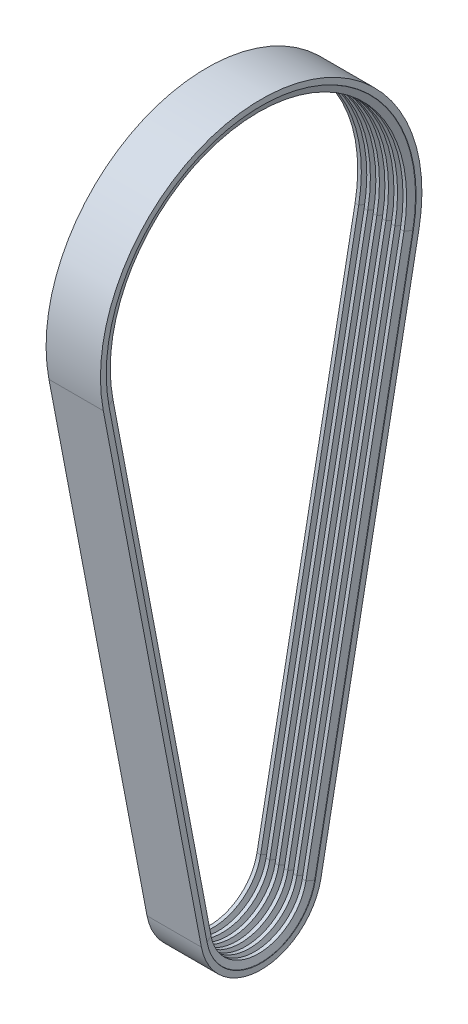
ISO-10303-21;
HEADER;
FILE_DESCRIPTION(('STEP AP214'),'2;1');
FILE_NAME('part.step','',(''),(''),'','','');
FILE_SCHEMA(('AUTOMOTIVE_DESIGN { 1 0 10303 214 1 1 1 1 }'));
ENDSEC;
DATA;
#1=APPLICATION_CONTEXT('core data for automotive mechanical design processes');
#2=APPLICATION_PROTOCOL_DEFINITION('international standard','automotive_design',2000,#1);
#3=PRODUCT_CONTEXT('',#1,'mechanical');
#4=PRODUCT('Part','Part','',(#3));
#5=PRODUCT_RELATED_PRODUCT_CATEGORY('part','',(#4));
#6=PRODUCT_DEFINITION_FORMATION('','',#4);
#7=PRODUCT_DEFINITION_CONTEXT('part definition',#1,'design');
#8=PRODUCT_DEFINITION('design','',#6,#7);
#9=PRODUCT_DEFINITION_SHAPE('','',#8);
#10=(LENGTH_UNIT() NAMED_UNIT(*) SI_UNIT(.MILLI.,.METRE.));
#11=(NAMED_UNIT(*) PLANE_ANGLE_UNIT() SI_UNIT($,.RADIAN.));
#12=(NAMED_UNIT(*) SI_UNIT($,.STERADIAN.) SOLID_ANGLE_UNIT());
#13=UNCERTAINTY_MEASURE_WITH_UNIT(LENGTH_MEASURE(1.E-05),#10,'distance_accuracy_value','');
#14=(GEOMETRIC_REPRESENTATION_CONTEXT(3) GLOBAL_UNCERTAINTY_ASSIGNED_CONTEXT((#13)) GLOBAL_UNIT_ASSIGNED_CONTEXT((#10,
#11,#12)) REPRESENTATION_CONTEXT('',''));
#15=CARTESIAN_POINT('',(0.,0.,0.));
#16=DIRECTION('',(0.,0.,1.));
#17=DIRECTION('',(1.,0.,0.));
#18=AXIS2_PLACEMENT_3D('',#15,#16,#17);
#19=CARTESIAN_POINT('',(11.5903346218,0.,0.));
#20=DIRECTION('',(1.,0.,0.));
#21=DIRECTION('',(0.,-0.187588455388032,0.982247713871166));
#22=AXIS2_PLACEMENT_3D('',#19,#20,#21);
#23=TOROIDAL_SURFACE('',#22,14.12,0.1);
#24=CARTESIAN_POINT('',(11.5903346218,-2.64874864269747,-13.8693377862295));
#25=DIRECTION('',(0.,-0.982247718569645,0.187588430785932));
#26=DIRECTION('',(0.,-0.187588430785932,-0.982247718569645));
#27=AXIS2_PLACEMENT_3D('',#24,#25,#26);
#28=CIRCLE('',#27,0.1);
#29=CARTESIAN_POINT('',(11.6843038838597,-2.65516454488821,-13.9029326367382));
#30=VERTEX_POINT('',#29);
#31=CARTESIAN_POINT('',(11.4963653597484,-2.6551645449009,-13.9029326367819));
#32=VERTEX_POINT('',#31);
#33=EDGE_CURVE('E386',#30,#32,#28,.F.);
#34=ORIENTED_EDGE('',*,*,#33,.T.);
#35=CARTESIAN_POINT('',(11.4963653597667,0.,0.));
#36=DIRECTION('',(1.,0.,0.));
#37=DIRECTION('',(0.,-0.187588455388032,0.982247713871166));
#38=AXIS2_PLACEMENT_3D('',#35,#36,#37);
#39=CIRCLE('',#38,14.1542020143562);
#40=CARTESIAN_POINT('',(11.496365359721,-2.65516489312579,13.9029325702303));
#41=VERTEX_POINT('',#40);
#42=EDGE_CURVE('E382',#32,#41,#39,.F.);
#43=ORIENTED_EDGE('',*,*,#42,.T.);
#44=CARTESIAN_POINT('',(11.5903346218,-2.64874899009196,13.8693377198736));
#45=DIRECTION('',(0.,0.982247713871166,0.187588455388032));
#46=DIRECTION('',(0.,-0.187588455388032,0.982247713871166));
#47=AXIS2_PLACEMENT_3D('',#44,#45,#46);
#48=CIRCLE('',#47,0.1);
#49=CARTESIAN_POINT('',(11.6843038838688,-2.65516489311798,13.9029325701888));
#50=VERTEX_POINT('',#49);
#51=EDGE_CURVE('E380',#41,#50,#48,.T.);
#52=ORIENTED_EDGE('',*,*,#51,.T.);
#53=CARTESIAN_POINT('',(11.6843038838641,0.,0.));
#54=DIRECTION('',(-1.,0.,0.));
#55=DIRECTION('',(0.,-0.187588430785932,-0.982247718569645));
#56=AXIS2_PLACEMENT_3D('',#53,#54,#55);
#57=CIRCLE('',#56,14.1542020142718);
#58=EDGE_CURVE('E377',#50,#30,#57,.F.);
#59=ORIENTED_EDGE('',*,*,#58,.T.);
#60=EDGE_LOOP('',(#34,#43,#52,#59));
#61=FACE_BOUND('',#60,.T.);
#62=ADVANCED_FACE('F16',(#61),#23,.F.);
#63=CARTESIAN_POINT('',(11.6843038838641,0.,0.));
#64=DIRECTION('',(-1.,0.,0.));
#65=DIRECTION('',(0.,-1.,0.));
#66=AXIS2_PLACEMENT_3D('',#63,#64,#65);
#67=CONICAL_SURFACE('',#66,14.1542020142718,1.2217304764);
#68=ORIENTED_EDGE('',*,*,#58,.F.);
#69=DIRECTION('',(-0.342020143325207,-0.176275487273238,0.923010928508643));
#70=VECTOR('',#69,1.);
#71=CARTESIAN_POINT('',(12.2936635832,-2.34110392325,12.2584514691));
#72=LINE('',#71,#70);
#73=CARTESIAN_POINT('',(12.2936635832,-2.34110392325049,12.2584514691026));
#74=VERTEX_POINT('',#73);
#75=EDGE_CURVE('E392',#74,#50,#72,.T.);
#76=ORIENTED_EDGE('',*,*,#75,.F.);
#77=CARTESIAN_POINT('',(12.2936635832,0.,0.));
#78=DIRECTION('',(1.,0.,0.));
#79=DIRECTION('',(0.,0.,-1.));
#80=AXIS2_PLACEMENT_3D('',#77,#78,#79);
#81=CIRCLE('',#80,12.48);
#82=CARTESIAN_POINT('',(12.2936635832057,-2.34110361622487,-12.2584515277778));
#83=VERTEX_POINT('',#82);
#84=EDGE_CURVE('E1701',#74,#83,#81,.T.);
#85=ORIENTED_EDGE('',*,*,#84,.T.);
#86=DIRECTION('',(0.342020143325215,0.176275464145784,0.923010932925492));
#87=VECTOR('',#86,1.);
#88=CARTESIAN_POINT('',(11.6843038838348,-2.65516454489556,-13.9029326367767));
#89=LINE('',#88,#87);
#90=EDGE_CURVE('E395',#30,#83,#89,.T.);
#91=ORIENTED_EDGE('',*,*,#90,.F.);
#92=EDGE_LOOP('',(#68,#76,#85,#91));
#93=FACE_BOUND('',#92,.T.);
#94=ADVANCED_FACE('F390',(#93),#67,.F.);
#95=CARTESIAN_POINT('',(11.5903346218,63.6732070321,-26.5354212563));
#96=DIRECTION('',(0.,-0.982247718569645,0.187588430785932));
#97=DIRECTION('',(0.,-0.187588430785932,-0.982247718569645));
#98=AXIS2_PLACEMENT_3D('',#95,#96,#97);
#99=CYLINDRICAL_SURFACE('',#98,0.1);
#100=DIRECTION('',(-3.73943656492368E-13,0.982247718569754,-0.187588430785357));
#101=VECTOR('',#100,1.);
#102=CARTESIAN_POINT('',(11.4963653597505,-2.65516454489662,-13.9029326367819));
#103=LINE('',#102,#101);
#104=CARTESIAN_POINT('',(11.4963653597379,129.988746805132,-39.2350995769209));
#105=VERTEX_POINT('',#104);
#106=EDGE_CURVE('E1275',#32,#105,#103,.T.);
#107=ORIENTED_EDGE('',*,*,#106,.F.);
#108=ORIENTED_EDGE('',*,*,#33,.F.);
#109=DIRECTION('',(-3.73905118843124E-13,-0.982247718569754,0.187588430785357));
#110=VECTOR('',#109,1.);
#111=CARTESIAN_POINT('',(11.6843038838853,129.988746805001,-39.2350995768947));
#112=LINE('',#111,#110);
#113=CARTESIAN_POINT('',(11.6843038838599,129.988746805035,-39.2350995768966));
#114=VERTEX_POINT('',#113);
#115=EDGE_CURVE('E406',#114,#30,#112,.T.);
#116=ORIENTED_EDGE('',*,*,#115,.F.);
#117=CARTESIAN_POINT('',(11.5903346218,129.995162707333,-39.2015047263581));
#118=DIRECTION('',(0.,0.982247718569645,-0.187588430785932));
#119=DIRECTION('',(0.,-0.187588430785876,-0.982247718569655));
#120=AXIS2_PLACEMENT_3D('',#117,#118,#119);
#121=CIRCLE('',#120,0.1);
#122=EDGE_CURVE('E1698',#114,#105,#121,.T.);
#123=ORIENTED_EDGE('',*,*,#122,.T.);
#124=EDGE_LOOP('',(#107,#108,#116,#123));
#125=FACE_BOUND('',#124,.T.);
#126=ADVANCED_FACE('F1317',(#125),#99,.F.);
#127=CARTESIAN_POINT('',(11.5903346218,63.6732063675,26.5354228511));
#128=DIRECTION('',(0.,0.982247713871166,0.187588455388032));
#129=DIRECTION('',(0.,-0.187588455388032,0.982247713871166));
#130=AXIS2_PLACEMENT_3D('',#127,#128,#129);
#131=CYLINDRICAL_SURFACE('',#130,0.1);
#132=DIRECTION('',(0.,-0.982247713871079,-0.187588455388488));
#133=VECTOR('',#132,1.);
#134=CARTESIAN_POINT('',(11.4963653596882,129.988745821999,39.2351028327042));
#135=LINE('',#134,#133);
#136=CARTESIAN_POINT('',(11.496365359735,129.988745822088,39.2351028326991));
#137=VERTEX_POINT('',#136);
#138=EDGE_CURVE('E1269',#137,#41,#135,.T.);
#139=ORIENTED_EDGE('',*,*,#138,.F.);
#140=CARTESIAN_POINT('',(11.5903346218,129.995161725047,39.2015079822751));
#141=DIRECTION('',(0.,-0.982247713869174,-0.187588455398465));
#142=DIRECTION('',(0.,-0.187588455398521,0.982247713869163));
#143=AXIS2_PLACEMENT_3D('',#140,#141,#142);
#144=CIRCLE('',#143,0.1);
#145=CARTESIAN_POINT('',(11.6843038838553,129.988745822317,39.2351028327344));
#146=VERTEX_POINT('',#145);
#147=EDGE_CURVE('E402',#137,#146,#144,.F.);
#148=ORIENTED_EDGE('',*,*,#147,.T.);
#149=DIRECTION('',(0.,0.982247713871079,0.187588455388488));
#150=VECTOR('',#149,1.);
#151=CARTESIAN_POINT('',(11.6843038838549,-2.65516489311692,13.9029325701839));
#152=LINE('',#151,#150);
#153=EDGE_CURVE('E399',#50,#146,#152,.T.);
#154=ORIENTED_EDGE('',*,*,#153,.F.);
#155=ORIENTED_EDGE('',*,*,#51,.F.);
#156=EDGE_LOOP('',(#139,#148,#154,#155));
#157=FACE_BOUND('',#156,.T.);
#158=ADVANCED_FACE('F400',(#157),#131,.F.);
#159=CARTESIAN_POINT('',(11.4963653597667,0.,0.));
#160=DIRECTION('',(1.,0.,0.));
#161=DIRECTION('',(0.,0.,-1.));
#162=AXIS2_PLACEMENT_3D('',#159,#160,#161);
#163=CONICAL_SURFACE('',#162,14.1542020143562,1.2217304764);
#164=CARTESIAN_POINT('',(10.8870056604,0.,0.));
#165=DIRECTION('',(1.,0.,0.));
#166=DIRECTION('',(0.,0.,-1.));
#167=AXIS2_PLACEMENT_3D('',#164,#165,#166);
#168=CIRCLE('',#167,12.48);
#169=CARTESIAN_POINT('',(10.8870056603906,-2.34110361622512,-12.2584515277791));
#170=VERTEX_POINT('',#169);
#171=CARTESIAN_POINT('',(10.8870056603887,-2.34110392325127,12.2584514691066));
#172=VERTEX_POINT('',#171);
#173=EDGE_CURVE('E1262',#170,#172,#168,.F.);
#174=ORIENTED_EDGE('',*,*,#173,.T.);
#175=DIRECTION('',(-0.342020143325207,0.176275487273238,-0.923010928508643));
#176=VECTOR('',#175,1.);
#177=CARTESIAN_POINT('',(11.4963653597,-2.65516489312,13.9029325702));
#178=LINE('',#177,#176);
#179=EDGE_CURVE('E1264',#41,#172,#178,.T.);
#180=ORIENTED_EDGE('',*,*,#179,.F.);
#181=ORIENTED_EDGE('',*,*,#42,.F.);
#182=DIRECTION('',(0.342020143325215,-0.176275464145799,-0.92301093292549));
#183=VECTOR('',#182,1.);
#184=CARTESIAN_POINT('',(10.8870056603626,-2.34110361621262,-12.2584515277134));
#185=LINE('',#184,#183);
#186=EDGE_CURVE('E1272',#170,#32,#185,.T.);
#187=ORIENTED_EDGE('',*,*,#186,.F.);
#188=EDGE_LOOP('',(#174,#180,#181,#187));
#189=FACE_BOUND('',#188,.T.);
#190=ADVANCED_FACE('F1311',(#189),#163,.F.);
#191=CARTESIAN_POINT('',(12.2936635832,-2.34110392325,12.2584514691));
#192=DIRECTION('',(-0.939692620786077,0.0641590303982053,-0.335948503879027));
#193=DIRECTION('',(-0.336642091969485,0.,0.941632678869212));
#194=AXIS2_PLACEMENT_3D('',#191,#192,#193);
#195=PLANE('',#194);
#196=ORIENTED_EDGE('',*,*,#153,.T.);
#197=DIRECTION('',(0.342020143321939,0.176275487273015,-0.923010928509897));
#198=VECTOR('',#197,1.);
#199=CARTESIAN_POINT('',(12.2936635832,130.3028067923,37.5906217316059));
#200=LINE('',#199,#198);
#201=CARTESIAN_POINT('',(12.2936635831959,130.302806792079,37.5906217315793));
#202=VERTEX_POINT('',#201);
#203=EDGE_CURVE('E425',#146,#202,#200,.T.);
#204=ORIENTED_EDGE('',*,*,#203,.T.);
#205=DIRECTION('',(0.,0.982247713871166,0.187588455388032));
#206=VECTOR('',#205,1.);
#207=CARTESIAN_POINT('',(12.2936635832,-2.34110392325,12.2584514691));
#208=LINE('',#207,#206);
#209=EDGE_CURVE('E411',#74,#202,#208,.T.);
#210=ORIENTED_EDGE('',*,*,#209,.F.);
#211=ORIENTED_EDGE('',*,*,#75,.T.);
#212=EDGE_LOOP('',(#196,#204,#210,#211));
#213=FACE_BOUND('',#212,.T.);
#214=ADVANCED_FACE('F409',(#213),#195,.T.);
#215=CARTESIAN_POINT('',(12.2936635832,130.302807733,-37.5906184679));
#216=DIRECTION('',(-0.939692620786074,0.064159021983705,0.335948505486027));
#217=DIRECTION('',(0.336642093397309,0.,0.941632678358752));
#218=AXIS2_PLACEMENT_3D('',#215,#216,#217);
#219=PLANE('',#218);
#220=ORIENTED_EDGE('',*,*,#115,.T.);
#221=ORIENTED_EDGE('',*,*,#90,.T.);
#222=DIRECTION('',(0.,-0.982247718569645,0.187588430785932));
#223=VECTOR('',#222,1.);
#224=CARTESIAN_POINT('',(12.2936635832,130.302807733,-37.5906184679));
#225=LINE('',#224,#223);
#226=CARTESIAN_POINT('',(12.2936635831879,130.302807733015,-37.5906184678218));
#227=VERTEX_POINT('',#226);
#228=EDGE_CURVE('E1223',#227,#83,#225,.T.);
#229=ORIENTED_EDGE('',*,*,#228,.F.);
#230=CARTESIAN_POINT('',(12.2936635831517,130.302807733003,-37.5906184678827));
#231=CARTESIAN_POINT('',(12.2682735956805,130.289721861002,-37.6591385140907));
#232=CARTESIAN_POINT('',(12.2428836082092,130.276635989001,-37.7276585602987));
#233=CARTESIAN_POINT('',(12.1921036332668,130.250464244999,-37.8646986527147));
#234=CARTESIAN_POINT('',(12.1667136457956,130.237378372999,-37.9332186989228));
#235=CARTESIAN_POINT('',(12.1159336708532,130.211206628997,-38.070258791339));
#236=CARTESIAN_POINT('',(12.090543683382,130.198120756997,-38.1387788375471));
#237=CARTESIAN_POINT('',(12.0397637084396,130.171949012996,-38.2758189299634));
#238=CARTESIAN_POINT('',(12.0143737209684,130.158863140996,-38.3443389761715));
#239=CARTESIAN_POINT('',(11.963593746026,130.132691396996,-38.4813790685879));
#240=CARTESIAN_POINT('',(11.9382037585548,130.119605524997,-38.5498991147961));
#241=CARTESIAN_POINT('',(11.8874237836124,130.093433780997,-38.6869392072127));
#242=CARTESIAN_POINT('',(11.8620337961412,130.080347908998,-38.755459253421));
#243=CARTESIAN_POINT('',(11.8112538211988,130.054176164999,-38.8924993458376));
#244=CARTESIAN_POINT('',(11.7858638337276,130.041090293,-38.9610193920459));
#245=CARTESIAN_POINT('',(11.7350838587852,130.014918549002,-39.0980594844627));
#246=CARTESIAN_POINT('',(11.709693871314,130.001832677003,-39.1665795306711));
#247=CARTESIAN_POINT('',(11.6843038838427,129.988746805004,-39.2350995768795));
#248=B_SPLINE_CURVE_WITH_KNOTS('',3,(#230,#231,#232,#233,#234,#235,#236,#237,#238,#239,#240,
#241,#242,#243,#244,#245,#246,#247),.UNSPECIFIED.,.F.,.F.,(4,2,2,2,2,2,2,2,4),(0.,
0.222706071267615,0.445412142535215,0.668118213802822,0.890824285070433,1.11353035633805,
1.33623642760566,1.55894249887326,1.78164857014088),.UNSPECIFIED.);
#249=EDGE_CURVE('E426',#227,#114,#248,.T.);
#250=ORIENTED_EDGE('',*,*,#249,.T.);
#251=EDGE_LOOP('',(#220,#221,#229,#250));
#252=FACE_BOUND('',#251,.T.);
#253=ADVANCED_FACE('F1304',(#252),#219,.T.);
#254=CARTESIAN_POINT('',(0.,0.,0.));
#255=DIRECTION('',(1.,0.,0.));
#256=DIRECTION('',(0.,0.,-1.));
#257=AXIS2_PLACEMENT_3D('',#254,#255,#256);
#258=CYLINDRICAL_SURFACE('',#257,12.48);
#259=ORIENTED_EDGE('',*,*,#84,.F.);
#260=DIRECTION('',(1.,0.,0.));
#261=VECTOR('',#260,1.);
#262=CARTESIAN_POINT('',(6.20700566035,-2.34110392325,12.2584514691));
#263=LINE('',#262,#261);
#264=CARTESIAN_POINT('',(13.2270056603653,-2.34110392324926,12.2584514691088));
#265=VERTEX_POINT('',#264);
#266=EDGE_CURVE('E1226',#265,#74,#263,.F.);
#267=ORIENTED_EDGE('',*,*,#266,.F.);
#268=CARTESIAN_POINT('',(13.2270056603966,0.,0.));
#269=DIRECTION('',(1.,0.,0.));
#270=DIRECTION('',(0.,-0.187588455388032,0.982247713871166));
#271=AXIS2_PLACEMENT_3D('',#268,#269,#270);
#272=CIRCLE('',#271,12.4799999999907);
#273=CARTESIAN_POINT('',(13.2270056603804,-2.34110361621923,-12.2584515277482));
#274=VERTEX_POINT('',#273);
#275=EDGE_CURVE('E1216',#265,#274,#272,.T.);
#276=ORIENTED_EDGE('',*,*,#275,.T.);
#277=DIRECTION('',(1.,0.,0.));
#278=VECTOR('',#277,1.);
#279=CARTESIAN_POINT('',(6.20700566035,-2.34110361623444,-12.2584515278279));
#280=LINE('',#279,#278);
#281=EDGE_CURVE('E1218',#83,#274,#280,.T.);
#282=ORIENTED_EDGE('',*,*,#281,.F.);
#283=EDGE_LOOP('',(#259,#267,#276,#282));
#284=FACE_BOUND('',#283,.T.);
#285=ADVANCED_FACE('F1299',(#284),#258,.F.);
#286=CARTESIAN_POINT('',(11.5903346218,137.48181698,1.72175637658E-06));
#287=DIRECTION('',(1.,0.,0.));
#288=DIRECTION('',(0.,-0.187588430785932,-0.982247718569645));
#289=AXIS2_PLACEMENT_3D('',#286,#287,#288);
#290=TOROIDAL_SURFACE('',#289,39.91,0.1);
#291=ORIENTED_EDGE('',*,*,#147,.F.);
#292=CARTESIAN_POINT('',(11.4963653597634,137.48181698,1.72175637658E-06));
#293=DIRECTION('',(1.,0.,0.));
#294=DIRECTION('',(0.,-0.187588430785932,-0.982247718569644));
#295=AXIS2_PLACEMENT_3D('',#292,#293,#294);
#296=CIRCLE('',#295,39.9442020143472);
#297=EDGE_CURVE('E1213',#137,#105,#296,.F.);
#298=ORIENTED_EDGE('',*,*,#297,.T.);
#299=ORIENTED_EDGE('',*,*,#122,.F.);
#300=CARTESIAN_POINT('',(11.6843038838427,137.48181698,1.72175637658E-06));
#301=DIRECTION('',(-1.,0.,0.));
#302=DIRECTION('',(0.,-0.187588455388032,0.982247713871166));
#303=AXIS2_PLACEMENT_3D('',#300,#301,#302);
#304=CIRCLE('',#303,39.9442020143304);
#305=EDGE_CURVE('E423',#114,#146,#304,.F.);
#306=ORIENTED_EDGE('',*,*,#305,.T.);
#307=EDGE_LOOP('',(#291,#298,#299,#306));
#308=FACE_BOUND('',#307,.T.);
#309=ADVANCED_FACE('F1294',(#308),#290,.F.);
#310=CARTESIAN_POINT('',(11.4963653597,129.988746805,-39.2350995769));
#311=DIRECTION('',(0.939692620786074,0.064159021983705,0.335948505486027));
#312=DIRECTION('',(0.336642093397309,0.,-0.941632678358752));
#313=AXIS2_PLACEMENT_3D('',#310,#311,#312);
#314=PLANE('',#313);
#315=DIRECTION('',(0.,-0.982247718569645,0.187588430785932));
#316=VECTOR('',#315,1.);
#317=CARTESIAN_POINT('',(10.8870056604,130.302807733,-37.5906184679));
#318=LINE('',#317,#316);
#319=CARTESIAN_POINT('',(10.8870056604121,130.302807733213,-37.5906184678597));
#320=VERTEX_POINT('',#319);
#321=EDGE_CURVE('E1190',#170,#320,#318,.F.);
#322=ORIENTED_EDGE('',*,*,#321,.F.);
#323=ORIENTED_EDGE('',*,*,#186,.T.);
#324=ORIENTED_EDGE('',*,*,#106,.T.);
#325=DIRECTION('',(-0.342020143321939,0.176275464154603,0.923010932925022));
#326=VECTOR('',#325,1.);
#327=CARTESIAN_POINT('',(10.8870056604,130.302807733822,-37.5906184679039));
#328=LINE('',#327,#326);
#329=EDGE_CURVE('E1209',#105,#320,#328,.T.);
#330=ORIENTED_EDGE('',*,*,#329,.T.);
#331=EDGE_LOOP('',(#322,#323,#324,#330));
#332=FACE_BOUND('',#331,.T.);
#333=ADVANCED_FACE('F1298',(#332),#314,.T.);
#334=CARTESIAN_POINT('',(11.4963653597,-2.65516489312,13.9029325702));
#335=DIRECTION('',(0.939692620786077,0.0641590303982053,-0.335948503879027));
#336=DIRECTION('',(-0.336642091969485,0.,-0.941632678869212));
#337=AXIS2_PLACEMENT_3D('',#334,#335,#336);
#338=PLANE('',#337);
#339=DIRECTION('',(0.,0.982247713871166,0.187588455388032));
#340=VECTOR('',#339,1.);
#341=CARTESIAN_POINT('',(10.8870056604,-2.34110392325,12.2584514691));
#342=LINE('',#341,#340);
#343=CARTESIAN_POINT('',(10.8870056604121,130.302806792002,37.5906217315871));
#344=VERTEX_POINT('',#343);
#345=EDGE_CURVE('E1184',#344,#172,#342,.F.);
#346=ORIENTED_EDGE('',*,*,#345,.F.);
#347=DIRECTION('',(-0.342020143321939,0.176275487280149,-0.923010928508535));
#348=VECTOR('',#347,1.);
#349=CARTESIAN_POINT('',(10.8870056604,130.302806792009,37.5906217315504));
#350=LINE('',#349,#348);
#351=EDGE_CURVE('E1204',#344,#137,#350,.F.);
#352=ORIENTED_EDGE('',*,*,#351,.T.);
#353=ORIENTED_EDGE('',*,*,#138,.T.);
#354=ORIENTED_EDGE('',*,*,#179,.T.);
#355=EDGE_LOOP('',(#346,#352,#353,#354));
#356=FACE_BOUND('',#355,.T.);
#357=ADVANCED_FACE('F1765',(#356),#338,.T.);
#358=CARTESIAN_POINT('',(0.,0.,0.));
#359=DIRECTION('',(1.,0.,0.));
#360=DIRECTION('',(0.,0.,-1.));
#361=AXIS2_PLACEMENT_3D('',#358,#359,#360);
#362=CYLINDRICAL_SURFACE('',#361,12.48);
#363=CARTESIAN_POINT('',(9.95366358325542,0.,0.));
#364=DIRECTION('',(-1.,0.,0.));
#365=DIRECTION('',(0.,-0.187588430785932,-0.982247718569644));
#366=AXIS2_PLACEMENT_3D('',#363,#364,#365);
#367=CIRCLE('',#366,12.4799999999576);
#368=CARTESIAN_POINT('',(9.95366358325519,-2.34110361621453,-12.2584515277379));
#369=VERTEX_POINT('',#368);
#370=CARTESIAN_POINT('',(9.95366358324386,-2.34110392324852,12.2584514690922));
#371=VERTEX_POINT('',#370);
#372=EDGE_CURVE('E1171',#369,#371,#367,.T.);
#373=ORIENTED_EDGE('',*,*,#372,.T.);
#374=DIRECTION('',(1.,0.,0.));
#375=VECTOR('',#374,1.);
#376=CARTESIAN_POINT('',(6.20700566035,-2.34110392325,12.2584514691));
#377=LINE('',#376,#375);
#378=EDGE_CURVE('E1179',#172,#371,#377,.F.);
#379=ORIENTED_EDGE('',*,*,#378,.F.);
#380=ORIENTED_EDGE('',*,*,#173,.F.);
#381=DIRECTION('',(1.,0.,0.));
#382=VECTOR('',#381,1.);
#383=CARTESIAN_POINT('',(6.20700566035,-2.34110361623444,-12.2584515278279));
#384=LINE('',#383,#382);
#385=EDGE_CURVE('E1187',#369,#170,#384,.T.);
#386=ORIENTED_EDGE('',*,*,#385,.F.);
#387=EDGE_LOOP('',(#373,#379,#380,#386));
#388=FACE_BOUND('',#387,.T.);
#389=ADVANCED_FACE('F1717',(#388),#362,.F.);
#390=CARTESIAN_POINT('',(11.6843038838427,137.48181698,1.72175637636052E-06));
#391=DIRECTION('',(-1.,0.,0.));
#392=DIRECTION('',(0.,0.,1.));
#393=AXIS2_PLACEMENT_3D('',#390,#391,#392);
#394=CONICAL_SURFACE('',#393,39.9442020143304,1.2217304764);
#395=ORIENTED_EDGE('',*,*,#305,.F.);
#396=ORIENTED_EDGE('',*,*,#249,.F.);
#397=CARTESIAN_POINT('',(12.2936635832,137.48181698,1.72175637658E-06));
#398=DIRECTION('',(1.,0.,0.));
#399=DIRECTION('',(0.,0.,-1.));
#400=AXIS2_PLACEMENT_3D('',#397,#398,#399);
#401=CIRCLE('',#400,38.27);
#402=EDGE_CURVE('E1165',#227,#202,#401,.T.);
#403=ORIENTED_EDGE('',*,*,#402,.T.);
#404=ORIENTED_EDGE('',*,*,#203,.F.);
#405=EDGE_LOOP('',(#395,#396,#403,#404));
#406=FACE_BOUND('',#405,.T.);
#407=ADVANCED_FACE('F1246',(#406),#394,.F.);
#408=CARTESIAN_POINT('',(6.20700566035,-2.34110392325,12.2584514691));
#409=DIRECTION('',(0.,0.187588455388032,-0.982247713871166));
#410=DIRECTION('',(0.,0.982247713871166,0.187588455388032));
#411=AXIS2_PLACEMENT_3D('',#408,#409,#410);
#412=PLANE('',#411);
#413=ORIENTED_EDGE('',*,*,#209,.T.);
#414=DIRECTION('',(1.,0.,0.));
#415=VECTOR('',#414,1.);
#416=CARTESIAN_POINT('',(0.,130.302806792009,37.5906217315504));
#417=LINE('',#416,#415);
#418=CARTESIAN_POINT('',(13.227005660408,130.302806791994,37.5906217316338));
#419=VERTEX_POINT('',#418);
#420=EDGE_CURVE('E1153',#202,#419,#417,.T.);
#421=ORIENTED_EDGE('',*,*,#420,.T.);
#422=DIRECTION('',(-1.45325475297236E-13,0.982247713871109,0.187588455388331));
#423=VECTOR('',#422,1.);
#424=CARTESIAN_POINT('',(13.2270056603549,-2.34110392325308,12.2584514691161));
#425=LINE('',#424,#423);
#426=EDGE_CURVE('E1152',#265,#419,#425,.T.);
#427=ORIENTED_EDGE('',*,*,#426,.F.);
#428=ORIENTED_EDGE('',*,*,#266,.T.);
#429=EDGE_LOOP('',(#413,#421,#427,#428));
#430=FACE_BOUND('',#429,.T.);
#431=ADVANCED_FACE('F1244',(#430),#412,.T.);
#432=CARTESIAN_POINT('',(6.20700566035,130.302807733,-37.5906184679));
#433=DIRECTION('',(0.,0.187588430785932,0.982247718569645));
#434=DIRECTION('',(0.,-0.982247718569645,0.187588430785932));
#435=AXIS2_PLACEMENT_3D('',#432,#433,#434);
#436=PLANE('',#435);
#437=ORIENTED_EDGE('',*,*,#228,.T.);
#438=ORIENTED_EDGE('',*,*,#281,.T.);
#439=DIRECTION('',(-1.67895691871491E-13,-0.982247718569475,0.187588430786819));
#440=VECTOR('',#439,1.);
#441=CARTESIAN_POINT('',(13.2270056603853,130.302807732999,-37.5906184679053));
#442=LINE('',#441,#440);
#443=CARTESIAN_POINT('',(13.2270056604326,130.302807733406,-37.5906184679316));
#444=VERTEX_POINT('',#443);
#445=EDGE_CURVE('E1142',#444,#274,#442,.T.);
#446=ORIENTED_EDGE('',*,*,#445,.F.);
#447=DIRECTION('',(1.,0.,0.));
#448=VECTOR('',#447,1.);
#449=CARTESIAN_POINT('',(0.,130.302807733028,-37.5906184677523));
#450=LINE('',#449,#448);
#451=EDGE_CURVE('E1168',#444,#227,#450,.F.);
#452=ORIENTED_EDGE('',*,*,#451,.T.);
#453=EDGE_LOOP('',(#437,#438,#446,#452));
#454=FACE_BOUND('',#453,.T.);
#455=ADVANCED_FACE('F1693',(#454),#436,.T.);
#456=CARTESIAN_POINT('',(13.8363653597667,0.,0.));
#457=DIRECTION('',(1.,0.,0.));
#458=DIRECTION('',(0.,0.,-1.));
#459=AXIS2_PLACEMENT_3D('',#456,#457,#458);
#460=CONICAL_SURFACE('',#459,14.1542020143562,1.2217304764);
#461=ORIENTED_EDGE('',*,*,#275,.F.);
#462=DIRECTION('',(-0.342020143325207,0.176275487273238,-0.923010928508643));
#463=VECTOR('',#462,1.);
#464=CARTESIAN_POINT('',(13.8363653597,-2.65516489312,13.9029325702));
#465=LINE('',#464,#463);
#466=CARTESIAN_POINT('',(13.8363653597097,-2.65516489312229,13.9029325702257));
#467=VERTEX_POINT('',#466);
#468=EDGE_CURVE('E1149',#467,#265,#465,.T.);
#469=ORIENTED_EDGE('',*,*,#468,.F.);
#470=CARTESIAN_POINT('',(13.8363653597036,0.,0.));
#471=DIRECTION('',(1.,0.,0.));
#472=DIRECTION('',(0.,-0.187588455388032,0.982247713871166));
#473=AXIS2_PLACEMENT_3D('',#470,#471,#472);
#474=CIRCLE('',#473,14.1542020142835);
#475=CARTESIAN_POINT('',(13.8363653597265,-2.65516454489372,-13.902932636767));
#476=VERTEX_POINT('',#475);
#477=EDGE_CURVE('E1141',#467,#476,#474,.T.);
#478=ORIENTED_EDGE('',*,*,#477,.T.);
#479=DIRECTION('',(0.342020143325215,-0.176275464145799,-0.92301093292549));
#480=VECTOR('',#479,1.);
#481=CARTESIAN_POINT('',(13.2270056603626,-2.34110361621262,-12.2584515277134));
#482=LINE('',#481,#480);
#483=EDGE_CURVE('E1138',#274,#476,#482,.T.);
#484=ORIENTED_EDGE('',*,*,#483,.F.);
#485=EDGE_LOOP('',(#461,#469,#478,#484));
#486=FACE_BOUND('',#485,.T.);
#487=ADVANCED_FACE('F1679',(#486),#460,.F.);
#488=CARTESIAN_POINT('',(11.4963653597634,137.48181698,1.72175637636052E-06));
#489=DIRECTION('',(1.,0.,0.));
#490=DIRECTION('',(0.,0.,-1.));
#491=AXIS2_PLACEMENT_3D('',#488,#489,#490);
#492=CONICAL_SURFACE('',#491,39.9442020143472,1.2217304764);
#493=CARTESIAN_POINT('',(10.8870056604,137.48181698,1.72175637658E-06));
#494=DIRECTION('',(1.,0.,0.));
#495=DIRECTION('',(0.,0.,-1.));
#496=AXIS2_PLACEMENT_3D('',#493,#494,#495);
#497=CIRCLE('',#496,38.27);
#498=EDGE_CURVE('E1146',#344,#320,#497,.F.);
#499=ORIENTED_EDGE('',*,*,#498,.T.);
#500=ORIENTED_EDGE('',*,*,#329,.F.);
#501=ORIENTED_EDGE('',*,*,#297,.F.);
#502=ORIENTED_EDGE('',*,*,#351,.F.);
#503=EDGE_LOOP('',(#499,#500,#501,#502));
#504=FACE_BOUND('',#503,.T.);
#505=ADVANCED_FACE('F1763',(#504),#492,.F.);
#506=CARTESIAN_POINT('',(6.20700566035,130.302807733,-37.5906184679));
#507=DIRECTION('',(0.,0.187588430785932,0.982247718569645));
#508=DIRECTION('',(0.,-0.982247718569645,0.187588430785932));
#509=AXIS2_PLACEMENT_3D('',#506,#507,#508);
#510=PLANE('',#509);
#511=DIRECTION('',(-1.67908537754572E-13,0.982247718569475,-0.187588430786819));
#512=VECTOR('',#511,1.);
#513=CARTESIAN_POINT('',(9.95366358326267,-2.34110361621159,-12.2584515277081));
#514=LINE('',#513,#512);
#515=CARTESIAN_POINT('',(9.95366358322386,130.302807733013,-37.5906184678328));
#516=VERTEX_POINT('',#515);
#517=EDGE_CURVE('E1721',#369,#516,#514,.T.);
#518=ORIENTED_EDGE('',*,*,#517,.F.);
#519=ORIENTED_EDGE('',*,*,#385,.T.);
#520=ORIENTED_EDGE('',*,*,#321,.T.);
#521=DIRECTION('',(1.,0.,0.));
#522=VECTOR('',#521,1.);
#523=CARTESIAN_POINT('',(0.,130.302807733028,-37.5906184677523));
#524=LINE('',#523,#522);
#525=EDGE_CURVE('E1199',#320,#516,#524,.F.);
#526=ORIENTED_EDGE('',*,*,#525,.T.);
#527=EDGE_LOOP('',(#518,#519,#520,#526));
#528=FACE_BOUND('',#527,.T.);
#529=ADVANCED_FACE('F1719',(#528),#510,.T.);
#530=CARTESIAN_POINT('',(6.20700566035,-2.34110392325,12.2584514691));
#531=DIRECTION('',(0.,0.187588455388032,-0.982247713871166));
#532=DIRECTION('',(0.,0.982247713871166,0.187588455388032));
#533=AXIS2_PLACEMENT_3D('',#530,#531,#532);
#534=PLANE('',#533);
#535=DIRECTION('',(-1.45312629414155E-13,-0.982247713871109,-0.187588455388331));
#536=VECTOR('',#535,1.);
#537=CARTESIAN_POINT('',(9.95366358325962,130.302806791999,37.590621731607));
#538=LINE('',#537,#536);
#539=CARTESIAN_POINT('',(9.95366358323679,130.302806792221,37.5906217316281));
#540=VERTEX_POINT('',#539);
#541=EDGE_CURVE('E1737',#540,#371,#538,.T.);
#542=ORIENTED_EDGE('',*,*,#541,.F.);
#543=DIRECTION('',(1.,0.,0.));
#544=VECTOR('',#543,1.);
#545=CARTESIAN_POINT('',(0.,130.302806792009,37.5906217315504));
#546=LINE('',#545,#544);
#547=EDGE_CURVE('E1727',#540,#344,#546,.T.);
#548=ORIENTED_EDGE('',*,*,#547,.T.);
#549=ORIENTED_EDGE('',*,*,#345,.T.);
#550=ORIENTED_EDGE('',*,*,#378,.T.);
#551=EDGE_LOOP('',(#542,#548,#549,#550));
#552=FACE_BOUND('',#551,.T.);
#553=ADVANCED_FACE('F1759',(#552),#534,.T.);
#554=CARTESIAN_POINT('',(9.34430388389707,0.,0.));
#555=DIRECTION('',(-1.,0.,0.));
#556=DIRECTION('',(0.,0.,1.));
#557=AXIS2_PLACEMENT_3D('',#554,#555,#556);
#558=CONICAL_SURFACE('',#557,14.154202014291,1.2217304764);
#559=CARTESIAN_POINT('',(9.34430388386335,0.,0.));
#560=DIRECTION('',(1.,0.,0.));
#561=DIRECTION('',(0.,-0.187588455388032,0.982247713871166));
#562=AXIS2_PLACEMENT_3D('',#559,#560,#561);
#563=CIRCLE('',#562,14.1542020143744);
#564=CARTESIAN_POINT('',(9.34430388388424,-2.65516454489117,-13.9029326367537));
#565=VERTEX_POINT('',#564);
#566=CARTESIAN_POINT('',(9.34430388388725,-2.65516489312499,13.9029325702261));
#567=VERTEX_POINT('',#566);
#568=EDGE_CURVE('E1097',#565,#567,#563,.F.);
#569=ORIENTED_EDGE('',*,*,#568,.T.);
#570=DIRECTION('',(-0.342020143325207,-0.176275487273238,0.923010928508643));
#571=VECTOR('',#570,1.);
#572=CARTESIAN_POINT('',(9.95366358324,-2.34110392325,12.2584514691));
#573=LINE('',#572,#571);
#574=EDGE_CURVE('E1734',#371,#567,#573,.T.);
#575=ORIENTED_EDGE('',*,*,#574,.F.);
#576=ORIENTED_EDGE('',*,*,#372,.F.);
#577=DIRECTION('',(0.342020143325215,0.176275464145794,0.923010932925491));
#578=VECTOR('',#577,1.);
#579=CARTESIAN_POINT('',(9.34430388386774,-2.6551645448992,-13.9029326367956));
#580=LINE('',#579,#578);
#581=EDGE_CURVE('E1726',#565,#369,#580,.T.);
#582=ORIENTED_EDGE('',*,*,#581,.F.);
#583=EDGE_LOOP('',(#569,#575,#576,#582));
#584=FACE_BOUND('',#583,.T.);
#585=ADVANCED_FACE('F1731',(#584),#558,.F.);
#586=CARTESIAN_POINT('',(0.,137.48181698,1.72175637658E-06));
#587=DIRECTION('',(1.,0.,0.));
#588=DIRECTION('',(0.,0.,-1.));
#589=AXIS2_PLACEMENT_3D('',#586,#587,#588);
#590=CYLINDRICAL_SURFACE('',#589,38.27);
#591=ORIENTED_EDGE('',*,*,#402,.F.);
#592=ORIENTED_EDGE('',*,*,#451,.F.);
#593=CARTESIAN_POINT('',(13.2270056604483,137.48181698,1.72175637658E-06));
#594=DIRECTION('',(1.,0.,0.));
#595=DIRECTION('',(0.,-0.187588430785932,-0.982247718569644));
#596=AXIS2_PLACEMENT_3D('',#593,#594,#595);
#597=CIRCLE('',#596,38.2700000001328);
#598=EDGE_CURVE('E1091',#444,#419,#597,.T.);
#599=ORIENTED_EDGE('',*,*,#598,.T.);
#600=ORIENTED_EDGE('',*,*,#420,.F.);
#601=EDGE_LOOP('',(#591,#592,#599,#600));
#602=FACE_BOUND('',#601,.T.);
#603=ADVANCED_FACE('F1690',(#602),#590,.F.);
#604=CARTESIAN_POINT('',(13.8363653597,-2.65516489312,13.9029325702));
#605=DIRECTION('',(0.939692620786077,0.0641590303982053,-0.335948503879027));
#606=DIRECTION('',(-0.336642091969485,0.,-0.941632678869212));
#607=AXIS2_PLACEMENT_3D('',#604,#605,#606);
#608=PLANE('',#607);
#609=ORIENTED_EDGE('',*,*,#426,.T.);
#610=DIRECTION('',(-0.342020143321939,0.176275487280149,-0.923010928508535));
#611=VECTOR('',#610,1.);
#612=CARTESIAN_POINT('',(13.2270056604,130.302806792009,37.5906217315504));
#613=LINE('',#612,#611);
#614=CARTESIAN_POINT('',(13.8363653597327,129.988745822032,39.2351028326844));
#615=VERTEX_POINT('',#614);
#616=EDGE_CURVE('E1083',#419,#615,#613,.F.);
#617=ORIENTED_EDGE('',*,*,#616,.T.);
#618=DIRECTION('',(0.,0.982247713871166,0.187588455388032));
#619=VECTOR('',#618,1.);
#620=CARTESIAN_POINT('',(13.8363653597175,63.6667904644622,26.5690177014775));
#621=LINE('',#620,#619);
#622=EDGE_CURVE('E1078',#615,#467,#621,.F.);
#623=ORIENTED_EDGE('',*,*,#622,.T.);
#624=ORIENTED_EDGE('',*,*,#468,.T.);
#625=EDGE_LOOP('',(#609,#617,#623,#624));
#626=FACE_BOUND('',#625,.T.);
#627=ADVANCED_FACE('F1672',(#626),#608,.T.);
#628=CARTESIAN_POINT('',(13.8363653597,129.988746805,-39.2350995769));
#629=DIRECTION('',(0.939692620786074,0.064159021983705,0.335948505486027));
#630=DIRECTION('',(0.336642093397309,0.,-0.941632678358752));
#631=AXIS2_PLACEMENT_3D('',#628,#629,#630);
#632=PLANE('',#631);
#633=ORIENTED_EDGE('',*,*,#445,.T.);
#634=ORIENTED_EDGE('',*,*,#483,.T.);
#635=DIRECTION('',(0.,-0.982247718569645,0.187588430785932));
#636=VECTOR('',#635,1.);
#637=CARTESIAN_POINT('',(13.836365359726,63.6667911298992,-26.5690161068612));
#638=LINE('',#637,#636);
#639=CARTESIAN_POINT('',(13.8363653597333,129.988746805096,-39.2350995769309));
#640=VERTEX_POINT('',#639);
#641=EDGE_CURVE('E1068',#476,#640,#638,.F.);
#642=ORIENTED_EDGE('',*,*,#641,.T.);
#643=DIRECTION('',(-0.342020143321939,0.176275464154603,0.923010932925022));
#644=VECTOR('',#643,1.);
#645=CARTESIAN_POINT('',(13.2270056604,130.302807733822,-37.5906184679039));
#646=LINE('',#645,#644);
#647=EDGE_CURVE('E1094',#640,#444,#646,.T.);
#648=ORIENTED_EDGE('',*,*,#647,.T.);
#649=EDGE_LOOP('',(#633,#634,#642,#648));
#650=FACE_BOUND('',#649,.T.);
#651=ADVANCED_FACE('F1130',(#650),#632,.T.);
#652=CARTESIAN_POINT('',(13.9303346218,0.,0.));
#653=DIRECTION('',(1.,0.,0.));
#654=DIRECTION('',(0.,-0.187588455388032,0.982247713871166));
#655=AXIS2_PLACEMENT_3D('',#652,#653,#654);
#656=TOROIDAL_SURFACE('',#655,14.12,0.1);
#657=CARTESIAN_POINT('',(13.9303346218,-2.64874864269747,-13.8693377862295));
#658=DIRECTION('',(0.,-0.982247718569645,0.187588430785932));
#659=DIRECTION('',(0.,-0.187588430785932,-0.982247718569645));
#660=AXIS2_PLACEMENT_3D('',#657,#658,#659);
#661=CIRCLE('',#660,0.1);
#662=CARTESIAN_POINT('',(14.0243038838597,-2.65516454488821,-13.9029326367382));
#663=VERTEX_POINT('',#662);
#664=EDGE_CURVE('E1071',#663,#476,#661,.F.);
#665=ORIENTED_EDGE('',*,*,#664,.T.);
#666=ORIENTED_EDGE('',*,*,#477,.F.);
#667=CARTESIAN_POINT('',(13.9303346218,-2.64874899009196,13.8693377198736));
#668=DIRECTION('',(0.,0.982247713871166,0.187588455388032));
#669=DIRECTION('',(0.,-0.187588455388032,0.982247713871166));
#670=AXIS2_PLACEMENT_3D('',#667,#668,#669);
#671=CIRCLE('',#670,0.1);
#672=CARTESIAN_POINT('',(14.0243038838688,-2.65516489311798,13.9029325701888));
#673=VERTEX_POINT('',#672);
#674=EDGE_CURVE('E1074',#467,#673,#671,.T.);
#675=ORIENTED_EDGE('',*,*,#674,.T.);
#676=CARTESIAN_POINT('',(14.0243038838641,0.,0.));
#677=DIRECTION('',(-1.,0.,0.));
#678=DIRECTION('',(0.,-0.187588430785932,-0.982247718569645));
#679=AXIS2_PLACEMENT_3D('',#676,#677,#678);
#680=CIRCLE('',#679,14.1542020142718);
#681=EDGE_CURVE('E1060',#673,#663,#680,.F.);
#682=ORIENTED_EDGE('',*,*,#681,.T.);
#683=EDGE_LOOP('',(#665,#666,#675,#682));
#684=FACE_BOUND('',#683,.T.);
#685=ADVANCED_FACE('F1125',(#684),#656,.F.);
#686=CARTESIAN_POINT('',(0.,137.48181698,1.72175637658E-06));
#687=DIRECTION('',(1.,0.,0.));
#688=DIRECTION('',(0.,0.,-1.));
#689=AXIS2_PLACEMENT_3D('',#686,#687,#688);
#690=CYLINDRICAL_SURFACE('',#689,38.27);
#691=CARTESIAN_POINT('',(9.95366358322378,137.48181698,1.72175637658E-06));
#692=DIRECTION('',(-1.,0.,0.));
#693=DIRECTION('',(0.,-0.187588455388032,0.982247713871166));
#694=AXIS2_PLACEMENT_3D('',#691,#692,#693);
#695=CIRCLE('',#694,38.2700000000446);
#696=EDGE_CURVE('E1067',#540,#516,#695,.T.);
#697=ORIENTED_EDGE('',*,*,#696,.T.);
#698=ORIENTED_EDGE('',*,*,#525,.F.);
#699=ORIENTED_EDGE('',*,*,#498,.F.);
#700=ORIENTED_EDGE('',*,*,#547,.F.);
#701=EDGE_LOOP('',(#697,#698,#699,#700));
#702=FACE_BOUND('',#701,.T.);
#703=ADVANCED_FACE('F1121',(#702),#690,.F.);
#704=CARTESIAN_POINT('',(9.95366358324,130.302807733,-37.5906184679));
#705=DIRECTION('',(-0.939692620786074,0.064159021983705,0.335948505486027));
#706=DIRECTION('',(0.336642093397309,0.,0.941632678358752));
#707=AXIS2_PLACEMENT_3D('',#704,#705,#706);
#708=PLANE('',#707);
#709=DIRECTION('',(0.,-0.982247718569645,0.187588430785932));
#710=VECTOR('',#709,1.);
#711=CARTESIAN_POINT('',(9.34430388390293,63.6667911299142,-26.569016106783));
#712=LINE('',#711,#710);
#713=CARTESIAN_POINT('',(9.34430388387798,129.988746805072,-39.2350995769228));
#714=VERTEX_POINT('',#713);
#715=EDGE_CURVE('E1040',#714,#565,#712,.T.);
#716=ORIENTED_EDGE('',*,*,#715,.T.);
#717=ORIENTED_EDGE('',*,*,#581,.T.);
#718=ORIENTED_EDGE('',*,*,#517,.T.);
#719=CARTESIAN_POINT('',(9.95366358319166,130.302807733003,-37.5906184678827));
#720=CARTESIAN_POINT('',(9.92827359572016,130.289721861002,-37.6591385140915));
#721=CARTESIAN_POINT('',(9.90288360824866,130.276635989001,-37.7276585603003));
#722=CARTESIAN_POINT('',(9.85210363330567,130.250464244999,-37.8646986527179));
#723=CARTESIAN_POINT('',(9.82671364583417,130.237378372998,-37.9332186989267));
#724=CARTESIAN_POINT('',(9.77593367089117,130.211206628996,-38.0702587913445));
#725=CARTESIAN_POINT('',(9.75054368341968,130.198120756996,-38.1387788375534));
#726=CARTESIAN_POINT('',(9.69976370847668,130.171949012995,-38.2758189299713));
#727=CARTESIAN_POINT('',(9.67437372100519,130.158863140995,-38.3443389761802));
#728=CARTESIAN_POINT('',(9.62359374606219,130.132691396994,-38.4813790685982));
#729=CARTESIAN_POINT('',(9.5982037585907,130.119605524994,-38.5498991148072));
#730=CARTESIAN_POINT('',(9.5474237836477,130.093433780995,-38.6869392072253));
#731=CARTESIAN_POINT('',(9.5220337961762,130.080347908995,-38.7554592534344));
#732=CARTESIAN_POINT('',(9.47125382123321,130.054176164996,-38.8924993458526));
#733=CARTESIAN_POINT('',(9.44586383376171,130.041090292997,-38.9610193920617));
#734=CARTESIAN_POINT('',(9.39508385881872,130.014918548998,-39.0980594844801));
#735=CARTESIAN_POINT('',(9.36969387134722,130.001832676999,-39.1665795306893));
#736=CARTESIAN_POINT('',(9.34430388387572,129.988746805,-39.2350995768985));
#737=B_SPLINE_CURVE_WITH_KNOTS('',3,(#719,#720,#721,#722,#723,#724,#725,#726,#727,#728,#729,
#730,#731,#732,#733,#734,#735,#736),.UNSPECIFIED.,.F.,.F.,(4,2,2,2,2,2,2,2,4),(0.,
0.222706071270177,0.445412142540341,0.668118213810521,0.890824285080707,1.11353035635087,
1.33623642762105,1.55894249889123,1.78164857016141),.UNSPECIFIED.);
#738=EDGE_CURVE('E1058',#516,#714,#737,.T.);
#739=ORIENTED_EDGE('',*,*,#738,.T.);
#740=EDGE_LOOP('',(#716,#717,#718,#739));
#741=FACE_BOUND('',#740,.T.);
#742=ADVANCED_FACE('F1117',(#741),#708,.T.);
#743=CARTESIAN_POINT('',(9.95366358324,-2.34110392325,12.2584514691));
#744=DIRECTION('',(-0.939692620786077,0.0641590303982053,-0.335948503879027));
#745=DIRECTION('',(-0.336642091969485,0.,0.941632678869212));
#746=AXIS2_PLACEMENT_3D('',#743,#744,#745);
#747=PLANE('',#746);
#748=DIRECTION('',(0.,0.982247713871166,0.187588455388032));
#749=VECTOR('',#748,1.);
#750=CARTESIAN_POINT('',(9.34430388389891,63.6667904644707,26.5690177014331));
#751=LINE('',#750,#749);
#752=CARTESIAN_POINT('',(9.34430388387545,129.988745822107,39.2351028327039));
#753=VERTEX_POINT('',#752);
#754=EDGE_CURVE('E1035',#567,#753,#751,.T.);
#755=ORIENTED_EDGE('',*,*,#754,.T.);
#756=DIRECTION('',(0.342020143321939,0.176275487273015,-0.923010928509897));
#757=VECTOR('',#756,1.);
#758=CARTESIAN_POINT('',(9.95366358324,130.3028067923,37.5906217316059));
#759=LINE('',#758,#757);
#760=EDGE_CURVE('E2638',#753,#540,#759,.T.);
#761=ORIENTED_EDGE('',*,*,#760,.T.);
#762=ORIENTED_EDGE('',*,*,#541,.T.);
#763=ORIENTED_EDGE('',*,*,#574,.T.);
#764=EDGE_LOOP('',(#755,#761,#762,#763));
#765=FACE_BOUND('',#764,.T.);
#766=ADVANCED_FACE('F1112',(#765),#747,.T.);
#767=CARTESIAN_POINT('',(9.2503346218,0.,0.));
#768=DIRECTION('',(1.,0.,0.));
#769=DIRECTION('',(0.,-0.187588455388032,0.982247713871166));
#770=AXIS2_PLACEMENT_3D('',#767,#768,#769);
#771=TOROIDAL_SURFACE('',#770,14.12,0.1);
#772=CARTESIAN_POINT('',(9.2503346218,-2.64874864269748,-13.8693377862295));
#773=DIRECTION('',(0.,-0.982247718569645,0.187588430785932));
#774=DIRECTION('',(0.,-0.187588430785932,-0.982247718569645));
#775=AXIS2_PLACEMENT_3D('',#772,#773,#774);
#776=CIRCLE('',#775,0.1);
#777=CARTESIAN_POINT('',(9.15636535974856,-2.65516454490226,-13.902932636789));
#778=VERTEX_POINT('',#777);
#779=EDGE_CURVE('E1038',#565,#778,#776,.F.);
#780=ORIENTED_EDGE('',*,*,#779,.T.);
#781=CARTESIAN_POINT('',(9.15636535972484,0.,0.));
#782=DIRECTION('',(1.,0.,0.));
#783=DIRECTION('',(0.,-0.187588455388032,0.982247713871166));
#784=AXIS2_PLACEMENT_3D('',#781,#782,#783);
#785=CIRCLE('',#784,14.1542020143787);
#786=CARTESIAN_POINT('',(9.15636535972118,-2.65516489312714,13.9029325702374));
#787=VERTEX_POINT('',#786);
#788=EDGE_CURVE('E1019',#778,#787,#785,.F.);
#789=ORIENTED_EDGE('',*,*,#788,.T.);
#790=CARTESIAN_POINT('',(9.2503346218,-2.64874899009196,13.8693377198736));
#791=DIRECTION('',(0.,0.982247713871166,0.187588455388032));
#792=DIRECTION('',(0.,-0.187588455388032,0.982247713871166));
#793=AXIS2_PLACEMENT_3D('',#790,#791,#792);
#794=CIRCLE('',#793,0.1);
#795=EDGE_CURVE('E1030',#787,#567,#794,.T.);
#796=ORIENTED_EDGE('',*,*,#795,.T.);
#797=ORIENTED_EDGE('',*,*,#568,.F.);
#798=EDGE_LOOP('',(#780,#789,#796,#797));
#799=FACE_BOUND('',#798,.T.);
#800=ADVANCED_FACE('F1107',(#799),#771,.F.);
#801=CARTESIAN_POINT('',(13.8363653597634,137.48181698,1.72175637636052E-06));
#802=DIRECTION('',(1.,0.,0.));
#803=DIRECTION('',(0.,0.,-1.));
#804=AXIS2_PLACEMENT_3D('',#801,#802,#803);
#805=CONICAL_SURFACE('',#804,39.9442020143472,1.2217304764);
#806=ORIENTED_EDGE('',*,*,#598,.F.);
#807=ORIENTED_EDGE('',*,*,#647,.F.);
#808=CARTESIAN_POINT('',(13.8363653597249,137.48181698,1.72175637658E-06));
#809=DIRECTION('',(1.,0.,0.));
#810=DIRECTION('',(0.,-0.187588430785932,-0.982247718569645));
#811=AXIS2_PLACEMENT_3D('',#808,#809,#810);
#812=CIRCLE('',#811,39.9442020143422);
#813=EDGE_CURVE('E1013',#640,#615,#812,.T.);
#814=ORIENTED_EDGE('',*,*,#813,.T.);
#815=ORIENTED_EDGE('',*,*,#616,.F.);
#816=EDGE_LOOP('',(#806,#807,#814,#815));
#817=FACE_BOUND('',#816,.T.);
#818=ADVANCED_FACE('F1111',(#817),#805,.F.);
#819=CARTESIAN_POINT('',(13.9303346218,63.6732063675,26.5354228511));
#820=DIRECTION('',(0.,0.982247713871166,0.187588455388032));
#821=DIRECTION('',(0.,-0.187588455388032,0.982247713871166));
#822=AXIS2_PLACEMENT_3D('',#819,#820,#821);
#823=CYLINDRICAL_SURFACE('',#822,0.1);
#824=ORIENTED_EDGE('',*,*,#622,.F.);
#825=CARTESIAN_POINT('',(13.9303346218,129.995161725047,39.2015079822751));
#826=DIRECTION('',(0.,-0.982247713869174,-0.187588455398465));
#827=DIRECTION('',(0.,-0.187588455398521,0.982247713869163));
#828=AXIS2_PLACEMENT_3D('',#825,#826,#827);
#829=CIRCLE('',#828,0.1);
#830=CARTESIAN_POINT('',(14.0243038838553,129.988745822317,39.2351028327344));
#831=VERTEX_POINT('',#830);
#832=EDGE_CURVE('E1010',#615,#831,#829,.F.);
#833=ORIENTED_EDGE('',*,*,#832,.T.);
#834=DIRECTION('',(0.,0.982247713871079,0.187588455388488));
#835=VECTOR('',#834,1.);
#836=CARTESIAN_POINT('',(14.0243038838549,-2.65516489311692,13.9029325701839));
#837=LINE('',#836,#835);
#838=EDGE_CURVE('E1026',#673,#831,#837,.T.);
#839=ORIENTED_EDGE('',*,*,#838,.F.);
#840=ORIENTED_EDGE('',*,*,#674,.F.);
#841=EDGE_LOOP('',(#824,#833,#839,#840));
#842=FACE_BOUND('',#841,.T.);
#843=ADVANCED_FACE('F1669',(#842),#823,.F.);
#844=CARTESIAN_POINT('',(13.9303346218,63.6732070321,-26.5354212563));
#845=DIRECTION('',(0.,-0.982247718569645,0.187588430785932));
#846=DIRECTION('',(0.,-0.187588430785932,-0.982247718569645));
#847=AXIS2_PLACEMENT_3D('',#844,#845,#846);
#848=CYLINDRICAL_SURFACE('',#847,0.1);
#849=ORIENTED_EDGE('',*,*,#641,.F.);
#850=ORIENTED_EDGE('',*,*,#664,.F.);
#851=DIRECTION('',(-3.73917964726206E-13,-0.982247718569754,0.187588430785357));
#852=VECTOR('',#851,1.);
#853=CARTESIAN_POINT('',(14.0243038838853,129.988746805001,-39.2350995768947));
#854=LINE('',#853,#852);
#855=CARTESIAN_POINT('',(14.0243038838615,129.988746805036,-39.2350995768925));
#856=VERTEX_POINT('',#855);
#857=EDGE_CURVE('E1022',#856,#663,#854,.T.);
#858=ORIENTED_EDGE('',*,*,#857,.F.);
#859=CARTESIAN_POINT('',(13.9303346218,129.995162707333,-39.2015047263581));
#860=DIRECTION('',(0.,0.982247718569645,-0.187588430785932));
#861=DIRECTION('',(0.,-0.187588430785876,-0.982247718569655));
#862=AXIS2_PLACEMENT_3D('',#859,#860,#861);
#863=CIRCLE('',#862,0.1);
#864=EDGE_CURVE('E1016',#856,#640,#863,.T.);
#865=ORIENTED_EDGE('',*,*,#864,.T.);
#866=EDGE_LOOP('',(#849,#850,#858,#865));
#867=FACE_BOUND('',#866,.T.);
#868=ADVANCED_FACE('F1958',(#867),#848,.F.);
#869=CARTESIAN_POINT('',(14.0243038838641,0.,0.));
#870=DIRECTION('',(-1.,0.,0.));
#871=DIRECTION('',(0.,0.,1.));
#872=AXIS2_PLACEMENT_3D('',#869,#870,#871);
#873=CONICAL_SURFACE('',#872,14.1542020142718,1.2217304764);
#874=ORIENTED_EDGE('',*,*,#681,.F.);
#875=DIRECTION('',(-0.342020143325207,-0.176275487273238,0.923010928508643));
#876=VECTOR('',#875,1.);
#877=CARTESIAN_POINT('',(14.6336635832,-2.34110392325,12.2584514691));
#878=LINE('',#877,#876);
#879=CARTESIAN_POINT('',(14.6336635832,-2.34110392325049,12.2584514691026));
#880=VERTEX_POINT('',#879);
#881=EDGE_CURVE('E1012',#880,#673,#878,.T.);
#882=ORIENTED_EDGE('',*,*,#881,.F.);
#883=CARTESIAN_POINT('',(14.6336635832,0.,0.));
#884=DIRECTION('',(1.,0.,0.));
#885=DIRECTION('',(0.,0.,-1.));
#886=AXIS2_PLACEMENT_3D('',#883,#884,#885);
#887=CIRCLE('',#886,12.48);
#888=CARTESIAN_POINT('',(14.6336635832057,-2.34110361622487,-12.2584515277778));
#889=VERTEX_POINT('',#888);
#890=EDGE_CURVE('E1627',#880,#889,#887,.T.);
#891=ORIENTED_EDGE('',*,*,#890,.T.);
#892=DIRECTION('',(0.342020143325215,0.176275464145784,0.923010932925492));
#893=VECTOR('',#892,1.);
#894=CARTESIAN_POINT('',(14.0243038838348,-2.65516454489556,-13.9029326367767));
#895=LINE('',#894,#893);
#896=EDGE_CURVE('E1025',#663,#889,#895,.T.);
#897=ORIENTED_EDGE('',*,*,#896,.F.);
#898=EDGE_LOOP('',(#874,#882,#891,#897));
#899=FACE_BOUND('',#898,.T.);
#900=ADVANCED_FACE('F1965',(#899),#873,.F.);
#901=CARTESIAN_POINT('',(9.34430388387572,137.48181698,1.72175637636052E-06));
#902=DIRECTION('',(-1.,0.,0.));
#903=DIRECTION('',(0.,0.,1.));
#904=AXIS2_PLACEMENT_3D('',#901,#902,#903);
#905=CONICAL_SURFACE('',#904,39.9442020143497,1.2217304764);
#906=CARTESIAN_POINT('',(9.34430388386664,137.48181698,1.72175637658E-06));
#907=DIRECTION('',(1.,0.,0.));
#908=DIRECTION('',(0.,-0.187588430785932,-0.982247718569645));
#909=AXIS2_PLACEMENT_3D('',#906,#907,#908);
#910=CIRCLE('',#909,39.9442020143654);
#911=EDGE_CURVE('E971',#753,#714,#910,.F.);
#912=ORIENTED_EDGE('',*,*,#911,.T.);
#913=ORIENTED_EDGE('',*,*,#738,.F.);
#914=ORIENTED_EDGE('',*,*,#696,.F.);
#915=ORIENTED_EDGE('',*,*,#760,.F.);
#916=EDGE_LOOP('',(#912,#913,#914,#915));
#917=FACE_BOUND('',#916,.T.);
#918=ADVANCED_FACE('F1051',(#917),#905,.F.);
#919=CARTESIAN_POINT('',(9.2503346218,63.6732070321,-26.5354212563));
#920=DIRECTION('',(0.,-0.982247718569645,0.187588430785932));
#921=DIRECTION('',(0.,-0.187588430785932,-0.982247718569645));
#922=AXIS2_PLACEMENT_3D('',#919,#920,#921);
#923=CYLINDRICAL_SURFACE('',#922,0.1);
#924=DIRECTION('',(-3.73943656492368E-13,0.982247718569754,-0.187588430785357));
#925=VECTOR('',#924,1.);
#926=CARTESIAN_POINT('',(9.1563653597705,-2.65516454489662,-13.9029326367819));
#927=LINE('',#926,#925);
#928=CARTESIAN_POINT('',(9.15636535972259,129.98874680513,-39.2350995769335));
#929=VERTEX_POINT('',#928);
#930=EDGE_CURVE('E958',#778,#929,#927,.T.);
#931=ORIENTED_EDGE('',*,*,#930,.F.);
#932=ORIENTED_EDGE('',*,*,#779,.F.);
#933=ORIENTED_EDGE('',*,*,#715,.F.);
#934=CARTESIAN_POINT('',(9.2503346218,129.995162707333,-39.2015047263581));
#935=DIRECTION('',(0.,0.982247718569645,-0.187588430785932));
#936=DIRECTION('',(0.,-0.187588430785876,-0.982247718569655));
#937=AXIS2_PLACEMENT_3D('',#934,#935,#936);
#938=CIRCLE('',#937,0.1);
#939=EDGE_CURVE('E1625',#714,#929,#938,.T.);
#940=ORIENTED_EDGE('',*,*,#939,.T.);
#941=EDGE_LOOP('',(#931,#932,#933,#940));
#942=FACE_BOUND('',#941,.T.);
#943=ADVANCED_FACE('F1050',(#942),#923,.F.);
#944=CARTESIAN_POINT('',(9.2503346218,63.6732063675,26.5354228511));
#945=DIRECTION('',(0.,0.982247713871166,0.187588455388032));
#946=DIRECTION('',(0.,-0.187588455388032,0.982247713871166));
#947=AXIS2_PLACEMENT_3D('',#944,#945,#946);
#948=CYLINDRICAL_SURFACE('',#947,0.1);
#949=DIRECTION('',(0.,-0.982247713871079,-0.187588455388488));
#950=VECTOR('',#949,1.);
#951=CARTESIAN_POINT('',(9.15636535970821,129.988745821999,39.2351028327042));
#952=LINE('',#951,#950);
#953=CARTESIAN_POINT('',(9.15636535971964,129.988745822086,39.2351028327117));
#954=VERTEX_POINT('',#953);
#955=EDGE_CURVE('E952',#954,#787,#952,.T.);
#956=ORIENTED_EDGE('',*,*,#955,.F.);
#957=CARTESIAN_POINT('',(9.2503346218,129.995161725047,39.2015079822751));
#958=DIRECTION('',(0.,-0.982247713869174,-0.187588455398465));
#959=DIRECTION('',(0.,-0.187588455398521,0.982247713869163));
#960=AXIS2_PLACEMENT_3D('',#957,#958,#959);
#961=CIRCLE('',#960,0.1);
#962=EDGE_CURVE('E976',#954,#753,#961,.F.);
#963=ORIENTED_EDGE('',*,*,#962,.T.);
#964=ORIENTED_EDGE('',*,*,#754,.F.);
#965=ORIENTED_EDGE('',*,*,#795,.F.);
#966=EDGE_LOOP('',(#956,#963,#964,#965));
#967=FACE_BOUND('',#966,.T.);
#968=ADVANCED_FACE('F1619',(#967),#948,.F.);
#969=CARTESIAN_POINT('',(9.15636535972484,0.,0.));
#970=DIRECTION('',(1.,0.,0.));
#971=DIRECTION('',(0.,1.,0.));
#972=AXIS2_PLACEMENT_3D('',#969,#970,#971);
#973=CONICAL_SURFACE('',#972,14.1542020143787,1.2217304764);
#974=CARTESIAN_POINT('',(8.54700566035,0.,0.));
#975=DIRECTION('',(1.,0.,0.));
#976=DIRECTION('',(0.,0.,-1.));
#977=AXIS2_PLACEMENT_3D('',#974,#975,#976);
#978=CIRCLE('',#977,12.48);
#979=CARTESIAN_POINT('',(8.5470056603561,-2.34110361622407,-12.2584515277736));
#980=VERTEX_POINT('',#979);
#981=CARTESIAN_POINT('',(8.54700566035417,-2.34110392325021,12.2584514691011));
#982=VERTEX_POINT('',#981);
#983=EDGE_CURVE('E945',#980,#982,#978,.F.);
#984=ORIENTED_EDGE('',*,*,#983,.T.);
#985=DIRECTION('',(-0.342020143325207,0.176275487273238,-0.923010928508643));
#986=VECTOR('',#985,1.);
#987=CARTESIAN_POINT('',(9.15636535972,-2.65516489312,13.9029325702));
#988=LINE('',#987,#986);
#989=EDGE_CURVE('E947',#787,#982,#988,.T.);
#990=ORIENTED_EDGE('',*,*,#989,.F.);
#991=ORIENTED_EDGE('',*,*,#788,.F.);
#992=DIRECTION('',(0.342020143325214,-0.176275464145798,-0.92301093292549));
#993=VECTOR('',#992,1.);
#994=CARTESIAN_POINT('',(8.54700566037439,-2.3411036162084,-12.2584515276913));
#995=LINE('',#994,#993);
#996=EDGE_CURVE('E955',#980,#778,#995,.T.);
#997=ORIENTED_EDGE('',*,*,#996,.F.);
#998=EDGE_LOOP('',(#984,#990,#991,#997));
#999=FACE_BOUND('',#998,.T.);
#1000=ADVANCED_FACE('F1002',(#999),#973,.F.);
#1001=CARTESIAN_POINT('',(13.9303346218,137.48181698,1.72175637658E-06));
#1002=DIRECTION('',(1.,0.,0.));
#1003=DIRECTION('',(0.,-0.187588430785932,-0.982247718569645));
#1004=AXIS2_PLACEMENT_3D('',#1001,#1002,#1003);
#1005=TOROIDAL_SURFACE('',#1004,39.91,0.1);
#1006=ORIENTED_EDGE('',*,*,#832,.F.);
#1007=ORIENTED_EDGE('',*,*,#813,.F.);
#1008=ORIENTED_EDGE('',*,*,#864,.F.);
#1009=CARTESIAN_POINT('',(14.0243038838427,137.48181698,1.72175637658E-06));
#1010=DIRECTION('',(-1.,0.,0.));
#1011=DIRECTION('',(0.,-0.187588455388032,0.982247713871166));
#1012=AXIS2_PLACEMENT_3D('',#1009,#1010,#1011);
#1013=CIRCLE('',#1012,39.9442020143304);
#1014=EDGE_CURVE('E1650',#856,#831,#1013,.F.);
#1015=ORIENTED_EDGE('',*,*,#1014,.T.);
#1016=EDGE_LOOP('',(#1006,#1007,#1008,#1015));
#1017=FACE_BOUND('',#1016,.T.);
#1018=ADVANCED_FACE('F997',(#1017),#1005,.F.);
#1019=CARTESIAN_POINT('',(14.6336635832,-2.34110392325,12.2584514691));
#1020=DIRECTION('',(-0.939692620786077,0.0641590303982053,-0.335948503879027));
#1021=DIRECTION('',(-0.336642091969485,0.,0.941632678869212));
#1022=AXIS2_PLACEMENT_3D('',#1019,#1020,#1021);
#1023=PLANE('',#1022);
#1024=ORIENTED_EDGE('',*,*,#838,.T.);
#1025=DIRECTION('',(0.342020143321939,0.176275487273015,-0.923010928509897));
#1026=VECTOR('',#1025,1.);
#1027=CARTESIAN_POINT('',(14.6336635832,130.3028067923,37.5906217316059));
#1028=LINE('',#1027,#1026);
#1029=CARTESIAN_POINT('',(14.6336635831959,130.302806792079,37.5906217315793));
#1030=VERTEX_POINT('',#1029);
#1031=EDGE_CURVE('E908',#831,#1030,#1028,.T.);
#1032=ORIENTED_EDGE('',*,*,#1031,.T.);
#1033=DIRECTION('',(0.,0.982247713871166,0.187588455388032));
#1034=VECTOR('',#1033,1.);
#1035=CARTESIAN_POINT('',(14.6336635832,-2.34110392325,12.2584514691));
#1036=LINE('',#1035,#1034);
#1037=EDGE_CURVE('E907',#880,#1030,#1036,.T.);
#1038=ORIENTED_EDGE('',*,*,#1037,.F.);
#1039=ORIENTED_EDGE('',*,*,#881,.T.);
#1040=EDGE_LOOP('',(#1024,#1032,#1038,#1039));
#1041=FACE_BOUND('',#1040,.T.);
#1042=ADVANCED_FACE('F993',(#1041),#1023,.T.);
#1043=CARTESIAN_POINT('',(14.6336635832,130.302807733,-37.5906184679));
#1044=DIRECTION('',(-0.939692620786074,0.064159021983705,0.335948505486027));
#1045=DIRECTION('',(0.336642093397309,0.,0.941632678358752));
#1046=AXIS2_PLACEMENT_3D('',#1043,#1044,#1045);
#1047=PLANE('',#1046);
#1048=ORIENTED_EDGE('',*,*,#857,.T.);
#1049=ORIENTED_EDGE('',*,*,#896,.T.);
#1050=DIRECTION('',(0.,-0.982247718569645,0.187588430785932));
#1051=VECTOR('',#1050,1.);
#1052=CARTESIAN_POINT('',(14.6336635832,130.302807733,-37.5906184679));
#1053=LINE('',#1052,#1051);
#1054=CARTESIAN_POINT('',(14.6336635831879,130.302807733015,-37.5906184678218));
#1055=VERTEX_POINT('',#1054);
#1056=EDGE_CURVE('E901',#1055,#889,#1053,.T.);
#1057=ORIENTED_EDGE('',*,*,#1056,.F.);
#1058=CARTESIAN_POINT('',(14.6336635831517,130.302807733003,-37.5906184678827));
#1059=CARTESIAN_POINT('',(14.6082735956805,130.289721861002,-37.6591385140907));
#1060=CARTESIAN_POINT('',(14.5828836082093,130.276635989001,-37.7276585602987));
#1061=CARTESIAN_POINT('',(14.5321036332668,130.250464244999,-37.8646986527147));
#1062=CARTESIAN_POINT('',(14.5067136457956,130.237378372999,-37.9332186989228));
#1063=CARTESIAN_POINT('',(14.4559336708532,130.211206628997,-38.070258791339));
#1064=CARTESIAN_POINT('',(14.430543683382,130.198120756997,-38.1387788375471));
#1065=CARTESIAN_POINT('',(14.3797637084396,130.171949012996,-38.2758189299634));
#1066=CARTESIAN_POINT('',(14.3543737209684,130.158863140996,-38.3443389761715));
#1067=CARTESIAN_POINT('',(14.303593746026,130.132691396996,-38.4813790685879));
#1068=CARTESIAN_POINT('',(14.2782037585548,130.119605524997,-38.5498991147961));
#1069=CARTESIAN_POINT('',(14.2274237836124,130.093433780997,-38.6869392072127));
#1070=CARTESIAN_POINT('',(14.2020337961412,130.080347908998,-38.755459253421));
#1071=CARTESIAN_POINT('',(14.1512538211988,130.054176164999,-38.8924993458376));
#1072=CARTESIAN_POINT('',(14.1258638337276,130.041090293,-38.9610193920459));
#1073=CARTESIAN_POINT('',(14.0750838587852,130.014918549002,-39.0980594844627));
#1074=CARTESIAN_POINT('',(14.0496938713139,130.001832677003,-39.1665795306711));
#1075=CARTESIAN_POINT('',(14.0243038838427,129.988746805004,-39.2350995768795));
#1076=B_SPLINE_CURVE_WITH_KNOTS('',3,(#1058,#1059,#1060,#1061,#1062,#1063,#1064,#1065,#1066,
#1067,#1068,#1069,#1070,#1071,#1072,#1073,#1074,#1075),.UNSPECIFIED.,.F.,.F.,(4,2,2,2,2,2,2,2,
4),(0.,0.222706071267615,0.445412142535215,0.668118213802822,0.890824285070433,1.11353035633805,
1.33623642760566,1.55894249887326,1.78164857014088),.UNSPECIFIED.);
#1077=EDGE_CURVE('E935',#1055,#856,#1076,.T.);
#1078=ORIENTED_EDGE('',*,*,#1077,.T.);
#1079=EDGE_LOOP('',(#1048,#1049,#1057,#1078));
#1080=FACE_BOUND('',#1079,.T.);
#1081=ADVANCED_FACE('F989',(#1080),#1047,.T.);
#1082=CARTESIAN_POINT('',(0.,0.,0.));
#1083=DIRECTION('',(1.,0.,0.));
#1084=DIRECTION('',(0.,0.,-1.));
#1085=AXIS2_PLACEMENT_3D('',#1082,#1083,#1084);
#1086=CYLINDRICAL_SURFACE('',#1085,12.48);
#1087=ORIENTED_EDGE('',*,*,#890,.F.);
#1088=DIRECTION('',(1.,0.,0.));
#1089=VECTOR('',#1088,1.);
#1090=CARTESIAN_POINT('',(6.20700566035,-2.34110392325,12.2584514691));
#1091=LINE('',#1090,#1089);
#1092=CARTESIAN_POINT('',(15.5670056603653,-2.34110392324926,12.2584514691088));
#1093=VERTEX_POINT('',#1092);
#1094=EDGE_CURVE('E904',#1093,#880,#1091,.F.);
#1095=ORIENTED_EDGE('',*,*,#1094,.F.);
#1096=CARTESIAN_POINT('',(15.5670056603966,0.,0.));
#1097=DIRECTION('',(1.,0.,0.));
#1098=DIRECTION('',(0.,-0.187588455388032,0.982247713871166));
#1099=AXIS2_PLACEMENT_3D('',#1096,#1097,#1098);
#1100=CIRCLE('',#1099,12.4799999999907);
#1101=CARTESIAN_POINT('',(15.5670056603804,-2.34110361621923,-12.2584515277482));
#1102=VERTEX_POINT('',#1101);
#1103=EDGE_CURVE('E894',#1093,#1102,#1100,.T.);
#1104=ORIENTED_EDGE('',*,*,#1103,.T.);
#1105=DIRECTION('',(1.,0.,0.));
#1106=VECTOR('',#1105,1.);
#1107=CARTESIAN_POINT('',(6.20700566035,-2.34110361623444,-12.2584515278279));
#1108=LINE('',#1107,#1106);
#1109=EDGE_CURVE('E896',#889,#1102,#1108,.T.);
#1110=ORIENTED_EDGE('',*,*,#1109,.F.);
#1111=EDGE_LOOP('',(#1087,#1095,#1104,#1110));
#1112=FACE_BOUND('',#1111,.T.);
#1113=ADVANCED_FACE('F984',(#1112),#1086,.F.);
#1114=CARTESIAN_POINT('',(9.2503346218,137.48181698,1.72175637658E-06));
#1115=DIRECTION('',(1.,0.,0.));
#1116=DIRECTION('',(0.,-0.187588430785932,-0.982247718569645));
#1117=AXIS2_PLACEMENT_3D('',#1114,#1115,#1116);
#1118=TOROIDAL_SURFACE('',#1117,39.91,0.1);
#1119=ORIENTED_EDGE('',*,*,#962,.F.);
#1120=CARTESIAN_POINT('',(9.15636535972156,137.48181698,1.72175637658E-06));
#1121=DIRECTION('',(1.,0.,0.));
#1122=DIRECTION('',(0.,-0.187588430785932,-0.982247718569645));
#1123=AXIS2_PLACEMENT_3D('',#1120,#1121,#1122);
#1124=CIRCLE('',#1123,39.9442020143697);
#1125=EDGE_CURVE('E891',#954,#929,#1124,.F.);
#1126=ORIENTED_EDGE('',*,*,#1125,.T.);
#1127=ORIENTED_EDGE('',*,*,#939,.F.);
#1128=ORIENTED_EDGE('',*,*,#911,.F.);
#1129=EDGE_LOOP('',(#1119,#1126,#1127,#1128));
#1130=FACE_BOUND('',#1129,.T.);
#1131=ADVANCED_FACE('F979',(#1130),#1118,.F.);
#1132=CARTESIAN_POINT('',(9.15636535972,129.988746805,-39.2350995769));
#1133=DIRECTION('',(0.939692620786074,0.064159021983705,0.335948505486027));
#1134=DIRECTION('',(0.336642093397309,0.,-0.941632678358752));
#1135=AXIS2_PLACEMENT_3D('',#1132,#1133,#1134);
#1136=PLANE('',#1135);
#1137=DIRECTION('',(0.,-0.982247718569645,0.187588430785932));
#1138=VECTOR('',#1137,1.);
#1139=CARTESIAN_POINT('',(8.54700566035,130.302807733,-37.5906184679));
#1140=LINE('',#1139,#1138);
#1141=CARTESIAN_POINT('',(8.54700566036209,130.302807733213,-37.5906184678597));
#1142=VERTEX_POINT('',#1141);
#1143=EDGE_CURVE('E868',#980,#1142,#1140,.F.);
#1144=ORIENTED_EDGE('',*,*,#1143,.F.);
#1145=ORIENTED_EDGE('',*,*,#996,.T.);
#1146=ORIENTED_EDGE('',*,*,#930,.T.);
#1147=DIRECTION('',(-0.342020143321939,0.176275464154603,0.923010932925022));
#1148=VECTOR('',#1147,1.);
#1149=CARTESIAN_POINT('',(8.54700566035,130.302807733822,-37.5906184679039));
#1150=LINE('',#1149,#1148);
#1151=EDGE_CURVE('E887',#929,#1142,#1150,.T.);
#1152=ORIENTED_EDGE('',*,*,#1151,.T.);
#1153=EDGE_LOOP('',(#1144,#1145,#1146,#1152));
#1154=FACE_BOUND('',#1153,.T.);
#1155=ADVANCED_FACE('F983',(#1154),#1136,.T.);
#1156=CARTESIAN_POINT('',(9.15636535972,-2.65516489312,13.9029325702));
#1157=DIRECTION('',(0.939692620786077,0.0641590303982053,-0.335948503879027));
#1158=DIRECTION('',(-0.336642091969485,0.,-0.941632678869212));
#1159=AXIS2_PLACEMENT_3D('',#1156,#1157,#1158);
#1160=PLANE('',#1159);
#1161=DIRECTION('',(0.,0.982247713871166,0.187588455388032));
#1162=VECTOR('',#1161,1.);
#1163=CARTESIAN_POINT('',(8.54700566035,-2.34110392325,12.2584514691));
#1164=LINE('',#1163,#1162);
#1165=CARTESIAN_POINT('',(8.54700566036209,130.302806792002,37.5906217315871));
#1166=VERTEX_POINT('',#1165);
#1167=EDGE_CURVE('E862',#1166,#982,#1164,.F.);
#1168=ORIENTED_EDGE('',*,*,#1167,.F.);
#1169=DIRECTION('',(-0.342020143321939,0.176275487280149,-0.923010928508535));
#1170=VECTOR('',#1169,1.);
#1171=CARTESIAN_POINT('',(8.54700566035,130.302806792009,37.5906217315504));
#1172=LINE('',#1171,#1170);
#1173=EDGE_CURVE('E882',#1166,#954,#1172,.F.);
#1174=ORIENTED_EDGE('',*,*,#1173,.T.);
#1175=ORIENTED_EDGE('',*,*,#955,.T.);
#1176=ORIENTED_EDGE('',*,*,#989,.T.);
#1177=EDGE_LOOP('',(#1168,#1174,#1175,#1176));
#1178=FACE_BOUND('',#1177,.T.);
#1179=ADVANCED_FACE('F1614',(#1178),#1160,.T.);
#1180=CARTESIAN_POINT('',(0.,0.,0.));
#1181=DIRECTION('',(1.,0.,0.));
#1182=DIRECTION('',(0.,0.,-1.));
#1183=AXIS2_PLACEMENT_3D('',#1180,#1181,#1182);
#1184=CYLINDRICAL_SURFACE('',#1183,12.48);
#1185=CARTESIAN_POINT('',(7.61366358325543,0.,0.));
#1186=DIRECTION('',(-1.,0.,0.));
#1187=DIRECTION('',(0.,-0.187588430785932,-0.982247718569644));
#1188=AXIS2_PLACEMENT_3D('',#1185,#1186,#1187);
#1189=CIRCLE('',#1188,12.4799999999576);
#1190=CARTESIAN_POINT('',(7.61366358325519,-2.34110361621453,-12.2584515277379));
#1191=VERTEX_POINT('',#1190);
#1192=CARTESIAN_POINT('',(7.61366358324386,-2.34110392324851,12.2584514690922));
#1193=VERTEX_POINT('',#1192);
#1194=EDGE_CURVE('E849',#1191,#1193,#1189,.T.);
#1195=ORIENTED_EDGE('',*,*,#1194,.T.);
#1196=DIRECTION('',(1.,0.,0.));
#1197=VECTOR('',#1196,1.);
#1198=CARTESIAN_POINT('',(6.20700566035,-2.34110392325,12.2584514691));
#1199=LINE('',#1198,#1197);
#1200=EDGE_CURVE('E857',#982,#1193,#1199,.F.);
#1201=ORIENTED_EDGE('',*,*,#1200,.F.);
#1202=ORIENTED_EDGE('',*,*,#983,.F.);
#1203=DIRECTION('',(1.,0.,0.));
#1204=VECTOR('',#1203,1.);
#1205=CARTESIAN_POINT('',(6.20700566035,-2.34110361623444,-12.2584515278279));
#1206=LINE('',#1205,#1204);
#1207=EDGE_CURVE('E865',#1191,#980,#1206,.T.);
#1208=ORIENTED_EDGE('',*,*,#1207,.F.);
#1209=EDGE_LOOP('',(#1195,#1201,#1202,#1208));
#1210=FACE_BOUND('',#1209,.T.);
#1211=ADVANCED_FACE('F1609',(#1210),#1184,.F.);
#1212=CARTESIAN_POINT('',(14.0243038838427,137.48181698,1.72175637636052E-06));
#1213=DIRECTION('',(-1.,0.,0.));
#1214=DIRECTION('',(0.,-1.,0.));
#1215=AXIS2_PLACEMENT_3D('',#1212,#1213,#1214);
#1216=CONICAL_SURFACE('',#1215,39.9442020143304,1.2217304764);
#1217=ORIENTED_EDGE('',*,*,#1014,.F.);
#1218=ORIENTED_EDGE('',*,*,#1077,.F.);
#1219=CARTESIAN_POINT('',(14.6336635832,137.48181698,1.72175637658E-06));
#1220=DIRECTION('',(1.,0.,0.));
#1221=DIRECTION('',(0.,0.,-1.));
#1222=AXIS2_PLACEMENT_3D('',#1219,#1220,#1221);
#1223=CIRCLE('',#1222,38.27);
#1224=EDGE_CURVE('E843',#1055,#1030,#1223,.T.);
#1225=ORIENTED_EDGE('',*,*,#1224,.T.);
#1226=ORIENTED_EDGE('',*,*,#1031,.F.);
#1227=EDGE_LOOP('',(#1217,#1218,#1225,#1226));
#1228=FACE_BOUND('',#1227,.T.);
#1229=ADVANCED_FACE('F928',(#1228),#1216,.F.);
#1230=CARTESIAN_POINT('',(6.20700566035,-2.34110392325,12.2584514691));
#1231=DIRECTION('',(0.,0.187588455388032,-0.982247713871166));
#1232=DIRECTION('',(0.,0.982247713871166,0.187588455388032));
#1233=AXIS2_PLACEMENT_3D('',#1230,#1231,#1232);
#1234=PLANE('',#1233);
#1235=ORIENTED_EDGE('',*,*,#1037,.T.);
#1236=DIRECTION('',(1.,0.,0.));
#1237=VECTOR('',#1236,1.);
#1238=CARTESIAN_POINT('',(0.,130.302806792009,37.5906217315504));
#1239=LINE('',#1238,#1237);
#1240=CARTESIAN_POINT('',(15.567005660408,130.302806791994,37.5906217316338));
#1241=VERTEX_POINT('',#1240);
#1242=EDGE_CURVE('E825',#1030,#1241,#1239,.T.);
#1243=ORIENTED_EDGE('',*,*,#1242,.T.);
#1244=DIRECTION('',(-1.45312629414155E-13,0.982247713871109,0.187588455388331));
#1245=VECTOR('',#1244,1.);
#1246=CARTESIAN_POINT('',(15.5670056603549,-2.34110392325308,12.2584514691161));
#1247=LINE('',#1246,#1245);
#1248=EDGE_CURVE('E824',#1093,#1241,#1247,.T.);
#1249=ORIENTED_EDGE('',*,*,#1248,.F.);
#1250=ORIENTED_EDGE('',*,*,#1094,.T.);
#1251=EDGE_LOOP('',(#1235,#1243,#1249,#1250));
#1252=FACE_BOUND('',#1251,.T.);
#1253=ADVANCED_FACE('F926',(#1252),#1234,.T.);
#1254=CARTESIAN_POINT('',(6.20700566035,130.302807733,-37.5906184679));
#1255=DIRECTION('',(0.,0.187588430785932,0.982247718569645));
#1256=DIRECTION('',(0.,-0.982247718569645,0.187588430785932));
#1257=AXIS2_PLACEMENT_3D('',#1254,#1255,#1256);
#1258=PLANE('',#1257);
#1259=ORIENTED_EDGE('',*,*,#1056,.T.);
#1260=ORIENTED_EDGE('',*,*,#1109,.T.);
#1261=DIRECTION('',(-1.67895691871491E-13,-0.982247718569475,0.187588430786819));
#1262=VECTOR('',#1261,1.);
#1263=CARTESIAN_POINT('',(15.5670056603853,130.302807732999,-37.5906184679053));
#1264=LINE('',#1263,#1262);
#1265=CARTESIAN_POINT('',(15.5670056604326,130.302807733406,-37.5906184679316));
#1266=VERTEX_POINT('',#1265);
#1267=EDGE_CURVE('E809',#1266,#1102,#1264,.T.);
#1268=ORIENTED_EDGE('',*,*,#1267,.F.);
#1269=DIRECTION('',(1.,0.,0.));
#1270=VECTOR('',#1269,1.);
#1271=CARTESIAN_POINT('',(0.,130.302807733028,-37.5906184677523));
#1272=LINE('',#1271,#1270);
#1273=EDGE_CURVE('E846',#1266,#1055,#1272,.F.);
#1274=ORIENTED_EDGE('',*,*,#1273,.T.);
#1275=EDGE_LOOP('',(#1259,#1260,#1268,#1274));
#1276=FACE_BOUND('',#1275,.T.);
#1277=ADVANCED_FACE('F2055',(#1276),#1258,.T.);
#1278=CARTESIAN_POINT('',(16.1763653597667,0.,0.));
#1279=DIRECTION('',(1.,0.,0.));
#1280=DIRECTION('',(0.,0.,-1.));
#1281=AXIS2_PLACEMENT_3D('',#1278,#1279,#1280);
#1282=CONICAL_SURFACE('',#1281,14.1542020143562,1.2217304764);
#1283=ORIENTED_EDGE('',*,*,#1103,.F.);
#1284=DIRECTION('',(-0.342020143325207,0.176275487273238,-0.923010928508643));
#1285=VECTOR('',#1284,1.);
#1286=CARTESIAN_POINT('',(16.1763653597,-2.65516489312,13.9029325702));
#1287=LINE('',#1286,#1285);
#1288=CARTESIAN_POINT('',(16.1763653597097,-2.65516489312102,13.902932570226));
#1289=VERTEX_POINT('',#1288);
#1290=EDGE_CURVE('E821',#1289,#1093,#1287,.T.);
#1291=ORIENTED_EDGE('',*,*,#1290,.F.);
#1292=CARTESIAN_POINT('',(16.1763653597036,0.,0.));
#1293=DIRECTION('',(1.,0.,0.));
#1294=DIRECTION('',(0.,-0.187588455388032,0.982247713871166));
#1295=AXIS2_PLACEMENT_3D('',#1292,#1293,#1294);
#1296=CIRCLE('',#1295,14.1542020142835);
#1297=CARTESIAN_POINT('',(16.1763653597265,-2.65516454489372,-13.902932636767));
#1298=VERTEX_POINT('',#1297);
#1299=EDGE_CURVE('E808',#1289,#1298,#1296,.T.);
#1300=ORIENTED_EDGE('',*,*,#1299,.T.);
#1301=DIRECTION('',(0.342020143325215,-0.1762754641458,-0.923010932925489));
#1302=VECTOR('',#1301,1.);
#1303=CARTESIAN_POINT('',(15.5670056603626,-2.34110361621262,-12.2584515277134));
#1304=LINE('',#1303,#1302);
#1305=EDGE_CURVE('E805',#1102,#1298,#1304,.T.);
#1306=ORIENTED_EDGE('',*,*,#1305,.F.);
#1307=EDGE_LOOP('',(#1283,#1291,#1300,#1306));
#1308=FACE_BOUND('',#1307,.T.);
#1309=ADVANCED_FACE('F2063',(#1308),#1282,.F.);
#1310=CARTESIAN_POINT('',(9.15636535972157,137.48181698,1.72175637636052E-06));
#1311=DIRECTION('',(1.,0.,0.));
#1312=DIRECTION('',(0.,1.,0.));
#1313=AXIS2_PLACEMENT_3D('',#1310,#1311,#1312);
#1314=CONICAL_SURFACE('',#1313,39.9442020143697,1.2217304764);
#1315=CARTESIAN_POINT('',(8.54700566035,137.48181698,1.72175637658E-06));
#1316=DIRECTION('',(1.,0.,0.));
#1317=DIRECTION('',(0.,0.,-1.));
#1318=AXIS2_PLACEMENT_3D('',#1315,#1316,#1317);
#1319=CIRCLE('',#1318,38.27);
#1320=EDGE_CURVE('E813',#1166,#1142,#1319,.F.);
#1321=ORIENTED_EDGE('',*,*,#1320,.T.);
#1322=ORIENTED_EDGE('',*,*,#1151,.F.);
#1323=ORIENTED_EDGE('',*,*,#1125,.F.);
#1324=ORIENTED_EDGE('',*,*,#1173,.F.);
#1325=EDGE_LOOP('',(#1321,#1322,#1323,#1324));
#1326=FACE_BOUND('',#1325,.T.);
#1327=ADVANCED_FACE('F1589',(#1326),#1314,.F.);
#1328=CARTESIAN_POINT('',(6.20700566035,130.302807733,-37.5906184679));
#1329=DIRECTION('',(0.,0.187588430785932,0.982247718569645));
#1330=DIRECTION('',(0.,-0.982247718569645,0.187588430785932));
#1331=AXIS2_PLACEMENT_3D('',#1328,#1329,#1330);
#1332=PLANE('',#1331);
#1333=DIRECTION('',(-1.67914960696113E-13,0.982247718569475,-0.187588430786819));
#1334=VECTOR('',#1333,1.);
#1335=CARTESIAN_POINT('',(7.61366358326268,-2.34110361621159,-12.2584515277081));
#1336=LINE('',#1335,#1334);
#1337=CARTESIAN_POINT('',(7.61366358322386,130.302807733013,-37.5906184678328));
#1338=VERTEX_POINT('',#1337);
#1339=EDGE_CURVE('E1571',#1191,#1338,#1336,.T.);
#1340=ORIENTED_EDGE('',*,*,#1339,.F.);
#1341=ORIENTED_EDGE('',*,*,#1207,.T.);
#1342=ORIENTED_EDGE('',*,*,#1143,.T.);
#1343=DIRECTION('',(1.,0.,0.));
#1344=VECTOR('',#1343,1.);
#1345=CARTESIAN_POINT('',(0.,130.302807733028,-37.5906184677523));
#1346=LINE('',#1345,#1344);
#1347=EDGE_CURVE('E877',#1142,#1338,#1346,.F.);
#1348=ORIENTED_EDGE('',*,*,#1347,.T.);
#1349=EDGE_LOOP('',(#1340,#1341,#1342,#1348));
#1350=FACE_BOUND('',#1349,.T.);
#1351=ADVANCED_FACE('F1582',(#1350),#1332,.T.);
#1352=CARTESIAN_POINT('',(6.20700566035,-2.34110392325,12.2584514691));
#1353=DIRECTION('',(0.,0.187588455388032,-0.982247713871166));
#1354=DIRECTION('',(0.,0.982247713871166,0.187588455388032));
#1355=AXIS2_PLACEMENT_3D('',#1352,#1353,#1354);
#1356=PLANE('',#1355);
#1357=DIRECTION('',(-1.45312629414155E-13,-0.982247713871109,-0.187588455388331));
#1358=VECTOR('',#1357,1.);
#1359=CARTESIAN_POINT('',(7.61366358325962,130.302806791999,37.590621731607));
#1360=LINE('',#1359,#1358);
#1361=CARTESIAN_POINT('',(7.6136635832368,130.302806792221,37.5906217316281));
#1362=VERTEX_POINT('',#1361);
#1363=EDGE_CURVE('E1594',#1362,#1193,#1360,.T.);
#1364=ORIENTED_EDGE('',*,*,#1363,.F.);
#1365=DIRECTION('',(1.,0.,0.));
#1366=VECTOR('',#1365,1.);
#1367=CARTESIAN_POINT('',(0.,130.302806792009,37.5906217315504));
#1368=LINE('',#1367,#1366);
#1369=EDGE_CURVE('E1574',#1362,#1166,#1368,.T.);
#1370=ORIENTED_EDGE('',*,*,#1369,.T.);
#1371=ORIENTED_EDGE('',*,*,#1167,.T.);
#1372=ORIENTED_EDGE('',*,*,#1200,.T.);
#1373=EDGE_LOOP('',(#1364,#1370,#1371,#1372));
#1374=FACE_BOUND('',#1373,.T.);
#1375=ADVANCED_FACE('F1593',(#1374),#1356,.T.);
#1376=CARTESIAN_POINT('',(7.00430388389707,0.,0.));
#1377=DIRECTION('',(-1.,0.,0.));
#1378=DIRECTION('',(0.,0.,1.));
#1379=AXIS2_PLACEMENT_3D('',#1376,#1377,#1378);
#1380=CONICAL_SURFACE('',#1379,14.154202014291,1.2217304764);
#1381=CARTESIAN_POINT('',(7.00430388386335,0.,0.));
#1382=DIRECTION('',(1.,0.,0.));
#1383=DIRECTION('',(0.,-0.187588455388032,0.982247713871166));
#1384=AXIS2_PLACEMENT_3D('',#1381,#1382,#1383);
#1385=CIRCLE('',#1384,14.1542020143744);
#1386=CARTESIAN_POINT('',(7.00430388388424,-2.65516454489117,-13.9029326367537));
#1387=VERTEX_POINT('',#1386);
#1388=CARTESIAN_POINT('',(7.00430388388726,-2.65516489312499,13.9029325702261));
#1389=VERTEX_POINT('',#1388);
#1390=EDGE_CURVE('E762',#1387,#1389,#1385,.F.);
#1391=ORIENTED_EDGE('',*,*,#1390,.T.);
#1392=DIRECTION('',(-0.342020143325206,-0.176275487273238,0.923010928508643));
#1393=VECTOR('',#1392,1.);
#1394=CARTESIAN_POINT('',(7.61366358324,-2.34110392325,12.2584514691));
#1395=LINE('',#1394,#1393);
#1396=EDGE_CURVE('E1598',#1193,#1389,#1395,.T.);
#1397=ORIENTED_EDGE('',*,*,#1396,.F.);
#1398=ORIENTED_EDGE('',*,*,#1194,.F.);
#1399=DIRECTION('',(0.342020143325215,0.176275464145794,0.923010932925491));
#1400=VECTOR('',#1399,1.);
#1401=CARTESIAN_POINT('',(7.00430388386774,-2.6551645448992,-13.9029326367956));
#1402=LINE('',#1401,#1400);
#1403=EDGE_CURVE('E1573',#1387,#1191,#1402,.T.);
#1404=ORIENTED_EDGE('',*,*,#1403,.F.);
#1405=EDGE_LOOP('',(#1391,#1397,#1398,#1404));
#1406=FACE_BOUND('',#1405,.T.);
#1407=ADVANCED_FACE('F1607',(#1406),#1380,.F.);
#1408=CARTESIAN_POINT('',(0.,137.48181698,1.72175637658E-06));
#1409=DIRECTION('',(1.,0.,0.));
#1410=DIRECTION('',(0.,0.,-1.));
#1411=AXIS2_PLACEMENT_3D('',#1408,#1409,#1410);
#1412=CYLINDRICAL_SURFACE('',#1411,38.27);
#1413=ORIENTED_EDGE('',*,*,#1224,.F.);
#1414=ORIENTED_EDGE('',*,*,#1273,.F.);
#1415=CARTESIAN_POINT('',(15.5670056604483,137.48181698,1.72175637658E-06));
#1416=DIRECTION('',(1.,0.,0.));
#1417=DIRECTION('',(0.,-0.187588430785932,-0.982247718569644));
#1418=AXIS2_PLACEMENT_3D('',#1415,#1416,#1417);
#1419=CIRCLE('',#1418,38.2700000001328);
#1420=EDGE_CURVE('E761',#1266,#1241,#1419,.T.);
#1421=ORIENTED_EDGE('',*,*,#1420,.T.);
#1422=ORIENTED_EDGE('',*,*,#1242,.F.);
#1423=EDGE_LOOP('',(#1413,#1414,#1421,#1422));
#1424=FACE_BOUND('',#1423,.T.);
#1425=ADVANCED_FACE('F2100',(#1424),#1412,.F.);
#1426=CARTESIAN_POINT('',(16.1763653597,-2.65516489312,13.9029325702));
#1427=DIRECTION('',(0.939692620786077,0.0641590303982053,-0.335948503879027));
#1428=DIRECTION('',(-0.336642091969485,0.,-0.941632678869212));
#1429=AXIS2_PLACEMENT_3D('',#1426,#1427,#1428);
#1430=PLANE('',#1429);
#1431=ORIENTED_EDGE('',*,*,#1248,.T.);
#1432=DIRECTION('',(-0.342020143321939,0.176275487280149,-0.923010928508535));
#1433=VECTOR('',#1432,1.);
#1434=CARTESIAN_POINT('',(15.5670056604,130.302806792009,37.5906217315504));
#1435=LINE('',#1434,#1433);
#1436=CARTESIAN_POINT('',(16.1763653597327,129.988745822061,39.2351028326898));
#1437=VERTEX_POINT('',#1436);
#1438=EDGE_CURVE('E818',#1241,#1437,#1435,.F.);
#1439=ORIENTED_EDGE('',*,*,#1438,.T.);
#1440=DIRECTION('',(0.,0.982247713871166,0.187588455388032));
#1441=VECTOR('',#1440,1.);
#1442=CARTESIAN_POINT('',(16.1763653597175,63.6667904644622,26.5690177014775));
#1443=LINE('',#1442,#1441);
#1444=EDGE_CURVE('E752',#1437,#1289,#1443,.F.);
#1445=ORIENTED_EDGE('',*,*,#1444,.T.);
#1446=ORIENTED_EDGE('',*,*,#1290,.T.);
#1447=EDGE_LOOP('',(#1431,#1439,#1445,#1446));
#1448=FACE_BOUND('',#1447,.T.);
#1449=ADVANCED_FACE('F2108',(#1448),#1430,.T.);
#1450=CARTESIAN_POINT('',(16.1763653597,129.988746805,-39.2350995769));
#1451=DIRECTION('',(0.939692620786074,0.064159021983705,0.335948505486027));
#1452=DIRECTION('',(0.336642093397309,0.,-0.941632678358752));
#1453=AXIS2_PLACEMENT_3D('',#1450,#1451,#1452);
#1454=PLANE('',#1453);
#1455=ORIENTED_EDGE('',*,*,#1267,.T.);
#1456=ORIENTED_EDGE('',*,*,#1305,.T.);
#1457=DIRECTION('',(0.,-0.982247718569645,0.187588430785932));
#1458=VECTOR('',#1457,1.);
#1459=CARTESIAN_POINT('',(16.176365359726,63.6667911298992,-26.5690161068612));
#1460=LINE('',#1459,#1458);
#1461=CARTESIAN_POINT('',(16.1763653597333,129.988746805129,-39.2350995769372));
#1462=VERTEX_POINT('',#1461);
#1463=EDGE_CURVE('E737',#1298,#1462,#1460,.F.);
#1464=ORIENTED_EDGE('',*,*,#1463,.T.);
#1465=DIRECTION('',(-0.342020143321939,0.176275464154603,0.923010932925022));
#1466=VECTOR('',#1465,1.);
#1467=CARTESIAN_POINT('',(15.5670056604,130.302807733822,-37.5906184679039));
#1468=LINE('',#1467,#1466);
#1469=EDGE_CURVE('E758',#1462,#1266,#1468,.T.);
#1470=ORIENTED_EDGE('',*,*,#1469,.T.);
#1471=EDGE_LOOP('',(#1455,#1456,#1464,#1470));
#1472=FACE_BOUND('',#1471,.T.);
#1473=ADVANCED_FACE('F797',(#1472),#1454,.T.);
#1474=CARTESIAN_POINT('',(16.2703346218,0.,0.));
#1475=DIRECTION('',(1.,0.,0.));
#1476=DIRECTION('',(0.,-0.187588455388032,0.982247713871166));
#1477=AXIS2_PLACEMENT_3D('',#1474,#1475,#1476);
#1478=TOROIDAL_SURFACE('',#1477,14.12,0.1);
#1479=CARTESIAN_POINT('',(16.2703346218,-2.64874864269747,-13.8693377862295));
#1480=DIRECTION('',(0.,-0.982247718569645,0.187588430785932));
#1481=DIRECTION('',(0.,-0.187588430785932,-0.982247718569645));
#1482=AXIS2_PLACEMENT_3D('',#1479,#1480,#1481);
#1483=CIRCLE('',#1482,0.1);
#1484=CARTESIAN_POINT('',(16.3643038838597,-2.65516454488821,-13.9029326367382));
#1485=VERTEX_POINT('',#1484);
#1486=EDGE_CURVE('E740',#1485,#1298,#1483,.F.);
#1487=ORIENTED_EDGE('',*,*,#1486,.T.);
#1488=ORIENTED_EDGE('',*,*,#1299,.F.);
#1489=CARTESIAN_POINT('',(16.2703346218,-2.64874899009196,13.8693377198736));
#1490=DIRECTION('',(0.,0.982247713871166,0.187588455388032));
#1491=DIRECTION('',(0.,-0.187588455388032,0.982247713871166));
#1492=AXIS2_PLACEMENT_3D('',#1489,#1490,#1491);
#1493=CIRCLE('',#1492,0.1);
#1494=CARTESIAN_POINT('',(16.3643038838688,-2.65516489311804,13.9029325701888));
#1495=VERTEX_POINT('',#1494);
#1496=EDGE_CURVE('E743',#1289,#1495,#1493,.T.);
#1497=ORIENTED_EDGE('',*,*,#1496,.T.);
#1498=CARTESIAN_POINT('',(16.3643038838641,0.,0.));
#1499=DIRECTION('',(-1.,0.,0.));
#1500=DIRECTION('',(0.,-0.187588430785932,-0.982247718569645));
#1501=AXIS2_PLACEMENT_3D('',#1498,#1499,#1500);
#1502=CIRCLE('',#1501,14.1542020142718);
#1503=EDGE_CURVE('E729',#1495,#1485,#1502,.F.);
#1504=ORIENTED_EDGE('',*,*,#1503,.T.);
#1505=EDGE_LOOP('',(#1487,#1488,#1497,#1504));
#1506=FACE_BOUND('',#1505,.T.);
#1507=ADVANCED_FACE('F792',(#1506),#1478,.F.);
#1508=CARTESIAN_POINT('',(0.,137.48181698,1.72175637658E-06));
#1509=DIRECTION('',(1.,0.,0.));
#1510=DIRECTION('',(0.,0.,-1.));
#1511=AXIS2_PLACEMENT_3D('',#1508,#1509,#1510);
#1512=CYLINDRICAL_SURFACE('',#1511,38.27);
#1513=CARTESIAN_POINT('',(7.61366358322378,137.48181698,1.72175637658E-06));
#1514=DIRECTION('',(-1.,0.,0.));
#1515=DIRECTION('',(0.,-0.187588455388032,0.982247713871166));
#1516=AXIS2_PLACEMENT_3D('',#1513,#1514,#1515);
#1517=CIRCLE('',#1516,38.2700000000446);
#1518=EDGE_CURVE('E736',#1362,#1338,#1517,.T.);
#1519=ORIENTED_EDGE('',*,*,#1518,.T.);
#1520=ORIENTED_EDGE('',*,*,#1347,.F.);
#1521=ORIENTED_EDGE('',*,*,#1320,.F.);
#1522=ORIENTED_EDGE('',*,*,#1369,.F.);
#1523=EDGE_LOOP('',(#1519,#1520,#1521,#1522));
#1524=FACE_BOUND('',#1523,.T.);
#1525=ADVANCED_FACE('F788',(#1524),#1512,.F.);
#1526=CARTESIAN_POINT('',(7.61366358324,130.302807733,-37.5906184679));
#1527=DIRECTION('',(-0.939692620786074,0.064159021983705,0.335948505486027));
#1528=DIRECTION('',(0.336642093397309,0.,0.941632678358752));
#1529=AXIS2_PLACEMENT_3D('',#1526,#1527,#1528);
#1530=PLANE('',#1529);
#1531=DIRECTION('',(0.,-0.982247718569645,0.187588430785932));
#1532=VECTOR('',#1531,1.);
#1533=CARTESIAN_POINT('',(7.00430388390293,63.6667911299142,-26.569016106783));
#1534=LINE('',#1533,#1532);
#1535=CARTESIAN_POINT('',(7.00430388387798,129.988746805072,-39.2350995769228));
#1536=VERTEX_POINT('',#1535);
#1537=EDGE_CURVE('E709',#1536,#1387,#1534,.T.);
#1538=ORIENTED_EDGE('',*,*,#1537,.T.);
#1539=ORIENTED_EDGE('',*,*,#1403,.T.);
#1540=ORIENTED_EDGE('',*,*,#1339,.T.);
#1541=CARTESIAN_POINT('',(7.61366358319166,130.302807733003,-37.5906184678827));
#1542=CARTESIAN_POINT('',(7.58827359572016,130.289721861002,-37.6591385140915));
#1543=CARTESIAN_POINT('',(7.56288360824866,130.276635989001,-37.7276585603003));
#1544=CARTESIAN_POINT('',(7.51210363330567,130.250464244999,-37.8646986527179));
#1545=CARTESIAN_POINT('',(7.48671364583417,130.237378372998,-37.9332186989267));
#1546=CARTESIAN_POINT('',(7.43593367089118,130.211206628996,-38.0702587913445));
#1547=CARTESIAN_POINT('',(7.41054368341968,130.198120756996,-38.1387788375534));
#1548=CARTESIAN_POINT('',(7.35976370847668,130.171949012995,-38.2758189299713));
#1549=CARTESIAN_POINT('',(7.33437372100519,130.158863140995,-38.3443389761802));
#1550=CARTESIAN_POINT('',(7.28359374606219,130.132691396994,-38.4813790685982));
#1551=CARTESIAN_POINT('',(7.2582037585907,130.119605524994,-38.5498991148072));
#1552=CARTESIAN_POINT('',(7.2074237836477,130.093433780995,-38.6869392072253));
#1553=CARTESIAN_POINT('',(7.18203379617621,130.080347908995,-38.7554592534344));
#1554=CARTESIAN_POINT('',(7.13125382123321,130.054176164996,-38.8924993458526));
#1555=CARTESIAN_POINT('',(7.10586383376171,130.041090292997,-38.9610193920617));
#1556=CARTESIAN_POINT('',(7.05508385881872,130.014918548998,-39.0980594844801));
#1557=CARTESIAN_POINT('',(7.02969387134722,130.001832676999,-39.1665795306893));
#1558=CARTESIAN_POINT('',(7.00430388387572,129.988746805,-39.2350995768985));
#1559=B_SPLINE_CURVE_WITH_KNOTS('',3,(#1541,#1542,#1543,#1544,#1545,#1546,#1547,#1548,#1549,
#1550,#1551,#1552,#1553,#1554,#1555,#1556,#1557,#1558),.UNSPECIFIED.,.F.,.F.,(4,2,2,2,2,2,2,2,
4),(0.,0.22270607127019,0.445412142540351,0.668118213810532,0.890824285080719,1.11353035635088,
1.33623642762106,1.55894249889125,1.78164857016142),.UNSPECIFIED.);
#1560=EDGE_CURVE('E727',#1338,#1536,#1559,.T.);
#1561=ORIENTED_EDGE('',*,*,#1560,.T.);
#1562=EDGE_LOOP('',(#1538,#1539,#1540,#1561));
#1563=FACE_BOUND('',#1562,.T.);
#1564=ADVANCED_FACE('F784',(#1563),#1530,.T.);
#1565=CARTESIAN_POINT('',(7.61366358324,-2.34110392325,12.2584514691));
#1566=DIRECTION('',(-0.939692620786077,0.0641590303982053,-0.335948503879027));
#1567=DIRECTION('',(-0.336642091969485,0.,0.941632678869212));
#1568=AXIS2_PLACEMENT_3D('',#1565,#1566,#1567);
#1569=PLANE('',#1568);
#1570=DIRECTION('',(0.,0.982247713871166,0.187588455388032));
#1571=VECTOR('',#1570,1.);
#1572=CARTESIAN_POINT('',(7.00430388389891,63.6667904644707,26.5690177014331));
#1573=LINE('',#1572,#1571);
#1574=CARTESIAN_POINT('',(7.00430388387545,129.988745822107,39.2351028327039));
#1575=VERTEX_POINT('',#1574);
#1576=EDGE_CURVE('E704',#1389,#1575,#1573,.T.);
#1577=ORIENTED_EDGE('',*,*,#1576,.T.);
#1578=DIRECTION('',(0.342020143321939,0.176275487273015,-0.923010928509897));
#1579=VECTOR('',#1578,1.);
#1580=CARTESIAN_POINT('',(7.61366358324,130.3028067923,37.5906217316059));
#1581=LINE('',#1580,#1579);
#1582=EDGE_CURVE('E1552',#1575,#1362,#1581,.T.);
#1583=ORIENTED_EDGE('',*,*,#1582,.T.);
#1584=ORIENTED_EDGE('',*,*,#1363,.T.);
#1585=ORIENTED_EDGE('',*,*,#1396,.T.);
#1586=EDGE_LOOP('',(#1577,#1583,#1584,#1585));
#1587=FACE_BOUND('',#1586,.T.);
#1588=ADVANCED_FACE('F779',(#1587),#1569,.T.);
#1589=CARTESIAN_POINT('',(6.9103346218,0.,0.));
#1590=DIRECTION('',(1.,0.,0.));
#1591=DIRECTION('',(0.,-0.187588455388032,0.982247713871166));
#1592=AXIS2_PLACEMENT_3D('',#1589,#1590,#1591);
#1593=TOROIDAL_SURFACE('',#1592,14.12,0.1);
#1594=CARTESIAN_POINT('',(6.9103346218,-2.64874864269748,-13.8693377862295));
#1595=DIRECTION('',(0.,-0.982247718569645,0.187588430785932));
#1596=DIRECTION('',(0.,-0.187588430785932,-0.982247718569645));
#1597=AXIS2_PLACEMENT_3D('',#1594,#1595,#1596);
#1598=CIRCLE('',#1597,0.1);
#1599=CARTESIAN_POINT('',(6.81636535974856,-2.65516454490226,-13.902932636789));
#1600=VERTEX_POINT('',#1599);
#1601=EDGE_CURVE('E707',#1387,#1600,#1598,.F.);
#1602=ORIENTED_EDGE('',*,*,#1601,.T.);
#1603=CARTESIAN_POINT('',(6.81636535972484,0.,0.));
#1604=DIRECTION('',(1.,0.,0.));
#1605=DIRECTION('',(0.,-0.187588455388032,0.982247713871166));
#1606=AXIS2_PLACEMENT_3D('',#1603,#1604,#1605);
#1607=CIRCLE('',#1606,14.1542020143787);
#1608=CARTESIAN_POINT('',(6.81636535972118,-2.65516489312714,13.9029325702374));
#1609=VERTEX_POINT('',#1608);
#1610=EDGE_CURVE('E690',#1600,#1609,#1607,.F.);
#1611=ORIENTED_EDGE('',*,*,#1610,.T.);
#1612=CARTESIAN_POINT('',(6.9103346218,-2.64874899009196,13.8693377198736));
#1613=DIRECTION('',(0.,0.982247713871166,0.187588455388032));
#1614=DIRECTION('',(0.,-0.187588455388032,0.982247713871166));
#1615=AXIS2_PLACEMENT_3D('',#1612,#1613,#1614);
#1616=CIRCLE('',#1615,0.1);
#1617=EDGE_CURVE('E699',#1609,#1389,#1616,.T.);
#1618=ORIENTED_EDGE('',*,*,#1617,.T.);
#1619=ORIENTED_EDGE('',*,*,#1390,.F.);
#1620=EDGE_LOOP('',(#1602,#1611,#1618,#1619));
#1621=FACE_BOUND('',#1620,.T.);
#1622=ADVANCED_FACE('F774',(#1621),#1593,.F.);
#1623=CARTESIAN_POINT('',(16.1763653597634,137.48181698,1.72175637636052E-06));
#1624=DIRECTION('',(1.,0.,0.));
#1625=DIRECTION('',(0.,0.,-1.));
#1626=AXIS2_PLACEMENT_3D('',#1623,#1624,#1625);
#1627=CONICAL_SURFACE('',#1626,39.9442020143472,1.2217304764);
#1628=ORIENTED_EDGE('',*,*,#1420,.F.);
#1629=ORIENTED_EDGE('',*,*,#1469,.F.);
#1630=CARTESIAN_POINT('',(16.1763653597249,137.48181698,1.72175637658E-06));
#1631=DIRECTION('',(1.,0.,0.));
#1632=DIRECTION('',(0.,-0.187588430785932,-0.982247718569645));
#1633=AXIS2_PLACEMENT_3D('',#1630,#1631,#1632);
#1634=CIRCLE('',#1633,39.9442020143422);
#1635=EDGE_CURVE('E689',#1462,#1437,#1634,.T.);
#1636=ORIENTED_EDGE('',*,*,#1635,.T.);
#1637=ORIENTED_EDGE('',*,*,#1438,.F.);
#1638=EDGE_LOOP('',(#1628,#1629,#1636,#1637));
#1639=FACE_BOUND('',#1638,.T.);
#1640=ADVANCED_FACE('F778',(#1639),#1627,.F.);
#1641=CARTESIAN_POINT('',(16.2703346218,63.6732063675,26.5354228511));
#1642=DIRECTION('',(0.,0.982247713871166,0.187588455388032));
#1643=DIRECTION('',(0.,-0.187588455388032,0.982247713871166));
#1644=AXIS2_PLACEMENT_3D('',#1641,#1642,#1643);
#1645=CYLINDRICAL_SURFACE('',#1644,0.1);
#1646=ORIENTED_EDGE('',*,*,#1444,.F.);
#1647=CARTESIAN_POINT('',(16.2703346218,129.995161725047,39.2015079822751));
#1648=DIRECTION('',(0.,-0.982247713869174,-0.187588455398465));
#1649=DIRECTION('',(0.,-0.187588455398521,0.982247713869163));
#1650=AXIS2_PLACEMENT_3D('',#1647,#1648,#1649);
#1651=CIRCLE('',#1650,0.1);
#1652=CARTESIAN_POINT('',(16.3643038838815,129.988745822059,39.2351028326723));
#1653=VERTEX_POINT('',#1652);
#1654=EDGE_CURVE('E767',#1437,#1653,#1651,.F.);
#1655=ORIENTED_EDGE('',*,*,#1654,.T.);
#1656=DIRECTION('',(0.,0.982247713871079,0.187588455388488));
#1657=VECTOR('',#1656,1.);
#1658=CARTESIAN_POINT('',(16.3643038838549,-2.65516489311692,13.9029325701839));
#1659=LINE('',#1658,#1657);
#1660=EDGE_CURVE('E683',#1495,#1653,#1659,.T.);
#1661=ORIENTED_EDGE('',*,*,#1660,.F.);
#1662=ORIENTED_EDGE('',*,*,#1496,.F.);
#1663=EDGE_LOOP('',(#1646,#1655,#1661,#1662));
#1664=FACE_BOUND('',#1663,.T.);
#1665=ADVANCED_FACE('F2156',(#1664),#1645,.F.);
#1666=CARTESIAN_POINT('',(16.2703346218,63.6732070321,-26.5354212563));
#1667=DIRECTION('',(0.,-0.982247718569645,0.187588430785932));
#1668=DIRECTION('',(0.,-0.187588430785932,-0.982247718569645));
#1669=AXIS2_PLACEMENT_3D('',#1666,#1667,#1668);
#1670=CYLINDRICAL_SURFACE('',#1669,0.1);
#1671=ORIENTED_EDGE('',*,*,#1463,.F.);
#1672=ORIENTED_EDGE('',*,*,#1486,.F.);
#1673=DIRECTION('',(-3.73892272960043E-13,-0.982247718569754,0.187588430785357));
#1674=VECTOR('',#1673,1.);
#1675=CARTESIAN_POINT('',(16.3643038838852,129.988746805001,-39.2350995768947));
#1676=LINE('',#1675,#1674);
#1677=CARTESIAN_POINT('',(16.3643038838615,129.988746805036,-39.2350995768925));
#1678=VERTEX_POINT('',#1677);
#1679=EDGE_CURVE('E679',#1678,#1485,#1676,.T.);
#1680=ORIENTED_EDGE('',*,*,#1679,.F.);
#1681=CARTESIAN_POINT('',(16.2703346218,129.995162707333,-39.2015047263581));
#1682=DIRECTION('',(0.,0.982247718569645,-0.187588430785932));
#1683=DIRECTION('',(0.,-0.187588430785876,-0.982247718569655));
#1684=AXIS2_PLACEMENT_3D('',#1681,#1682,#1683);
#1685=CIRCLE('',#1684,0.1);
#1686=EDGE_CURVE('E686',#1678,#1462,#1685,.T.);
#1687=ORIENTED_EDGE('',*,*,#1686,.T.);
#1688=EDGE_LOOP('',(#1671,#1672,#1680,#1687));
#1689=FACE_BOUND('',#1688,.T.);
#1690=ADVANCED_FACE('F2164',(#1689),#1670,.F.);
#1691=CARTESIAN_POINT('',(16.3643038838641,0.,0.));
#1692=DIRECTION('',(-1.,0.,0.));
#1693=DIRECTION('',(0.,0.,1.));
#1694=AXIS2_PLACEMENT_3D('',#1691,#1692,#1693);
#1695=CONICAL_SURFACE('',#1694,14.1542020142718,1.2217304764);
#1696=ORIENTED_EDGE('',*,*,#1503,.F.);
#1697=DIRECTION('',(-0.342020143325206,-0.176275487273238,0.923010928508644));
#1698=VECTOR('',#1697,1.);
#1699=CARTESIAN_POINT('',(16.9736635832,-2.34110392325,12.2584514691));
#1700=LINE('',#1699,#1698);
#1701=CARTESIAN_POINT('',(16.9736635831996,-2.34110392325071,12.2584514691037));
#1702=VERTEX_POINT('',#1701);
#1703=EDGE_CURVE('E748',#1702,#1495,#1700,.T.);
#1704=ORIENTED_EDGE('',*,*,#1703,.F.);
#1705=CARTESIAN_POINT('',(16.9736635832,0.,0.));
#1706=DIRECTION('',(1.,0.,0.));
#1707=DIRECTION('',(0.,0.,-1.));
#1708=AXIS2_PLACEMENT_3D('',#1705,#1706,#1707);
#1709=CIRCLE('',#1708,12.48);
#1710=CARTESIAN_POINT('',(16.9736635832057,-2.34110361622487,-12.2584515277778));
#1711=VERTEX_POINT('',#1710);
#1712=EDGE_CURVE('E1510',#1702,#1711,#1709,.T.);
#1713=ORIENTED_EDGE('',*,*,#1712,.T.);
#1714=DIRECTION('',(0.342020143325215,0.176275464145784,0.923010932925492));
#1715=VECTOR('',#1714,1.);
#1716=CARTESIAN_POINT('',(16.3643038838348,-2.65516454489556,-13.9029326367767));
#1717=LINE('',#1716,#1715);
#1718=EDGE_CURVE('E682',#1485,#1711,#1717,.T.);
#1719=ORIENTED_EDGE('',*,*,#1718,.F.);
#1720=EDGE_LOOP('',(#1696,#1704,#1713,#1719));
#1721=FACE_BOUND('',#1720,.T.);
#1722=ADVANCED_FACE('F2172',(#1721),#1695,.F.);
#1723=CARTESIAN_POINT('',(7.00430388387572,137.48181698,1.72175637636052E-06));
#1724=DIRECTION('',(-1.,0.,0.));
#1725=DIRECTION('',(0.,-1.,0.));
#1726=AXIS2_PLACEMENT_3D('',#1723,#1724,#1725);
#1727=CONICAL_SURFACE('',#1726,39.9442020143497,1.2217304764);
#1728=CARTESIAN_POINT('',(7.00430388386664,137.48181698,1.72175637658E-06));
#1729=DIRECTION('',(1.,0.,0.));
#1730=DIRECTION('',(0.,-0.187588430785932,-0.982247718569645));
#1731=AXIS2_PLACEMENT_3D('',#1728,#1729,#1730);
#1732=CIRCLE('',#1731,39.9442020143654);
#1733=EDGE_CURVE('E640',#1575,#1536,#1732,.F.);
#1734=ORIENTED_EDGE('',*,*,#1733,.T.);
#1735=ORIENTED_EDGE('',*,*,#1560,.F.);
#1736=ORIENTED_EDGE('',*,*,#1518,.F.);
#1737=ORIENTED_EDGE('',*,*,#1582,.F.);
#1738=EDGE_LOOP('',(#1734,#1735,#1736,#1737));
#1739=FACE_BOUND('',#1738,.T.);
#1740=ADVANCED_FACE('F720',(#1739),#1727,.F.);
#1741=CARTESIAN_POINT('',(6.9103346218,63.6732070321,-26.5354212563));
#1742=DIRECTION('',(0.,-0.982247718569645,0.187588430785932));
#1743=DIRECTION('',(0.,-0.187588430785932,-0.982247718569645));
#1744=AXIS2_PLACEMENT_3D('',#1741,#1742,#1743);
#1745=CYLINDRICAL_SURFACE('',#1744,0.1);
#1746=DIRECTION('',(-3.73943656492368E-13,0.982247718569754,-0.187588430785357));
#1747=VECTOR('',#1746,1.);
#1748=CARTESIAN_POINT('',(6.8163653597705,-2.65516454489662,-13.9029326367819));
#1749=LINE('',#1748,#1747);
#1750=CARTESIAN_POINT('',(6.81636535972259,129.98874680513,-39.2350995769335));
#1751=VERTEX_POINT('',#1750);
#1752=EDGE_CURVE('E627',#1600,#1751,#1749,.T.);
#1753=ORIENTED_EDGE('',*,*,#1752,.F.);
#1754=ORIENTED_EDGE('',*,*,#1601,.F.);
#1755=ORIENTED_EDGE('',*,*,#1537,.F.);
#1756=CARTESIAN_POINT('',(6.9103346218,129.995162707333,-39.2015047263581));
#1757=DIRECTION('',(0.,0.982247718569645,-0.187588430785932));
#1758=DIRECTION('',(0.,-0.187588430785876,-0.982247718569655));
#1759=AXIS2_PLACEMENT_3D('',#1756,#1757,#1758);
#1760=CIRCLE('',#1759,0.1);
#1761=EDGE_CURVE('E1515',#1536,#1751,#1760,.T.);
#1762=ORIENTED_EDGE('',*,*,#1761,.T.);
#1763=EDGE_LOOP('',(#1753,#1754,#1755,#1762));
#1764=FACE_BOUND('',#1763,.T.);
#1765=ADVANCED_FACE('F719',(#1764),#1745,.F.);
#1766=CARTESIAN_POINT('',(6.9103346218,63.6732063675,26.5354228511));
#1767=DIRECTION('',(0.,0.982247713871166,0.187588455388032));
#1768=DIRECTION('',(0.,-0.187588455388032,0.982247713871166));
#1769=AXIS2_PLACEMENT_3D('',#1766,#1767,#1768);
#1770=CYLINDRICAL_SURFACE('',#1769,0.1);
#1771=DIRECTION('',(0.,-0.982247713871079,-0.187588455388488));
#1772=VECTOR('',#1771,1.);
#1773=CARTESIAN_POINT('',(6.81636535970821,129.988745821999,39.2351028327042));
#1774=LINE('',#1773,#1772);
#1775=CARTESIAN_POINT('',(6.81636535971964,129.988745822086,39.2351028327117));
#1776=VERTEX_POINT('',#1775);
#1777=EDGE_CURVE('E621',#1776,#1609,#1774,.T.);
#1778=ORIENTED_EDGE('',*,*,#1777,.F.);
#1779=CARTESIAN_POINT('',(6.9103346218,129.995161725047,39.2015079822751));
#1780=DIRECTION('',(0.,-0.982247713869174,-0.187588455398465));
#1781=DIRECTION('',(0.,-0.187588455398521,0.982247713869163));
#1782=AXIS2_PLACEMENT_3D('',#1779,#1780,#1781);
#1783=CIRCLE('',#1782,0.1);
#1784=EDGE_CURVE('E645',#1776,#1575,#1783,.F.);
#1785=ORIENTED_EDGE('',*,*,#1784,.T.);
#1786=ORIENTED_EDGE('',*,*,#1576,.F.);
#1787=ORIENTED_EDGE('',*,*,#1617,.F.);
#1788=EDGE_LOOP('',(#1778,#1785,#1786,#1787));
#1789=FACE_BOUND('',#1788,.T.);
#1790=ADVANCED_FACE('F2193',(#1789),#1770,.F.);
#1791=CARTESIAN_POINT('',(6.81636535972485,0.,0.));
#1792=DIRECTION('',(1.,0.,0.));
#1793=DIRECTION('',(0.,0.,-1.));
#1794=AXIS2_PLACEMENT_3D('',#1791,#1792,#1793);
#1795=CONICAL_SURFACE('',#1794,14.1542020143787,1.2217304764);
#1796=CARTESIAN_POINT('',(6.20700566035,0.,0.));
#1797=DIRECTION('',(1.,0.,0.));
#1798=DIRECTION('',(0.,0.,-1.));
#1799=AXIS2_PLACEMENT_3D('',#1796,#1797,#1798);
#1800=CIRCLE('',#1799,12.48);
#1801=CARTESIAN_POINT('',(6.2070056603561,-2.34110361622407,-12.2584515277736));
#1802=VERTEX_POINT('',#1801);
#1803=CARTESIAN_POINT('',(6.20700566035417,-2.34110392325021,12.2584514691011));
#1804=VERTEX_POINT('',#1803);
#1805=EDGE_CURVE('E614',#1802,#1804,#1800,.F.);
#1806=ORIENTED_EDGE('',*,*,#1805,.T.);
#1807=DIRECTION('',(-0.342020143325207,0.176275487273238,-0.923010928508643));
#1808=VECTOR('',#1807,1.);
#1809=CARTESIAN_POINT('',(6.81636535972,-2.65516489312,13.9029325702));
#1810=LINE('',#1809,#1808);
#1811=EDGE_CURVE('E616',#1609,#1804,#1810,.T.);
#1812=ORIENTED_EDGE('',*,*,#1811,.F.);
#1813=ORIENTED_EDGE('',*,*,#1610,.F.);
#1814=DIRECTION('',(0.342020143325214,-0.176275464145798,-0.92301093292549));
#1815=VECTOR('',#1814,1.);
#1816=CARTESIAN_POINT('',(6.20700566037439,-2.3411036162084,-12.2584515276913));
#1817=LINE('',#1816,#1815);
#1818=EDGE_CURVE('E624',#1802,#1600,#1817,.T.);
#1819=ORIENTED_EDGE('',*,*,#1818,.F.);
#1820=EDGE_LOOP('',(#1806,#1812,#1813,#1819));
#1821=FACE_BOUND('',#1820,.T.);
#1822=ADVANCED_FACE('F671',(#1821),#1795,.F.);
#1823=CARTESIAN_POINT('',(16.2703346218,137.48181698,1.72175637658E-06));
#1824=DIRECTION('',(1.,0.,0.));
#1825=DIRECTION('',(0.,-0.187588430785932,-0.982247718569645));
#1826=AXIS2_PLACEMENT_3D('',#1823,#1824,#1825);
#1827=TOROIDAL_SURFACE('',#1826,39.91,0.1);
#1828=ORIENTED_EDGE('',*,*,#1654,.F.);
#1829=ORIENTED_EDGE('',*,*,#1635,.F.);
#1830=ORIENTED_EDGE('',*,*,#1686,.F.);
#1831=CARTESIAN_POINT('',(16.3643038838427,137.48181698,1.72175637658E-06));
#1832=DIRECTION('',(-1.,0.,0.));
#1833=DIRECTION('',(0.,-0.187588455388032,0.982247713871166));
#1834=AXIS2_PLACEMENT_3D('',#1831,#1832,#1833);
#1835=CIRCLE('',#1834,39.9442020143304);
#1836=EDGE_CURVE('E693',#1678,#1653,#1835,.F.);
#1837=ORIENTED_EDGE('',*,*,#1836,.T.);
#1838=EDGE_LOOP('',(#1828,#1829,#1830,#1837));
#1839=FACE_BOUND('',#1838,.T.);
#1840=ADVANCED_FACE('F666',(#1839),#1827,.F.);
#1841=CARTESIAN_POINT('',(16.9736635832,-2.34110392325,12.2584514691));
#1842=DIRECTION('',(-0.939692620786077,0.0641590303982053,-0.335948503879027));
#1843=DIRECTION('',(-0.336642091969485,0.,0.941632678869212));
#1844=AXIS2_PLACEMENT_3D('',#1841,#1842,#1843);
#1845=PLANE('',#1844);
#1846=ORIENTED_EDGE('',*,*,#1660,.T.);
#1847=DIRECTION('',(0.342020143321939,0.176275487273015,-0.923010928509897));
#1848=VECTOR('',#1847,1.);
#1849=CARTESIAN_POINT('',(16.9736635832,130.3028067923,37.5906217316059));
#1850=LINE('',#1849,#1848);
#1851=CARTESIAN_POINT('',(16.9736635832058,130.302806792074,37.5906217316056));
#1852=VERTEX_POINT('',#1851);
#1853=EDGE_CURVE('E575',#1653,#1852,#1850,.T.);
#1854=ORIENTED_EDGE('',*,*,#1853,.T.);
#1855=DIRECTION('',(0.,0.982247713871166,0.187588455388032));
#1856=VECTOR('',#1855,1.);
#1857=CARTESIAN_POINT('',(16.9736635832,-2.34110392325,12.2584514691));
#1858=LINE('',#1857,#1856);
#1859=EDGE_CURVE('E574',#1702,#1852,#1858,.T.);
#1860=ORIENTED_EDGE('',*,*,#1859,.F.);
#1861=ORIENTED_EDGE('',*,*,#1703,.T.);
#1862=EDGE_LOOP('',(#1846,#1854,#1860,#1861));
#1863=FACE_BOUND('',#1862,.T.);
#1864=ADVANCED_FACE('F662',(#1863),#1845,.T.);
#1865=CARTESIAN_POINT('',(16.9736635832,130.302807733,-37.5906184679));
#1866=DIRECTION('',(-0.939692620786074,0.064159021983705,0.335948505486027));
#1867=DIRECTION('',(0.336642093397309,0.,0.941632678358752));
#1868=AXIS2_PLACEMENT_3D('',#1865,#1866,#1867);
#1869=PLANE('',#1868);
#1870=ORIENTED_EDGE('',*,*,#1679,.T.);
#1871=ORIENTED_EDGE('',*,*,#1718,.T.);
#1872=DIRECTION('',(0.,-0.982247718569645,0.187588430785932));
#1873=VECTOR('',#1872,1.);
#1874=CARTESIAN_POINT('',(16.9736635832,130.302807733,-37.5906184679));
#1875=LINE('',#1874,#1873);
#1876=CARTESIAN_POINT('',(16.9736635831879,130.302807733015,-37.5906184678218));
#1877=VERTEX_POINT('',#1876);
#1878=EDGE_CURVE('E558',#1877,#1711,#1875,.T.);
#1879=ORIENTED_EDGE('',*,*,#1878,.F.);
#1880=CARTESIAN_POINT('',(16.9736635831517,130.302807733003,-37.5906184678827));
#1881=CARTESIAN_POINT('',(16.9482735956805,130.289721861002,-37.6591385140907));
#1882=CARTESIAN_POINT('',(16.9228836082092,130.276635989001,-37.7276585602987));
#1883=CARTESIAN_POINT('',(16.8721036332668,130.250464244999,-37.8646986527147));
#1884=CARTESIAN_POINT('',(16.8467136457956,130.237378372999,-37.9332186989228));
#1885=CARTESIAN_POINT('',(16.7959336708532,130.211206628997,-38.070258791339));
#1886=CARTESIAN_POINT('',(16.770543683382,130.198120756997,-38.1387788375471));
#1887=CARTESIAN_POINT('',(16.7197637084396,130.171949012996,-38.2758189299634));
#1888=CARTESIAN_POINT('',(16.6943737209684,130.158863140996,-38.3443389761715));
#1889=CARTESIAN_POINT('',(16.643593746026,130.132691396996,-38.4813790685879));
#1890=CARTESIAN_POINT('',(16.6182037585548,130.119605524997,-38.5498991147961));
#1891=CARTESIAN_POINT('',(16.5674237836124,130.093433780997,-38.6869392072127));
#1892=CARTESIAN_POINT('',(16.5420337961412,130.080347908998,-38.755459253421));
#1893=CARTESIAN_POINT('',(16.4912538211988,130.054176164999,-38.8924993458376));
#1894=CARTESIAN_POINT('',(16.4658638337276,130.041090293,-38.9610193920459));
#1895=CARTESIAN_POINT('',(16.4150838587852,130.014918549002,-39.0980594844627));
#1896=CARTESIAN_POINT('',(16.3896938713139,130.001832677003,-39.1665795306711));
#1897=CARTESIAN_POINT('',(16.3643038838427,129.988746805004,-39.2350995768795));
#1898=B_SPLINE_CURVE_WITH_KNOTS('',3,(#1880,#1881,#1882,#1883,#1884,#1885,#1886,#1887,#1888,
#1889,#1890,#1891,#1892,#1893,#1894,#1895,#1896,#1897),.UNSPECIFIED.,.F.,.F.,(4,2,2,2,2,2,2,2,
4),(0.,0.222706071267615,0.445412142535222,0.668118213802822,0.890824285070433,1.11353035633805,
1.33623642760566,1.55894249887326,1.78164857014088),.UNSPECIFIED.);
#1899=EDGE_CURVE('E594',#1877,#1678,#1898,.T.);
#1900=ORIENTED_EDGE('',*,*,#1899,.T.);
#1901=EDGE_LOOP('',(#1870,#1871,#1879,#1900));
#1902=FACE_BOUND('',#1901,.T.);
#1903=ADVANCED_FACE('F658',(#1902),#1869,.T.);
#1904=CARTESIAN_POINT('',(0.,0.,0.));
#1905=DIRECTION('',(1.,0.,0.));
#1906=DIRECTION('',(0.,0.,-1.));
#1907=AXIS2_PLACEMENT_3D('',#1904,#1905,#1906);
#1908=CYLINDRICAL_SURFACE('',#1907,12.48);
#1909=ORIENTED_EDGE('',*,*,#1712,.F.);
#1910=DIRECTION('',(1.,0.,0.));
#1911=VECTOR('',#1910,1.);
#1912=CARTESIAN_POINT('',(6.20700566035,-2.34110392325,12.2584514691));
#1913=LINE('',#1912,#1911);
#1914=CARTESIAN_POINT('',(17.9070056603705,-2.34110392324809,12.258451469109));
#1915=VERTEX_POINT('',#1914);
#1916=EDGE_CURVE('E571',#1915,#1702,#1913,.F.);
#1917=ORIENTED_EDGE('',*,*,#1916,.F.);
#1918=CARTESIAN_POINT('',(17.9070056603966,0.,0.));
#1919=DIRECTION('',(1.,0.,0.));
#1920=DIRECTION('',(0.,-0.187588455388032,0.982247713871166));
#1921=AXIS2_PLACEMENT_3D('',#1918,#1919,#1920);
#1922=CIRCLE('',#1921,12.4799999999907);
#1923=CARTESIAN_POINT('',(17.9070056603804,-2.34110361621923,-12.2584515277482));
#1924=VERTEX_POINT('',#1923);
#1925=EDGE_CURVE('E551',#1915,#1924,#1922,.T.);
#1926=ORIENTED_EDGE('',*,*,#1925,.T.);
#1927=DIRECTION('',(1.,0.,0.));
#1928=VECTOR('',#1927,1.);
#1929=CARTESIAN_POINT('',(6.20700566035,-2.34110361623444,-12.2584515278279));
#1930=LINE('',#1929,#1928);
#1931=EDGE_CURVE('E553',#1711,#1924,#1930,.T.);
#1932=ORIENTED_EDGE('',*,*,#1931,.F.);
#1933=EDGE_LOOP('',(#1909,#1917,#1926,#1932));
#1934=FACE_BOUND('',#1933,.T.);
#1935=ADVANCED_FACE('F653',(#1934),#1908,.F.);
#1936=CARTESIAN_POINT('',(6.9103346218,137.48181698,1.72175637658E-06));
#1937=DIRECTION('',(1.,0.,0.));
#1938=DIRECTION('',(0.,-0.187588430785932,-0.982247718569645));
#1939=AXIS2_PLACEMENT_3D('',#1936,#1937,#1938);
#1940=TOROIDAL_SURFACE('',#1939,39.91,0.1);
#1941=ORIENTED_EDGE('',*,*,#1784,.F.);
#1942=CARTESIAN_POINT('',(6.81636535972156,137.48181698,1.72175637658E-06));
#1943=DIRECTION('',(1.,0.,0.));
#1944=DIRECTION('',(0.,-0.187588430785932,-0.982247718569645));
#1945=AXIS2_PLACEMENT_3D('',#1942,#1943,#1944);
#1946=CIRCLE('',#1945,39.9442020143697);
#1947=EDGE_CURVE('E540',#1776,#1751,#1946,.F.);
#1948=ORIENTED_EDGE('',*,*,#1947,.T.);
#1949=ORIENTED_EDGE('',*,*,#1761,.F.);
#1950=ORIENTED_EDGE('',*,*,#1733,.F.);
#1951=EDGE_LOOP('',(#1941,#1948,#1949,#1950));
#1952=FACE_BOUND('',#1951,.T.);
#1953=ADVANCED_FACE('F648',(#1952),#1940,.F.);
#1954=CARTESIAN_POINT('',(6.81636535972,129.988746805,-39.2350995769));
#1955=DIRECTION('',(0.939692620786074,0.064159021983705,0.335948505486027));
#1956=DIRECTION('',(0.336642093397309,0.,-0.941632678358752));
#1957=AXIS2_PLACEMENT_3D('',#1954,#1955,#1956);
#1958=PLANE('',#1957);
#1959=DIRECTION('',(0.,-0.982247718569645,0.187588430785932));
#1960=VECTOR('',#1959,1.);
#1961=CARTESIAN_POINT('',(6.20700566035,130.302807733,-37.5906184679));
#1962=LINE('',#1961,#1960);
#1963=CARTESIAN_POINT('',(6.20700566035,130.30280773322,-37.5906184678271));
#1964=VERTEX_POINT('',#1963);
#1965=EDGE_CURVE('E535',#1802,#1964,#1962,.F.);
#1966=ORIENTED_EDGE('',*,*,#1965,.F.);
#1967=ORIENTED_EDGE('',*,*,#1818,.T.);
#1968=ORIENTED_EDGE('',*,*,#1752,.T.);
#1969=DIRECTION('',(-0.342020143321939,0.176275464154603,0.923010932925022));
#1970=VECTOR('',#1969,1.);
#1971=CARTESIAN_POINT('',(6.20700566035,130.302807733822,-37.5906184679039));
#1972=LINE('',#1971,#1970);
#1973=EDGE_CURVE('E536',#1751,#1964,#1972,.T.);
#1974=ORIENTED_EDGE('',*,*,#1973,.T.);
#1975=EDGE_LOOP('',(#1966,#1967,#1968,#1974));
#1976=FACE_BOUND('',#1975,.T.);
#1977=ADVANCED_FACE('F652',(#1976),#1958,.T.);
#1978=CARTESIAN_POINT('',(6.81636535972,-2.65516489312,13.9029325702));
#1979=DIRECTION('',(0.939692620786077,0.0641590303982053,-0.335948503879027));
#1980=DIRECTION('',(-0.336642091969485,0.,-0.941632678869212));
#1981=AXIS2_PLACEMENT_3D('',#1978,#1979,#1980);
#1982=PLANE('',#1981);
#1983=DIRECTION('',(0.,0.982247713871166,0.187588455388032));
#1984=VECTOR('',#1983,1.);
#1985=CARTESIAN_POINT('',(6.20700566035,-2.34110392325,12.2584514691));
#1986=LINE('',#1985,#1984);
#1987=CARTESIAN_POINT('',(6.20700566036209,130.302806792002,37.5906217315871));
#1988=VERTEX_POINT('',#1987);
#1989=EDGE_CURVE('E504',#1988,#1804,#1986,.F.);
#1990=ORIENTED_EDGE('',*,*,#1989,.F.);
#1991=DIRECTION('',(-0.342020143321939,0.176275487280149,-0.923010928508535));
#1992=VECTOR('',#1991,1.);
#1993=CARTESIAN_POINT('',(6.20700566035,130.302806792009,37.5906217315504));
#1994=LINE('',#1993,#1992);
#1995=EDGE_CURVE('E532',#1988,#1776,#1994,.F.);
#1996=ORIENTED_EDGE('',*,*,#1995,.T.);
#1997=ORIENTED_EDGE('',*,*,#1777,.T.);
#1998=ORIENTED_EDGE('',*,*,#1811,.T.);
#1999=EDGE_LOOP('',(#1990,#1996,#1997,#1998));
#2000=FACE_BOUND('',#1999,.T.);
#2001=ADVANCED_FACE('F2238',(#2000),#1982,.T.);
#2002=CARTESIAN_POINT('',(0.,0.,0.));
#2003=DIRECTION('',(1.,0.,0.));
#2004=DIRECTION('',(0.,0.,-1.));
#2005=AXIS2_PLACEMENT_3D('',#2002,#2003,#2004);
#2006=CYLINDRICAL_SURFACE('',#2005,12.48);
#2007=CARTESIAN_POINT('',(5.27366358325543,0.,0.));
#2008=DIRECTION('',(-1.,0.,0.));
#2009=DIRECTION('',(0.,-0.187588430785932,-0.982247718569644));
#2010=AXIS2_PLACEMENT_3D('',#2007,#2008,#2009);
#2011=CIRCLE('',#2010,12.4799999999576);
#2012=CARTESIAN_POINT('',(5.27366358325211,-2.34110361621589,-12.2584515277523));
#2013=VERTEX_POINT('',#2012);
#2014=CARTESIAN_POINT('',(5.27366358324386,-2.34110392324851,12.2584514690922));
#2015=VERTEX_POINT('',#2014);
#2016=EDGE_CURVE('E489',#2013,#2015,#2011,.T.);
#2017=ORIENTED_EDGE('',*,*,#2016,.T.);
#2018=DIRECTION('',(1.,0.,0.));
#2019=VECTOR('',#2018,1.);
#2020=CARTESIAN_POINT('',(6.20700566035,-2.34110392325,12.2584514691));
#2021=LINE('',#2020,#2019);
#2022=EDGE_CURVE('E492',#1804,#2015,#2021,.F.);
#2023=ORIENTED_EDGE('',*,*,#2022,.F.);
#2024=ORIENTED_EDGE('',*,*,#1805,.F.);
#2025=DIRECTION('',(1.,0.,0.));
#2026=VECTOR('',#2025,1.);
#2027=CARTESIAN_POINT('',(6.20700566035,-2.34110361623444,-12.2584515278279));
#2028=LINE('',#2027,#2026);
#2029=EDGE_CURVE('E523',#2013,#1802,#2028,.T.);
#2030=ORIENTED_EDGE('',*,*,#2029,.F.);
#2031=EDGE_LOOP('',(#2017,#2023,#2024,#2030));
#2032=FACE_BOUND('',#2031,.T.);
#2033=ADVANCED_FACE('F2246',(#2032),#2006,.F.);
#2034=CARTESIAN_POINT('',(16.3643038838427,137.48181698,1.72175637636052E-06));
#2035=DIRECTION('',(-1.,0.,0.));
#2036=DIRECTION('',(0.,0.,1.));
#2037=AXIS2_PLACEMENT_3D('',#2034,#2035,#2036);
#2038=CONICAL_SURFACE('',#2037,39.9442020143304,1.2217304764);
#2039=ORIENTED_EDGE('',*,*,#1836,.F.);
#2040=ORIENTED_EDGE('',*,*,#1899,.F.);
#2041=CARTESIAN_POINT('',(16.9736635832,137.48181698,1.72175637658E-06));
#2042=DIRECTION('',(1.,0.,0.));
#2043=DIRECTION('',(0.,0.,-1.));
#2044=AXIS2_PLACEMENT_3D('',#2041,#2042,#2043);
#2045=CIRCLE('',#2044,38.27);
#2046=EDGE_CURVE('E596',#1877,#1852,#2045,.T.);
#2047=ORIENTED_EDGE('',*,*,#2046,.T.);
#2048=ORIENTED_EDGE('',*,*,#1853,.F.);
#2049=EDGE_LOOP('',(#2039,#2040,#2047,#2048));
#2050=FACE_BOUND('',#2049,.T.);
#2051=ADVANCED_FACE('F587',(#2050),#2038,.F.);
#2052=CARTESIAN_POINT('',(6.20700566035,-2.34110392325,12.2584514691));
#2053=DIRECTION('',(0.,0.187588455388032,-0.982247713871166));
#2054=DIRECTION('',(0.,0.982247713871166,0.187588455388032));
#2055=AXIS2_PLACEMENT_3D('',#2052,#2053,#2054);
#2056=PLANE('',#2055);
#2057=ORIENTED_EDGE('',*,*,#1859,.T.);
#2058=DIRECTION('',(1.,0.,0.));
#2059=VECTOR('',#2058,1.);
#2060=CARTESIAN_POINT('',(0.,130.302806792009,37.5906217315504));
#2061=LINE('',#2060,#2059);
#2062=CARTESIAN_POINT('',(17.9070056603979,130.302806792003,37.5906217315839));
#2063=VERTEX_POINT('',#2062);
#2064=EDGE_CURVE('E95',#1852,#2063,#2061,.T.);
#2065=ORIENTED_EDGE('',*,*,#2064,.T.);
#2066=DIRECTION('',(-1.45338321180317E-13,0.982247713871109,0.187588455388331));
#2067=VECTOR('',#2066,1.);
#2068=CARTESIAN_POINT('',(17.9070056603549,-2.34110392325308,12.2584514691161));
#2069=LINE('',#2068,#2067);
#2070=EDGE_CURVE('E565',#1915,#2063,#2069,.T.);
#2071=ORIENTED_EDGE('',*,*,#2070,.F.);
#2072=ORIENTED_EDGE('',*,*,#1916,.T.);
#2073=EDGE_LOOP('',(#2057,#2065,#2071,#2072));
#2074=FACE_BOUND('',#2073,.T.);
#2075=ADVANCED_FACE('F585',(#2074),#2056,.T.);
#2076=CARTESIAN_POINT('',(6.20700566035,130.302807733,-37.5906184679));
#2077=DIRECTION('',(0.,0.187588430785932,0.982247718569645));
#2078=DIRECTION('',(0.,-0.982247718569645,0.187588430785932));
#2079=AXIS2_PLACEMENT_3D('',#2076,#2077,#2078);
#2080=PLANE('',#2079);
#2081=ORIENTED_EDGE('',*,*,#1878,.T.);
#2082=ORIENTED_EDGE('',*,*,#1931,.T.);
#2083=DIRECTION('',(-1.67870000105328E-13,-0.982247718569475,0.187588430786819));
#2084=VECTOR('',#2083,1.);
#2085=CARTESIAN_POINT('',(17.9070056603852,130.302807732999,-37.5906184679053));
#2086=LINE('',#2085,#2084);
#2087=CARTESIAN_POINT('',(17.9070056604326,130.302807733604,-37.5906184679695));
#2088=VERTEX_POINT('',#2087);
#2089=EDGE_CURVE('E1443',#2088,#1924,#2086,.T.);
#2090=ORIENTED_EDGE('',*,*,#2089,.F.);
#2091=DIRECTION('',(1.,0.,0.));
#2092=VECTOR('',#2091,1.);
#2093=CARTESIAN_POINT('',(0.,130.302807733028,-37.5906184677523));
#2094=LINE('',#2093,#2092);
#2095=EDGE_CURVE('E491',#2088,#1877,#2094,.F.);
#2096=ORIENTED_EDGE('',*,*,#2095,.T.);
#2097=EDGE_LOOP('',(#2081,#2082,#2090,#2096));
#2098=FACE_BOUND('',#2097,.T.);
#2099=ADVANCED_FACE('F2268',(#2098),#2080,.T.);
#2100=CARTESIAN_POINT('',(18.5163653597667,0.,0.));
#2101=DIRECTION('',(1.,0.,0.));
#2102=DIRECTION('',(0.,0.,-1.));
#2103=AXIS2_PLACEMENT_3D('',#2100,#2101,#2102);
#2104=CONICAL_SURFACE('',#2103,14.1542020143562,1.2217304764);
#2105=ORIENTED_EDGE('',*,*,#1925,.F.);
#2106=DIRECTION('',(-0.342020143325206,0.176275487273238,-0.923010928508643));
#2107=VECTOR('',#2106,1.);
#2108=CARTESIAN_POINT('',(18.5163653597,-2.65516489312,13.9029325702));
#2109=LINE('',#2108,#2107);
#2110=CARTESIAN_POINT('',(18.5163653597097,-2.65516489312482,13.9029325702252));
#2111=VERTEX_POINT('',#2110);
#2112=EDGE_CURVE('E568',#2111,#1915,#2109,.T.);
#2113=ORIENTED_EDGE('',*,*,#2112,.F.);
#2114=CARTESIAN_POINT('',(18.5163653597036,0.,0.));
#2115=DIRECTION('',(1.,0.,0.));
#2116=DIRECTION('',(0.,-0.187588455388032,0.982247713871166));
#2117=AXIS2_PLACEMENT_3D('',#2114,#2115,#2116);
#2118=CIRCLE('',#2117,14.1542020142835);
#2119=CARTESIAN_POINT('',(18.5163653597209,-2.65516454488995,-13.9029326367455));
#2120=VERTEX_POINT('',#2119);
#2121=EDGE_CURVE('E567',#2111,#2120,#2118,.T.);
#2122=ORIENTED_EDGE('',*,*,#2121,.T.);
#2123=DIRECTION('',(0.342020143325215,-0.1762754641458,-0.923010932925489));
#2124=VECTOR('',#2123,1.);
#2125=CARTESIAN_POINT('',(17.9070056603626,-2.34110361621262,-12.2584515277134));
#2126=LINE('',#2125,#2124);
#2127=EDGE_CURVE('E529',#1924,#2120,#2126,.T.);
#2128=ORIENTED_EDGE('',*,*,#2127,.F.);
#2129=EDGE_LOOP('',(#2105,#2113,#2122,#2128));
#2130=FACE_BOUND('',#2129,.T.);
#2131=ADVANCED_FACE('F1505',(#2130),#2104,.F.);
#2132=CARTESIAN_POINT('',(6.81636535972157,137.48181698,1.72175637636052E-06));
#2133=DIRECTION('',(1.,0.,0.));
#2134=DIRECTION('',(0.,1.,0.));
#2135=AXIS2_PLACEMENT_3D('',#2132,#2133,#2134);
#2136=CONICAL_SURFACE('',#2135,39.9442020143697,1.2217304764);
#2137=CARTESIAN_POINT('',(6.20700566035,137.48181698,1.72175637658E-06));
#2138=DIRECTION('',(1.,0.,0.));
#2139=DIRECTION('',(0.,0.,-1.));
#2140=AXIS2_PLACEMENT_3D('',#2137,#2138,#2139);
#2141=CIRCLE('',#2140,38.27);
#2142=EDGE_CURVE('E526',#1988,#1964,#2141,.F.);
#2143=ORIENTED_EDGE('',*,*,#2142,.T.);
#2144=ORIENTED_EDGE('',*,*,#1973,.F.);
#2145=ORIENTED_EDGE('',*,*,#1947,.F.);
#2146=ORIENTED_EDGE('',*,*,#1995,.F.);
#2147=EDGE_LOOP('',(#2143,#2144,#2145,#2146));
#2148=FACE_BOUND('',#2147,.T.);
#2149=ADVANCED_FACE('F2282',(#2148),#2136,.F.);
#2150=CARTESIAN_POINT('',(6.20700566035,130.302807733,-37.5906184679));
#2151=DIRECTION('',(0.,0.187588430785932,0.982247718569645));
#2152=DIRECTION('',(0.,-0.982247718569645,0.187588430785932));
#2153=AXIS2_PLACEMENT_3D('',#2150,#2151,#2152);
#2154=PLANE('',#2153);
#2155=DIRECTION('',(-1.67902114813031E-13,0.982247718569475,-0.187588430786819));
#2156=VECTOR('',#2155,1.);
#2157=CARTESIAN_POINT('',(5.27366358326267,-2.34110361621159,-12.2584515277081));
#2158=LINE('',#2157,#2156);
#2159=CARTESIAN_POINT('',(5.27366358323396,130.302807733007,-37.5906184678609));
#2160=VERTEX_POINT('',#2159);
#2161=EDGE_CURVE('E510',#2013,#2160,#2158,.T.);
#2162=ORIENTED_EDGE('',*,*,#2161,.F.);
#2163=ORIENTED_EDGE('',*,*,#2029,.T.);
#2164=ORIENTED_EDGE('',*,*,#1965,.T.);
#2165=DIRECTION('',(1.,0.,0.));
#2166=VECTOR('',#2165,1.);
#2167=CARTESIAN_POINT('',(0.,130.302807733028,-37.5906184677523));
#2168=LINE('',#2167,#2166);
#2169=EDGE_CURVE('E511',#1964,#2160,#2168,.F.);
#2170=ORIENTED_EDGE('',*,*,#2169,.T.);
#2171=EDGE_LOOP('',(#2162,#2163,#2164,#2170));
#2172=FACE_BOUND('',#2171,.T.);
#2173=ADVANCED_FACE('F2290',(#2172),#2154,.T.);
#2174=CARTESIAN_POINT('',(6.20700566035,-2.34110392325,12.2584514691));
#2175=DIRECTION('',(0.,0.187588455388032,-0.982247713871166));
#2176=DIRECTION('',(0.,0.982247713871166,0.187588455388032));
#2177=AXIS2_PLACEMENT_3D('',#2174,#2175,#2176);
#2178=PLANE('',#2177);
#2179=DIRECTION('',(-1.45312629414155E-13,-0.982247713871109,-0.187588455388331));
#2180=VECTOR('',#2179,1.);
#2181=CARTESIAN_POINT('',(5.27366358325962,130.302806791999,37.590621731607));
#2182=LINE('',#2181,#2180);
#2183=CARTESIAN_POINT('',(5.27366358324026,130.30280679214,37.590621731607));
#2184=VERTEX_POINT('',#2183);
#2185=EDGE_CURVE('E495',#2184,#2015,#2182,.T.);
#2186=ORIENTED_EDGE('',*,*,#2185,.F.);
#2187=DIRECTION('',(1.,0.,0.));
#2188=VECTOR('',#2187,1.);
#2189=CARTESIAN_POINT('',(0.,130.302806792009,37.5906217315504));
#2190=LINE('',#2189,#2188);
#2191=EDGE_CURVE('E507',#2184,#1988,#2190,.T.);
#2192=ORIENTED_EDGE('',*,*,#2191,.T.);
#2193=ORIENTED_EDGE('',*,*,#1989,.T.);
#2194=ORIENTED_EDGE('',*,*,#2022,.T.);
#2195=EDGE_LOOP('',(#2186,#2192,#2193,#2194));
#2196=FACE_BOUND('',#2195,.T.);
#2197=ADVANCED_FACE('F2299',(#2196),#2178,.T.);
#2198=CARTESIAN_POINT('',(4.66430388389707,0.,0.));
#2199=DIRECTION('',(-1.,0.,0.));
#2200=DIRECTION('',(0.,0.,1.));
#2201=AXIS2_PLACEMENT_3D('',#2198,#2199,#2200);
#2202=CONICAL_SURFACE('',#2201,14.154202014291,1.2217304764);
#2203=CARTESIAN_POINT('',(4.66430388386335,0.,0.));
#2204=DIRECTION('',(1.,0.,0.));
#2205=DIRECTION('',(0.,-0.187588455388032,0.982247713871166));
#2206=AXIS2_PLACEMENT_3D('',#2203,#2204,#2205);
#2207=CIRCLE('',#2206,14.1542020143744);
#2208=CARTESIAN_POINT('',(4.66430388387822,-2.65516454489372,-13.9029326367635));
#2209=VERTEX_POINT('',#2208);
#2210=CARTESIAN_POINT('',(4.66430388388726,-2.65516489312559,13.902932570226));
#2211=VERTEX_POINT('',#2210);
#2212=EDGE_CURVE('E1468',#2209,#2211,#2207,.F.);
#2213=ORIENTED_EDGE('',*,*,#2212,.T.);
#2214=DIRECTION('',(-0.342020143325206,-0.176275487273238,0.923010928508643));
#2215=VECTOR('',#2214,1.);
#2216=CARTESIAN_POINT('',(5.27366358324,-2.34110392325,12.2584514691));
#2217=LINE('',#2216,#2215);
#2218=EDGE_CURVE('E498',#2015,#2211,#2217,.T.);
#2219=ORIENTED_EDGE('',*,*,#2218,.F.);
#2220=ORIENTED_EDGE('',*,*,#2016,.F.);
#2221=DIRECTION('',(0.342020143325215,0.176275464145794,0.923010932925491));
#2222=VECTOR('',#2221,1.);
#2223=CARTESIAN_POINT('',(4.66430388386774,-2.6551645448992,-13.9029326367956));
#2224=LINE('',#2223,#2222);
#2225=EDGE_CURVE('E499',#2209,#2013,#2224,.T.);
#2226=ORIENTED_EDGE('',*,*,#2225,.F.);
#2227=EDGE_LOOP('',(#2213,#2219,#2220,#2226));
#2228=FACE_BOUND('',#2227,.T.);
#2229=ADVANCED_FACE('F2308',(#2228),#2202,.F.);
#2230=CARTESIAN_POINT('',(0.,137.48181698,1.72175637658E-06));
#2231=DIRECTION('',(1.,0.,0.));
#2232=DIRECTION('',(0.,0.,-1.));
#2233=AXIS2_PLACEMENT_3D('',#2230,#2231,#2232);
#2234=CYLINDRICAL_SURFACE('',#2233,38.27);
#2235=ORIENTED_EDGE('',*,*,#2046,.F.);
#2236=ORIENTED_EDGE('',*,*,#2095,.F.);
#2237=CARTESIAN_POINT('',(17.9070056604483,137.48181698,1.72175637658E-06));
#2238=DIRECTION('',(1.,0.,0.));
#2239=DIRECTION('',(0.,-0.187588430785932,-0.982247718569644));
#2240=AXIS2_PLACEMENT_3D('',#2237,#2238,#2239);
#2241=CIRCLE('',#2240,38.2700000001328);
#2242=EDGE_CURVE('E474',#2088,#2063,#2241,.T.);
#2243=ORIENTED_EDGE('',*,*,#2242,.T.);
#2244=ORIENTED_EDGE('',*,*,#2064,.F.);
#2245=EDGE_LOOP('',(#2235,#2236,#2243,#2244));
#2246=FACE_BOUND('',#2245,.T.);
#2247=ADVANCED_FACE('F2317',(#2246),#2234,.F.);
#2248=CARTESIAN_POINT('',(18.5163653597,-2.65516489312,13.9029325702));
#2249=DIRECTION('',(0.939692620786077,0.0641590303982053,-0.335948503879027));
#2250=DIRECTION('',(-0.336642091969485,0.,-0.941632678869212));
#2251=AXIS2_PLACEMENT_3D('',#2248,#2249,#2250);
#2252=PLANE('',#2251);
#2253=ORIENTED_EDGE('',*,*,#2070,.T.);
#2254=DIRECTION('',(-0.342020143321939,0.176275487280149,-0.923010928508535));
#2255=VECTOR('',#2254,1.);
#2256=CARTESIAN_POINT('',(17.9070056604,130.302806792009,37.5906217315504));
#2257=LINE('',#2256,#2255);
#2258=CARTESIAN_POINT('',(18.5163653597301,129.988745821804,39.2351028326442));
#2259=VERTEX_POINT('',#2258);
#2260=EDGE_CURVE('E468',#2063,#2259,#2257,.F.);
#2261=ORIENTED_EDGE('',*,*,#2260,.T.);
#2262=DIRECTION('',(0.,0.982247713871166,0.187588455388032));
#2263=VECTOR('',#2262,1.);
#2264=CARTESIAN_POINT('',(18.5163653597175,63.6667904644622,26.5690177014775));
#2265=LINE('',#2264,#2263);
#2266=EDGE_CURVE('E1417',#2259,#2111,#2265,.F.);
#2267=ORIENTED_EDGE('',*,*,#2266,.T.);
#2268=ORIENTED_EDGE('',*,*,#2112,.T.);
#2269=EDGE_LOOP('',(#2253,#2261,#2267,#2268));
#2270=FACE_BOUND('',#2269,.T.);
#2271=ADVANCED_FACE('F1461',(#2270),#2252,.T.);
#2272=CARTESIAN_POINT('',(18.6103346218,0.,0.));
#2273=DIRECTION('',(1.,0.,0.));
#2274=DIRECTION('',(0.,-0.187588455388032,0.982247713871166));
#2275=AXIS2_PLACEMENT_3D('',#2272,#2273,#2274);
#2276=TOROIDAL_SURFACE('',#2275,14.12,0.1);
#2277=ORIENTED_EDGE('',*,*,#2121,.F.);
#2278=CARTESIAN_POINT('',(18.6103346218,-2.64874899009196,13.8693377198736));
#2279=DIRECTION('',(0.,0.982247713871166,0.187588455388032));
#2280=DIRECTION('',(0.,-0.187588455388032,0.982247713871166));
#2281=AXIS2_PLACEMENT_3D('',#2278,#2279,#2280);
#2282=CIRCLE('',#2281,0.1);
#2283=CARTESIAN_POINT('',(18.6103346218,-2.66750783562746,13.96756249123));
#2284=VERTEX_POINT('',#2283);
#2285=EDGE_CURVE('E1410',#2111,#2284,#2282,.T.);
#2286=ORIENTED_EDGE('',*,*,#2285,.T.);
#2287=CARTESIAN_POINT('',(18.6103346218,0.,0.));
#2288=DIRECTION('',(1.,0.,0.));
#2289=DIRECTION('',(0.,0.,-1.));
#2290=AXIS2_PLACEMENT_3D('',#2287,#2288,#2289);
#2291=CIRCLE('',#2290,14.22);
#2292=CARTESIAN_POINT('',(18.6103346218,-2.6675074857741,-13.9675625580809));
#2293=VERTEX_POINT('',#2292);
#2294=EDGE_CURVE('E20',#2293,#2284,#2291,.F.);
#2295=ORIENTED_EDGE('',*,*,#2294,.F.);
#2296=CARTESIAN_POINT('',(18.6103346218,-2.64874864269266,-13.8693377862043));
#2297=DIRECTION('',(0.,0.982247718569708,-0.187588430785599));
#2298=DIRECTION('',(0.,-0.187588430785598,-0.982247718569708));
#2299=AXIS2_PLACEMENT_3D('',#2296,#2297,#2298);
#2300=CIRCLE('',#2299,0.1);
#2301=EDGE_CURVE('E86',#2120,#2293,#2300,.F.);
#2302=ORIENTED_EDGE('',*,*,#2301,.F.);
#2303=EDGE_LOOP('',(#2277,#2286,#2295,#2302));
#2304=FACE_BOUND('',#2303,.T.);
#2305=ADVANCED_FACE('F1456',(#2304),#2276,.F.);
#2306=CARTESIAN_POINT('',(4.5703346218,0.,0.));
#2307=DIRECTION('',(1.,0.,0.));
#2308=DIRECTION('',(0.,-0.187588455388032,0.982247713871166));
#2309=AXIS2_PLACEMENT_3D('',#2306,#2307,#2308);
#2310=TOROIDAL_SURFACE('',#2309,14.12,0.1);
#2311=CARTESIAN_POINT('',(4.5703346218,0.,0.));
#2312=DIRECTION('',(1.,0.,0.));
#2313=DIRECTION('',(0.,0.,-1.));
#2314=AXIS2_PLACEMENT_3D('',#2311,#2312,#2313);
#2315=CIRCLE('',#2314,14.22);
#2316=CARTESIAN_POINT('',(4.5703346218,-2.66750748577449,-13.9675625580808));
#2317=VERTEX_POINT('',#2316);
#2318=CARTESIAN_POINT('',(4.5703346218,-2.66750783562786,13.9675624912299));
#2319=VERTEX_POINT('',#2318);
#2320=EDGE_CURVE('E459',#2317,#2319,#2315,.F.);
#2321=ORIENTED_EDGE('',*,*,#2320,.T.);
#2322=CARTESIAN_POINT('',(4.5703346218,-2.64874899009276,13.8693377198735));
#2323=DIRECTION('',(0.,0.982247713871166,0.187588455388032));
#2324=DIRECTION('',(0.,-0.187588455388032,0.982247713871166));
#2325=AXIS2_PLACEMENT_3D('',#2322,#2323,#2324);
#2326=CIRCLE('',#2325,0.1);
#2327=EDGE_CURVE('E1400',#2319,#2211,#2326,.T.);
#2328=ORIENTED_EDGE('',*,*,#2327,.T.);
#2329=ORIENTED_EDGE('',*,*,#2212,.F.);
#2330=CARTESIAN_POINT('',(4.5703346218,-2.64874864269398,-13.869337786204));
#2331=DIRECTION('',(0.,0.98224771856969,-0.187588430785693));
#2332=DIRECTION('',(0.,-0.187588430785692,-0.98224771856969));
#2333=AXIS2_PLACEMENT_3D('',#2330,#2331,#2332);
#2334=CIRCLE('',#2333,0.1);
#2335=EDGE_CURVE('E1448',#2317,#2209,#2334,.F.);
#2336=ORIENTED_EDGE('',*,*,#2335,.F.);
#2337=EDGE_LOOP('',(#2321,#2328,#2329,#2336));
#2338=FACE_BOUND('',#2337,.T.);
#2339=ADVANCED_FACE('F1451',(#2338),#2310,.F.);
#2340=CARTESIAN_POINT('',(18.5163653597,129.988746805,-39.2350995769));
#2341=DIRECTION('',(0.939692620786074,0.064159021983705,0.335948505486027));
#2342=DIRECTION('',(0.336642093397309,0.,-0.941632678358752));
#2343=AXIS2_PLACEMENT_3D('',#2340,#2341,#2342);
#2344=PLANE('',#2343);
#2345=ORIENTED_EDGE('',*,*,#2089,.T.);
#2346=ORIENTED_EDGE('',*,*,#2127,.T.);
#2347=DIRECTION('',(0.,-0.982247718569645,0.187588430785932));
#2348=VECTOR('',#2347,1.);
#2349=CARTESIAN_POINT('',(18.516365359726,63.6667911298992,-26.5690161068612));
#2350=LINE('',#2349,#2348);
#2351=CARTESIAN_POINT('',(18.5163653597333,129.988746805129,-39.2350995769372));
#2352=VERTEX_POINT('',#2351);
#2353=EDGE_CURVE('E460',#2120,#2352,#2350,.F.);
#2354=ORIENTED_EDGE('',*,*,#2353,.T.);
#2355=DIRECTION('',(-0.342020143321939,0.176275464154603,0.923010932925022));
#2356=VECTOR('',#2355,1.);
#2357=CARTESIAN_POINT('',(17.9070056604,130.302807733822,-37.5906184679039));
#2358=LINE('',#2357,#2356);
#2359=EDGE_CURVE('E481',#2352,#2088,#2358,.T.);
#2360=ORIENTED_EDGE('',*,*,#2359,.T.);
#2361=EDGE_LOOP('',(#2345,#2346,#2354,#2360));
#2362=FACE_BOUND('',#2361,.T.);
#2363=ADVANCED_FACE('F1455',(#2362),#2344,.T.);
#2364=CARTESIAN_POINT('',(0.,137.48181698,1.72175637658E-06));
#2365=DIRECTION('',(1.,0.,0.));
#2366=DIRECTION('',(0.,0.,-1.));
#2367=AXIS2_PLACEMENT_3D('',#2364,#2365,#2366);
#2368=CYLINDRICAL_SURFACE('',#2367,38.27);
#2369=CARTESIAN_POINT('',(5.27366358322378,137.48181698,1.72175637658E-06));
#2370=DIRECTION('',(-1.,0.,0.));
#2371=DIRECTION('',(0.,-0.187588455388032,0.982247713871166));
#2372=AXIS2_PLACEMENT_3D('',#2369,#2370,#2371);
#2373=CIRCLE('',#2372,38.2700000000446);
#2374=EDGE_CURVE('E514',#2184,#2160,#2373,.T.);
#2375=ORIENTED_EDGE('',*,*,#2374,.T.);
#2376=ORIENTED_EDGE('',*,*,#2169,.F.);
#2377=ORIENTED_EDGE('',*,*,#2142,.F.);
#2378=ORIENTED_EDGE('',*,*,#2191,.F.);
#2379=EDGE_LOOP('',(#2375,#2376,#2377,#2378));
#2380=FACE_BOUND('',#2379,.T.);
#2381=ADVANCED_FACE('F2349',(#2380),#2368,.F.);
#2382=CARTESIAN_POINT('',(5.27366358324,130.302807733,-37.5906184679));
#2383=DIRECTION('',(-0.939692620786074,0.064159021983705,0.335948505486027));
#2384=DIRECTION('',(0.336642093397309,0.,0.941632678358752));
#2385=AXIS2_PLACEMENT_3D('',#2382,#2383,#2384);
#2386=PLANE('',#2385);
#2387=DIRECTION('',(0.,-0.982247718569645,0.187588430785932));
#2388=VECTOR('',#2387,1.);
#2389=CARTESIAN_POINT('',(4.66430388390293,63.6667911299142,-26.569016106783));
#2390=LINE('',#2389,#2388);
#2391=CARTESIAN_POINT('',(4.66430388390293,129.988746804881,-39.2350995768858));
#2392=VERTEX_POINT('',#2391);
#2393=EDGE_CURVE('E518',#2392,#2209,#2390,.T.);
#2394=ORIENTED_EDGE('',*,*,#2393,.T.);
#2395=ORIENTED_EDGE('',*,*,#2225,.T.);
#2396=ORIENTED_EDGE('',*,*,#2161,.T.);
#2397=CARTESIAN_POINT('',(5.27366358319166,130.302807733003,-37.5906184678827));
#2398=CARTESIAN_POINT('',(5.24827359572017,130.289721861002,-37.6591385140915));
#2399=CARTESIAN_POINT('',(5.22288360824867,130.276635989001,-37.7276585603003));
#2400=CARTESIAN_POINT('',(5.17210363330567,130.250464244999,-37.8646986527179));
#2401=CARTESIAN_POINT('',(5.14671364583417,130.237378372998,-37.9332186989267));
#2402=CARTESIAN_POINT('',(5.09593367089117,130.211206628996,-38.0702587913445));
#2403=CARTESIAN_POINT('',(5.07054368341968,130.198120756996,-38.1387788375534));
#2404=CARTESIAN_POINT('',(5.01976370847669,130.171949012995,-38.2758189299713));
#2405=CARTESIAN_POINT('',(4.99437372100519,130.158863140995,-38.3443389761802));
#2406=CARTESIAN_POINT('',(4.9435937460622,130.132691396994,-38.4813790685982));
#2407=CARTESIAN_POINT('',(4.9182037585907,130.119605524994,-38.5498991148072));
#2408=CARTESIAN_POINT('',(4.8674237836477,130.093433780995,-38.6869392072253));
#2409=CARTESIAN_POINT('',(4.8420337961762,130.080347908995,-38.7554592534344));
#2410=CARTESIAN_POINT('',(4.79125382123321,130.054176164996,-38.8924993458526));
#2411=CARTESIAN_POINT('',(4.76586383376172,130.041090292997,-38.9610193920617));
#2412=CARTESIAN_POINT('',(4.71508385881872,130.014918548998,-39.0980594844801));
#2413=CARTESIAN_POINT('',(4.68969387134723,130.001832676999,-39.1665795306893));
#2414=CARTESIAN_POINT('',(4.66430388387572,129.988746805,-39.2350995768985));
#2415=B_SPLINE_CURVE_WITH_KNOTS('',3,(#2397,#2398,#2399,#2400,#2401,#2402,#2403,#2404,#2405,
#2406,#2407,#2408,#2409,#2410,#2411,#2412,#2413,#2414),.UNSPECIFIED.,.F.,.F.,(4,2,2,2,2,2,2,2,
4),(0.,0.222706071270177,0.445412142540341,0.668118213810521,0.890824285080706,1.11353035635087,
1.33623642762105,1.55894249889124,1.78164857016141),.UNSPECIFIED.);
#2416=EDGE_CURVE('E517',#2160,#2392,#2415,.T.);
#2417=ORIENTED_EDGE('',*,*,#2416,.T.);
#2418=EDGE_LOOP('',(#2394,#2395,#2396,#2417));
#2419=FACE_BOUND('',#2418,.T.);
#2420=ADVANCED_FACE('F2357',(#2419),#2386,.T.);
#2421=CARTESIAN_POINT('',(5.27366358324,-2.34110392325,12.2584514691));
#2422=DIRECTION('',(-0.939692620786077,0.0641590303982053,-0.335948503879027));
#2423=DIRECTION('',(-0.336642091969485,0.,0.941632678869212));
#2424=AXIS2_PLACEMENT_3D('',#2421,#2422,#2423);
#2425=PLANE('',#2424);
#2426=DIRECTION('',(0.,0.982247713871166,0.187588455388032));
#2427=VECTOR('',#2426,1.);
#2428=CARTESIAN_POINT('',(4.66430388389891,63.6667904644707,26.5690177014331));
#2429=LINE('',#2428,#2427);
#2430=CARTESIAN_POINT('',(4.66430388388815,129.988745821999,39.2351028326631));
#2431=VERTEX_POINT('',#2430);
#2432=EDGE_CURVE('E1393',#2211,#2431,#2429,.T.);
#2433=ORIENTED_EDGE('',*,*,#2432,.T.);
#2434=DIRECTION('',(0.342020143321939,0.176275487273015,-0.923010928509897));
#2435=VECTOR('',#2434,1.);
#2436=CARTESIAN_POINT('',(5.27366358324,130.3028067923,37.5906217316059));
#2437=LINE('',#2436,#2435);
#2438=EDGE_CURVE('E1414',#2431,#2184,#2437,.T.);
#2439=ORIENTED_EDGE('',*,*,#2438,.T.);
#2440=ORIENTED_EDGE('',*,*,#2185,.T.);
#2441=ORIENTED_EDGE('',*,*,#2218,.T.);
#2442=EDGE_LOOP('',(#2433,#2439,#2440,#2441));
#2443=FACE_BOUND('',#2442,.T.);
#2444=ADVANCED_FACE('F2365',(#2443),#2425,.T.);
#2445=CARTESIAN_POINT('',(18.6103346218,63.6732063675,26.5354228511));
#2446=DIRECTION('',(0.,0.982247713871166,0.187588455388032));
#2447=DIRECTION('',(0.,-0.187588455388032,0.982247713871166));
#2448=AXIS2_PLACEMENT_3D('',#2445,#2446,#2447);
#2449=CYLINDRICAL_SURFACE('',#2448,0.1);
#2450=ORIENTED_EDGE('',*,*,#2285,.F.);
#2451=ORIENTED_EDGE('',*,*,#2266,.F.);
#2452=CARTESIAN_POINT('',(18.6103346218,129.995161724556,39.201507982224));
#2453=DIRECTION('',(0.,0.982247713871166,0.187588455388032));
#2454=DIRECTION('',(0.,-0.187588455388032,0.982247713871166));
#2455=AXIS2_PLACEMENT_3D('',#2452,#2453,#2454);
#2456=CIRCLE('',#2455,0.1);
#2457=CARTESIAN_POINT('',(18.6103346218,129.97640287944,39.2997327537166));
#2458=VERTEX_POINT('',#2457);
#2459=EDGE_CURVE('E1415',#2458,#2259,#2456,.F.);
#2460=ORIENTED_EDGE('',*,*,#2459,.F.);
#2461=DIRECTION('',(0.,0.982247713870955,0.187588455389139));
#2462=VECTOR('',#2461,1.);
#2463=CARTESIAN_POINT('',(18.6103346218,-2.66750783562,13.9675624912));
#2464=LINE('',#2463,#2462);
#2465=EDGE_CURVE('E1408',#2284,#2458,#2464,.T.);
#2466=ORIENTED_EDGE('',*,*,#2465,.F.);
#2467=EDGE_LOOP('',(#2450,#2451,#2460,#2466));
#2468=FACE_BOUND('',#2467,.T.);
#2469=ADVANCED_FACE('F2374',(#2468),#2449,.F.);
#2470=CARTESIAN_POINT('',(4.5703346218,63.6732063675,26.5354228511));
#2471=DIRECTION('',(0.,0.982247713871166,0.187588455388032));
#2472=DIRECTION('',(0.,-0.187588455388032,0.982247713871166));
#2473=AXIS2_PLACEMENT_3D('',#2470,#2471,#2472);
#2474=CYLINDRICAL_SURFACE('',#2473,0.1);
#2475=ORIENTED_EDGE('',*,*,#2327,.F.);
#2476=DIRECTION('',(0.,0.982247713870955,0.187588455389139));
#2477=VECTOR('',#2476,1.);
#2478=CARTESIAN_POINT('',(4.5703346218,-2.66750783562,13.9675624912));
#2479=LINE('',#2478,#2477);
#2480=CARTESIAN_POINT('',(4.5703346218,129.97640287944,39.2997327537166));
#2481=VERTEX_POINT('',#2480);
#2482=EDGE_CURVE('E1405',#2319,#2481,#2479,.T.);
#2483=ORIENTED_EDGE('',*,*,#2482,.T.);
#2484=CARTESIAN_POINT('',(4.5703346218,129.995161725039,39.2015079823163));
#2485=DIRECTION('',(0.,0.982247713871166,0.187588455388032));
#2486=DIRECTION('',(0.,-0.187588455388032,0.982247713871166));
#2487=AXIS2_PLACEMENT_3D('',#2484,#2485,#2486);
#2488=CIRCLE('',#2487,0.1);
#2489=EDGE_CURVE('E1402',#2431,#2481,#2488,.F.);
#2490=ORIENTED_EDGE('',*,*,#2489,.F.);
#2491=ORIENTED_EDGE('',*,*,#2432,.F.);
#2492=EDGE_LOOP('',(#2475,#2483,#2490,#2491));
#2493=FACE_BOUND('',#2492,.T.);
#2494=ADVANCED_FACE('F2383',(#2493),#2474,.F.);
#2495=CARTESIAN_POINT('',(18.5163653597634,137.48181698,1.72175637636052E-06));
#2496=DIRECTION('',(1.,0.,0.));
#2497=DIRECTION('',(0.,0.,-1.));
#2498=AXIS2_PLACEMENT_3D('',#2495,#2496,#2497);
#2499=CONICAL_SURFACE('',#2498,39.9442020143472,1.2217304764);
#2500=ORIENTED_EDGE('',*,*,#2242,.F.);
#2501=ORIENTED_EDGE('',*,*,#2359,.F.);
#2502=CARTESIAN_POINT('',(18.5163653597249,137.48181698,1.72175637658E-06));
#2503=DIRECTION('',(1.,0.,0.));
#2504=DIRECTION('',(0.,-0.187588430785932,-0.982247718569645));
#2505=AXIS2_PLACEMENT_3D('',#2502,#2503,#2504);
#2506=CIRCLE('',#2505,39.9442020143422);
#2507=EDGE_CURVE('E458',#2352,#2259,#2506,.T.);
#2508=ORIENTED_EDGE('',*,*,#2507,.T.);
#2509=ORIENTED_EDGE('',*,*,#2260,.F.);
#2510=EDGE_LOOP('',(#2500,#2501,#2508,#2509));
#2511=FACE_BOUND('',#2510,.T.);
#2512=ADVANCED_FACE('F2392',(#2511),#2499,.F.);
#2513=CARTESIAN_POINT('',(18.6103346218,63.6732070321,-26.5354212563));
#2514=DIRECTION('',(0.,-0.982247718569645,0.187588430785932));
#2515=DIRECTION('',(0.,-0.187588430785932,-0.982247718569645));
#2516=AXIS2_PLACEMENT_3D('',#2513,#2514,#2515);
#2517=CYLINDRICAL_SURFACE('',#2516,0.1);
#2518=CARTESIAN_POINT('',(18.6103346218,129.995162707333,-39.2015047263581));
#2519=DIRECTION('',(0.,0.982247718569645,-0.187588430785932));
#2520=DIRECTION('',(0.,-0.187588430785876,-0.982247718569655));
#2521=AXIS2_PLACEMENT_3D('',#2518,#2519,#2520);
#2522=CIRCLE('',#2521,0.1);
#2523=CARTESIAN_POINT('',(18.6103346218,129.976403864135,-39.2997294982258));
#2524=VERTEX_POINT('',#2523);
#2525=EDGE_CURVE('E1367',#2524,#2352,#2522,.T.);
#2526=ORIENTED_EDGE('',*,*,#2525,.T.);
#2527=ORIENTED_EDGE('',*,*,#2353,.F.);
#2528=ORIENTED_EDGE('',*,*,#2301,.T.);
#2529=DIRECTION('',(0.,-0.982247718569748,0.187588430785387));
#2530=VECTOR('',#2529,1.);
#2531=CARTESIAN_POINT('',(18.6103346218,129.976403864,-39.2997294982));
#2532=LINE('',#2531,#2530);
#2533=EDGE_CURVE('E455',#2524,#2293,#2532,.T.);
#2534=ORIENTED_EDGE('',*,*,#2533,.F.);
#2535=EDGE_LOOP('',(#2526,#2527,#2528,#2534));
#2536=FACE_BOUND('',#2535,.T.);
#2537=ADVANCED_FACE('F2401',(#2536),#2517,.F.);
#2538=CARTESIAN_POINT('',(4.5703346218,63.6732070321,-26.5354212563));
#2539=DIRECTION('',(0.,-0.982247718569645,0.187588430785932));
#2540=DIRECTION('',(0.,-0.187588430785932,-0.982247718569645));
#2541=AXIS2_PLACEMENT_3D('',#2538,#2539,#2540);
#2542=CYLINDRICAL_SURFACE('',#2541,0.1);
#2543=CARTESIAN_POINT('',(4.5703346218,129.995162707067,-39.2015047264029));
#2544=DIRECTION('',(0.,-0.982247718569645,0.187588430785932));
#2545=DIRECTION('',(0.,-0.187588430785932,-0.982247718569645));
#2546=AXIS2_PLACEMENT_3D('',#2543,#2544,#2545);
#2547=CIRCLE('',#2546,0.1);
#2548=CARTESIAN_POINT('',(4.5703346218,129.976403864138,-39.2997294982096));
#2549=VERTEX_POINT('',#2548);
#2550=EDGE_CURVE('E465',#2549,#2392,#2547,.T.);
#2551=ORIENTED_EDGE('',*,*,#2550,.F.);
#2552=DIRECTION('',(0.,-0.982247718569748,0.187588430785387));
#2553=VECTOR('',#2552,1.);
#2554=CARTESIAN_POINT('',(4.5703346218,129.976403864,-39.2997294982));
#2555=LINE('',#2554,#2553);
#2556=EDGE_CURVE('E1364',#2549,#2317,#2555,.T.);
#2557=ORIENTED_EDGE('',*,*,#2556,.T.);
#2558=ORIENTED_EDGE('',*,*,#2335,.T.);
#2559=ORIENTED_EDGE('',*,*,#2393,.F.);
#2560=EDGE_LOOP('',(#2551,#2557,#2558,#2559));
#2561=FACE_BOUND('',#2560,.T.);
#2562=ADVANCED_FACE('F2410',(#2561),#2542,.F.);
#2563=CARTESIAN_POINT('',(4.66430388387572,137.48181698,1.72175637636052E-06));
#2564=DIRECTION('',(-1.,0.,0.));
#2565=DIRECTION('',(0.,0.,1.));
#2566=AXIS2_PLACEMENT_3D('',#2563,#2564,#2565);
#2567=CONICAL_SURFACE('',#2566,39.9442020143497,1.2217304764);
#2568=CARTESIAN_POINT('',(4.66430388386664,137.48181698,1.72175637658E-06));
#2569=DIRECTION('',(1.,0.,0.));
#2570=DIRECTION('',(0.,-0.187588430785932,-0.982247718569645));
#2571=AXIS2_PLACEMENT_3D('',#2568,#2569,#2570);
#2572=CIRCLE('',#2571,39.9442020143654);
#2573=EDGE_CURVE('E1387',#2431,#2392,#2572,.F.);
#2574=ORIENTED_EDGE('',*,*,#2573,.T.);
#2575=ORIENTED_EDGE('',*,*,#2416,.F.);
#2576=ORIENTED_EDGE('',*,*,#2374,.F.);
#2577=ORIENTED_EDGE('',*,*,#2438,.F.);
#2578=EDGE_LOOP('',(#2574,#2575,#2576,#2577));
#2579=FACE_BOUND('',#2578,.T.);
#2580=ADVANCED_FACE('F1372',(#2579),#2567,.F.);
#2581=CARTESIAN_POINT('',(18.6103346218,137.48181698,1.72175637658E-06));
#2582=DIRECTION('',(1.,0.,0.));
#2583=DIRECTION('',(0.,-0.187588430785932,-0.982247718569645));
#2584=AXIS2_PLACEMENT_3D('',#2581,#2582,#2583);
#2585=TOROIDAL_SURFACE('',#2584,39.91,0.1);
#2586=ORIENTED_EDGE('',*,*,#2507,.F.);
#2587=ORIENTED_EDGE('',*,*,#2525,.F.);
#2588=CARTESIAN_POINT('',(18.6103346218,137.48181698,1.72175637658E-06));
#2589=DIRECTION('',(1.,0.,0.));
#2590=DIRECTION('',(0.,0.,-1.));
#2591=AXIS2_PLACEMENT_3D('',#2588,#2589,#2590);
#2592=CIRCLE('',#2591,40.01);
#2593=EDGE_CURVE('E448',#2458,#2524,#2592,.F.);
#2594=ORIENTED_EDGE('',*,*,#2593,.F.);
#2595=ORIENTED_EDGE('',*,*,#2459,.T.);
#2596=EDGE_LOOP('',(#2586,#2587,#2594,#2595));
#2597=FACE_BOUND('',#2596,.T.);
#2598=ADVANCED_FACE('F1369',(#2597),#2585,.F.);
#2599=CARTESIAN_POINT('',(0.,0.,0.));
#2600=DIRECTION('',(1.,0.,0.));
#2601=DIRECTION('',(0.,0.,-1.));
#2602=AXIS2_PLACEMENT_3D('',#2599,#2600,#2601);
#2603=CYLINDRICAL_SURFACE('',#2602,15.72);
#2604=DIRECTION('',(1.,0.,0.));
#2605=VECTOR('',#2604,1.);
#2606=CARTESIAN_POINT('',(6.9103346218,-2.94889051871,15.4409340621));
#2607=LINE('',#2606,#2605);
#2608=CARTESIAN_POINT('',(18.6103346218,-2.94889051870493,15.4409340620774));
#2609=VERTEX_POINT('',#2608);
#2610=CARTESIAN_POINT('',(4.5703346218,-2.94889051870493,15.4409340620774));
#2611=VERTEX_POINT('',#2610);
#2612=EDGE_CURVE('E1382',#2609,#2611,#2607,.F.);
#2613=ORIENTED_EDGE('',*,*,#2612,.T.);
#2614=CARTESIAN_POINT('',(4.5703346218,0.,0.));
#2615=DIRECTION('',(1.,0.,0.));
#2616=DIRECTION('',(0.,0.,-1.));
#2617=AXIS2_PLACEMENT_3D('',#2614,#2615,#2616);
#2618=CIRCLE('',#2617,15.72);
#2619=CARTESIAN_POINT('',(4.5703346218,-2.94889013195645,-15.4409341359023));
#2620=VERTEX_POINT('',#2619);
#2621=EDGE_CURVE('E453',#2611,#2620,#2618,.T.);
#2622=ORIENTED_EDGE('',*,*,#2621,.T.);
#2623=DIRECTION('',(1.,0.,0.));
#2624=VECTOR('',#2623,1.);
#2625=CARTESIAN_POINT('',(6.9103346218,-2.94889013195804,-15.4409341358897));
#2626=LINE('',#2625,#2624);
#2627=CARTESIAN_POINT('',(18.6103346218,-2.94889013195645,-15.4409341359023));
#2628=VERTEX_POINT('',#2627);
#2629=EDGE_CURVE('E451',#2620,#2628,#2626,.T.);
#2630=ORIENTED_EDGE('',*,*,#2629,.T.);
#2631=CARTESIAN_POINT('',(18.6103346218,0.,0.));
#2632=DIRECTION('',(1.,0.,0.));
#2633=DIRECTION('',(0.,0.,-1.));
#2634=AXIS2_PLACEMENT_3D('',#2631,#2632,#2633);
#2635=CIRCLE('',#2634,15.72);
#2636=EDGE_CURVE('E456',#2628,#2609,#2635,.F.);
#2637=ORIENTED_EDGE('',*,*,#2636,.T.);
#2638=EDGE_LOOP('',(#2613,#2622,#2630,#2637));
#2639=FACE_BOUND('',#2638,.T.);
#2640=ADVANCED_FACE('F1352',(#2639),#2603,.T.);
#2641=CARTESIAN_POINT('',(4.5703346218,137.48181698,1.72175637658E-06));
#2642=DIRECTION('',(1.,0.,0.));
#2643=DIRECTION('',(0.,-0.187588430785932,-0.982247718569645));
#2644=AXIS2_PLACEMENT_3D('',#2641,#2642,#2643);
#2645=TOROIDAL_SURFACE('',#2644,39.91,0.1);
#2646=CARTESIAN_POINT('',(4.5703346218,137.48181698,1.72175637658E-06));
#2647=DIRECTION('',(1.,0.,0.));
#2648=DIRECTION('',(0.,0.,-1.));
#2649=AXIS2_PLACEMENT_3D('',#2646,#2647,#2648);
#2650=CIRCLE('',#2649,40.01);
#2651=EDGE_CURVE('E446',#2481,#2549,#2650,.F.);
#2652=ORIENTED_EDGE('',*,*,#2651,.T.);
#2653=ORIENTED_EDGE('',*,*,#2550,.T.);
#2654=ORIENTED_EDGE('',*,*,#2573,.F.);
#2655=ORIENTED_EDGE('',*,*,#2489,.T.);
#2656=EDGE_LOOP('',(#2652,#2653,#2654,#2655));
#2657=FACE_BOUND('',#2656,.T.);
#2658=ADVANCED_FACE('F1347',(#2657),#2645,.F.);
#2659=CARTESIAN_POINT('',(6.9103346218,-2.94889051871,15.4409340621));
#2660=DIRECTION('',(0.,0.187588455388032,-0.982247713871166));
#2661=DIRECTION('',(0.,0.982247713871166,0.187588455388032));
#2662=AXIS2_PLACEMENT_3D('',#2659,#2660,#2661);
#2663=PLANE('',#2662);
#2664=ORIENTED_EDGE('',*,*,#2612,.F.);
#2665=DIRECTION('',(0.,0.982247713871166,0.187588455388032));
#2666=VECTOR('',#2665,1.);
#2667=CARTESIAN_POINT('',(18.6103346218,-2.94889051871,15.4409340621));
#2668=LINE('',#2667,#2666);
#2669=CARTESIAN_POINT('',(18.6103346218,129.695020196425,40.773104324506));
#2670=VERTEX_POINT('',#2669);
#2671=EDGE_CURVE('E1358',#2670,#2609,#2668,.F.);
#2672=ORIENTED_EDGE('',*,*,#2671,.F.);
#2673=DIRECTION('',(1.,0.,0.));
#2674=VECTOR('',#2673,1.);
#2675=CARTESIAN_POINT('',(0.,129.695020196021,40.7731043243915));
#2676=LINE('',#2675,#2674);
#2677=CARTESIAN_POINT('',(4.5703346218,129.695020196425,40.773104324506));
#2678=VERTEX_POINT('',#2677);
#2679=EDGE_CURVE('E445',#2678,#2670,#2676,.T.);
#2680=ORIENTED_EDGE('',*,*,#2679,.F.);
#2681=DIRECTION('',(0.,0.982247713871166,0.187588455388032));
#2682=VECTOR('',#2681,1.);
#2683=CARTESIAN_POINT('',(4.5703346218,-2.94889051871,15.4409340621));
#2684=LINE('',#2683,#2682);
#2685=EDGE_CURVE('E452',#2611,#2678,#2684,.T.);
#2686=ORIENTED_EDGE('',*,*,#2685,.F.);
#2687=EDGE_LOOP('',(#2664,#2672,#2680,#2686));
#2688=FACE_BOUND('',#2687,.T.);
#2689=ADVANCED_FACE('F1344',(#2688),#2663,.F.);
#2690=CARTESIAN_POINT('',(18.6103346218,-2.66750783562,13.9675624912));
#2691=DIRECTION('',(1.,0.,0.));
#2692=DIRECTION('',(0.,0.,-1.));
#2693=AXIS2_PLACEMENT_3D('',#2690,#2691,#2692);
#2694=PLANE('',#2693);
#2695=ORIENTED_EDGE('',*,*,#2533,.T.);
#2696=ORIENTED_EDGE('',*,*,#2294,.T.);
#2697=ORIENTED_EDGE('',*,*,#2465,.T.);
#2698=ORIENTED_EDGE('',*,*,#2593,.T.);
#2699=EDGE_LOOP('',(#2695,#2696,#2697,#2698));
#2700=FACE_BOUND('',#2699,.T.);
#2701=ORIENTED_EDGE('',*,*,#2636,.F.);
#2702=DIRECTION('',(0.,-0.982247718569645,0.187588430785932));
#2703=VECTOR('',#2702,1.);
#2704=CARTESIAN_POINT('',(18.6103346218,129.695021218,-40.7731010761));
#2705=LINE('',#2704,#2703);
#2706=CARTESIAN_POINT('',(18.6103346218,129.695021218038,-40.7731010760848));
#2707=VERTEX_POINT('',#2706);
#2708=EDGE_CURVE('E1362',#2628,#2707,#2705,.F.);
#2709=ORIENTED_EDGE('',*,*,#2708,.T.);
#2710=CARTESIAN_POINT('',(18.6103346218,137.48181698,1.72175637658E-06));
#2711=DIRECTION('',(1.,0.,0.));
#2712=DIRECTION('',(0.,0.,-1.));
#2713=AXIS2_PLACEMENT_3D('',#2710,#2711,#2712);
#2714=CIRCLE('',#2713,41.51);
#2715=EDGE_CURVE('E442',#2670,#2707,#2714,.F.);
#2716=ORIENTED_EDGE('',*,*,#2715,.F.);
#2717=ORIENTED_EDGE('',*,*,#2671,.T.);
#2718=EDGE_LOOP('',(#2701,#2709,#2716,#2717));
#2719=FACE_BOUND('',#2718,.T.);
#2720=ADVANCED_FACE('F1341',(#2700,#2719),#2694,.T.);
#2721=CARTESIAN_POINT('',(6.9103346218,129.695021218,-40.7731010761));
#2722=DIRECTION('',(0.,0.187588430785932,0.982247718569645));
#2723=DIRECTION('',(0.,-0.982247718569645,0.187588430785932));
#2724=AXIS2_PLACEMENT_3D('',#2721,#2722,#2723);
#2725=PLANE('',#2724);
#2726=DIRECTION('',(1.,0.,0.));
#2727=VECTOR('',#2726,1.);
#2728=CARTESIAN_POINT('',(0.,129.695021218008,-40.7731010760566));
#2729=LINE('',#2728,#2727);
#2730=CARTESIAN_POINT('',(4.5703346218,129.695021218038,-40.7731010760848));
#2731=VERTEX_POINT('',#2730);
#2732=EDGE_CURVE('E26',#2707,#2731,#2729,.F.);
#2733=ORIENTED_EDGE('',*,*,#2732,.F.);
#2734=ORIENTED_EDGE('',*,*,#2708,.F.);
#2735=ORIENTED_EDGE('',*,*,#2629,.F.);
#2736=DIRECTION('',(0.,-0.982247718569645,0.187588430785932));
#2737=VECTOR('',#2736,1.);
#2738=CARTESIAN_POINT('',(4.5703346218,129.695021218,-40.7731010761));
#2739=LINE('',#2738,#2737);
#2740=EDGE_CURVE('E35',#2731,#2620,#2739,.T.);
#2741=ORIENTED_EDGE('',*,*,#2740,.F.);
#2742=EDGE_LOOP('',(#2733,#2734,#2735,#2741));
#2743=FACE_BOUND('',#2742,.T.);
#2744=ADVANCED_FACE('F1334',(#2743),#2725,.F.);
#2745=CARTESIAN_POINT('',(4.5703346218,-2.94889051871,15.4409340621));
#2746=DIRECTION('',(1.,0.,0.));
#2747=DIRECTION('',(0.,0.,-1.));
#2748=AXIS2_PLACEMENT_3D('',#2745,#2746,#2747);
#2749=PLANE('',#2748);
#2750=ORIENTED_EDGE('',*,*,#2320,.F.);
#2751=ORIENTED_EDGE('',*,*,#2556,.F.);
#2752=ORIENTED_EDGE('',*,*,#2651,.F.);
#2753=ORIENTED_EDGE('',*,*,#2482,.F.);
#2754=EDGE_LOOP('',(#2750,#2751,#2752,#2753));
#2755=FACE_BOUND('',#2754,.T.);
#2756=CARTESIAN_POINT('',(4.5703346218,137.48181698,1.72175637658E-06));
#2757=DIRECTION('',(1.,0.,0.));
#2758=DIRECTION('',(0.,0.,-1.));
#2759=AXIS2_PLACEMENT_3D('',#2756,#2757,#2758);
#2760=CIRCLE('',#2759,41.51);
#2761=EDGE_CURVE('E11',#2731,#2678,#2760,.T.);
#2762=ORIENTED_EDGE('',*,*,#2761,.F.);
#2763=ORIENTED_EDGE('',*,*,#2740,.T.);
#2764=ORIENTED_EDGE('',*,*,#2621,.F.);
#2765=ORIENTED_EDGE('',*,*,#2685,.T.);
#2766=EDGE_LOOP('',(#2762,#2763,#2764,#2765));
#2767=FACE_BOUND('',#2766,.T.);
#2768=ADVANCED_FACE('F1328',(#2755,#2767),#2749,.F.);
#2769=CARTESIAN_POINT('',(0.,137.48181698,1.72175637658E-06));
#2770=DIRECTION('',(1.,0.,0.));
#2771=DIRECTION('',(0.,0.,-1.));
#2772=AXIS2_PLACEMENT_3D('',#2769,#2770,#2771);
#2773=CYLINDRICAL_SURFACE('',#2772,41.51);
#2774=ORIENTED_EDGE('',*,*,#2732,.T.);
#2775=ORIENTED_EDGE('',*,*,#2761,.T.);
#2776=ORIENTED_EDGE('',*,*,#2679,.T.);
#2777=ORIENTED_EDGE('',*,*,#2715,.T.);
#2778=EDGE_LOOP('',(#2774,#2775,#2776,#2777));
#2779=FACE_BOUND('',#2778,.T.);
#2780=ADVANCED_FACE('F1326',(#2779),#2773,.T.);
#2781=CLOSED_SHELL('',(#62,#94,#126,#158,#190,#214,#253,#285,#309,#333,#357,#389,#407,#431,#455,
#487,#505,#529,#553,#585,#603,#627,#651,#685,#703,#742,#766,#800,#818,#843,#868,#900,#918,#943,
#968,#1000,#1018,#1042,#1081,#1113,#1131,#1155,#1179,#1211,#1229,#1253,#1277,#1309,#1327,#1351,
#1375,#1407,#1425,#1449,#1473,#1507,#1525,#1564,#1588,#1622,#1640,#1665,#1690,#1722,#1740,#1765,
#1790,#1822,#1840,#1864,#1903,#1935,#1953,#1977,#2001,#2033,#2051,#2075,#2099,#2131,#2149,#2173,
#2197,#2229,#2247,#2271,#2305,#2339,#2363,#2381,#2420,#2444,#2469,#2494,#2512,#2537,#2562,#2580,
#2598,#2640,#2658,#2689,#2720,#2744,#2768,#2780));
#2782=MANIFOLD_SOLID_BREP('B1',#2781);
#2783=ADVANCED_BREP_SHAPE_REPRESENTATION('',(#18,#2782),#14);
#2784=SHAPE_DEFINITION_REPRESENTATION(#9,#2783);
ENDSEC;
END-ISO-10303-21;
